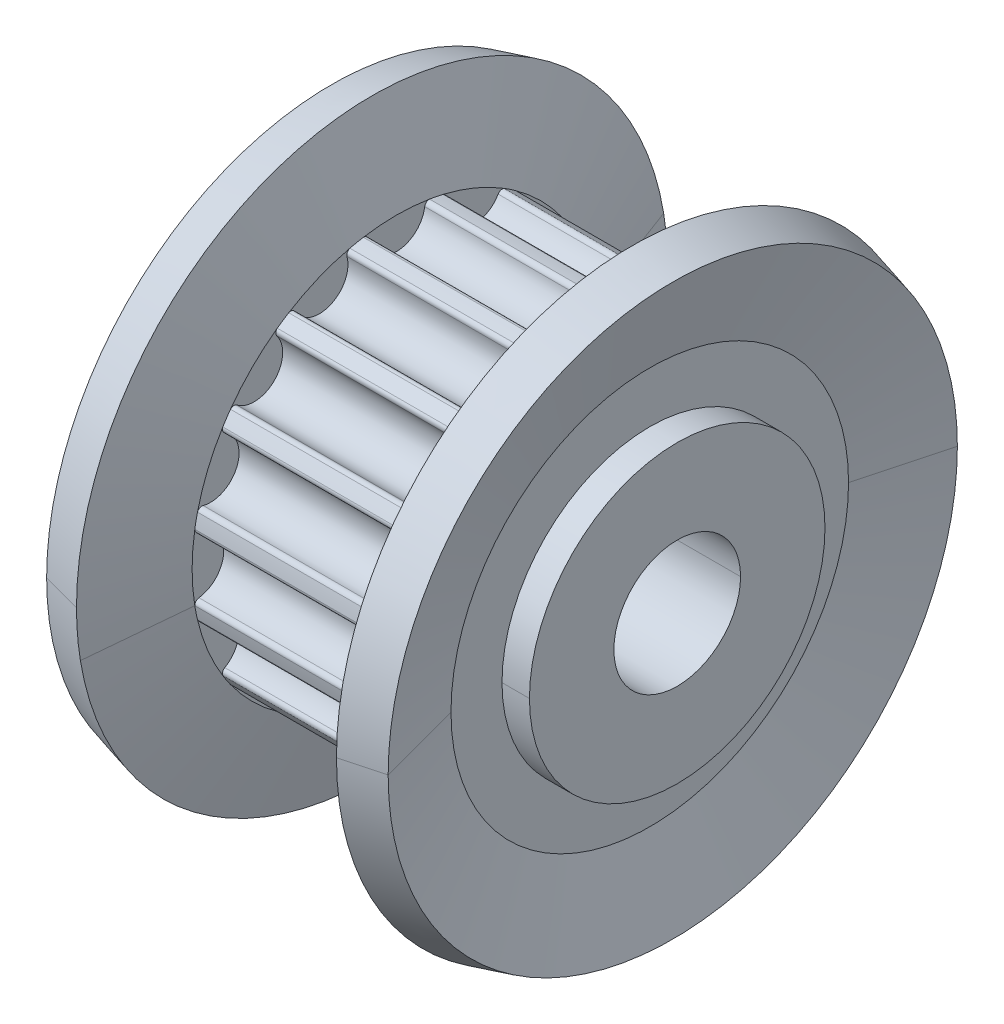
ISO-10303-21;
HEADER;
FILE_DESCRIPTION(('STEP AP214'),'2;1');
FILE_NAME('part.step','',(''),(''),'','','');
FILE_SCHEMA(('AUTOMOTIVE_DESIGN { 1 0 10303 214 1 1 1 1 }'));
ENDSEC;
DATA;
#1=APPLICATION_CONTEXT('core data for automotive mechanical design processes');
#2=APPLICATION_PROTOCOL_DEFINITION('international standard','automotive_design',2000,#1);
#3=PRODUCT_CONTEXT('',#1,'mechanical');
#4=PRODUCT('Part','Part','',(#3));
#5=PRODUCT_RELATED_PRODUCT_CATEGORY('part','',(#4));
#6=PRODUCT_DEFINITION_FORMATION('','',#4);
#7=PRODUCT_DEFINITION_CONTEXT('part definition',#1,'design');
#8=PRODUCT_DEFINITION('design','',#6,#7);
#9=PRODUCT_DEFINITION_SHAPE('','',#8);
#10=(LENGTH_UNIT() NAMED_UNIT(*) SI_UNIT(.MILLI.,.METRE.));
#11=(NAMED_UNIT(*) PLANE_ANGLE_UNIT() SI_UNIT($,.RADIAN.));
#12=(NAMED_UNIT(*) SI_UNIT($,.STERADIAN.) SOLID_ANGLE_UNIT());
#13=UNCERTAINTY_MEASURE_WITH_UNIT(LENGTH_MEASURE(1.E-05),#10,'distance_accuracy_value','');
#14=(GEOMETRIC_REPRESENTATION_CONTEXT(3) GLOBAL_UNCERTAINTY_ASSIGNED_CONTEXT((#13)) GLOBAL_UNIT_ASSIGNED_CONTEXT((#10,
#11,#12)) REPRESENTATION_CONTEXT('',''));
#15=CARTESIAN_POINT('',(0.,0.,0.));
#16=DIRECTION('',(0.,0.,1.));
#17=DIRECTION('',(1.,0.,0.));
#18=AXIS2_PLACEMENT_3D('',#15,#16,#17);
#19=CARTESIAN_POINT('',(4.15,3.5,0.));
#20=DIRECTION('',(-1.,0.,0.));
#21=DIRECTION('',(0.,0.,1.));
#22=AXIS2_PLACEMENT_3D('',#19,#20,#21);
#23=PLANE('',#22);
#24=CARTESIAN_POINT('',(4.15,0.,0.));
#25=DIRECTION('',(1.,0.,0.));
#26=DIRECTION('',(0.,0.,-1.));
#27=AXIS2_PLACEMENT_3D('',#24,#25,#26);
#28=CIRCLE('',#27,1.5);
#29=CARTESIAN_POINT('',(4.15,0.,-1.5));
#30=VERTEX_POINT('',#29);
#31=CARTESIAN_POINT('',(4.15,0.,1.5));
#32=VERTEX_POINT('',#31);
#33=EDGE_CURVE('E11',#30,#32,#28,.T.);
#34=ORIENTED_EDGE('',*,*,#33,.F.);
#35=CARTESIAN_POINT('',(4.15,0.,0.));
#36=DIRECTION('',(1.,0.,0.));
#37=DIRECTION('',(0.,0.,-1.));
#38=AXIS2_PLACEMENT_3D('',#35,#36,#37);
#39=CIRCLE('',#38,1.5);
#40=EDGE_CURVE('E25',#32,#30,#39,.T.);
#41=ORIENTED_EDGE('',*,*,#40,.F.);
#42=EDGE_LOOP('',(#34,#41));
#43=FACE_BOUND('',#42,.T.);
#44=CARTESIAN_POINT('',(4.15,0.,0.));
#45=DIRECTION('',(1.,0.,0.));
#46=DIRECTION('',(0.,0.,-1.));
#47=AXIS2_PLACEMENT_3D('',#44,#45,#46);
#48=CIRCLE('',#47,3.5);
#49=CARTESIAN_POINT('',(4.15,0.,-3.5));
#50=VERTEX_POINT('',#49);
#51=CARTESIAN_POINT('',(4.15,0.,3.5));
#52=VERTEX_POINT('',#51);
#53=EDGE_CURVE('E2030',#50,#52,#48,.T.);
#54=ORIENTED_EDGE('',*,*,#53,.T.);
#55=CARTESIAN_POINT('',(4.15,0.,0.));
#56=DIRECTION('',(1.,0.,0.));
#57=DIRECTION('',(0.,0.,-1.));
#58=AXIS2_PLACEMENT_3D('',#55,#56,#57);
#59=CIRCLE('',#58,3.5);
#60=EDGE_CURVE('E2026',#52,#50,#59,.T.);
#61=ORIENTED_EDGE('',*,*,#60,.T.);
#62=EDGE_LOOP('',(#54,#61));
#63=FACE_BOUND('',#62,.T.);
#64=ADVANCED_FACE('F17',(#43,#63),#23,.F.);
#65=CARTESIAN_POINT('',(4.15,0.,0.));
#66=DIRECTION('',(-1.,0.,0.));
#67=DIRECTION('',(0.,1.,0.));
#68=AXIS2_PLACEMENT_3D('',#65,#66,#67);
#69=CYLINDRICAL_SURFACE('',#68,3.5);
#70=CARTESIAN_POINT('',(3.5,0.,0.));
#71=DIRECTION('',(1.,0.,0.));
#72=DIRECTION('',(0.,0.,-1.));
#73=AXIS2_PLACEMENT_3D('',#70,#71,#72);
#74=CIRCLE('',#73,3.5);
#75=CARTESIAN_POINT('',(3.5,0.,3.5));
#76=VERTEX_POINT('',#75);
#77=CARTESIAN_POINT('',(3.5,0.,-3.5));
#78=VERTEX_POINT('',#77);
#79=EDGE_CURVE('E2024',#76,#78,#74,.T.);
#80=ORIENTED_EDGE('',*,*,#79,.T.);
#81=CARTESIAN_POINT('',(4.15,0.,-3.5));
#82=DIRECTION('',(-1.,0.,0.));
#83=VECTOR('',#82,1.);
#84=LINE('',#81,#83);
#85=EDGE_CURVE('E2001',#50,#78,#84,.T.);
#86=ORIENTED_EDGE('',*,*,#85,.F.);
#87=ORIENTED_EDGE('',*,*,#60,.F.);
#88=CARTESIAN_POINT('',(4.15,0.,3.5));
#89=DIRECTION('',(-1.,0.,0.));
#90=VECTOR('',#89,1.);
#91=LINE('',#88,#90);
#92=EDGE_CURVE('E2014',#52,#76,#91,.T.);
#93=ORIENTED_EDGE('',*,*,#92,.T.);
#94=EDGE_LOOP('',(#80,#86,#87,#93));
#95=FACE_BOUND('',#94,.T.);
#96=ADVANCED_FACE('F1981',(#95),#69,.T.);
#97=CARTESIAN_POINT('',(4.15,0.,0.));
#98=DIRECTION('',(-1.,0.,0.));
#99=DIRECTION('',(0.,-1.,0.));
#100=AXIS2_PLACEMENT_3D('',#97,#98,#99);
#101=CYLINDRICAL_SURFACE('',#100,3.5);
#102=ORIENTED_EDGE('',*,*,#53,.F.);
#103=ORIENTED_EDGE('',*,*,#85,.T.);
#104=CARTESIAN_POINT('',(3.5,0.,0.));
#105=DIRECTION('',(1.,0.,0.));
#106=DIRECTION('',(0.,0.,-1.));
#107=AXIS2_PLACEMENT_3D('',#104,#105,#106);
#108=CIRCLE('',#107,3.5);
#109=EDGE_CURVE('E1963',#78,#76,#108,.T.);
#110=ORIENTED_EDGE('',*,*,#109,.T.);
#111=ORIENTED_EDGE('',*,*,#92,.F.);
#112=EDGE_LOOP('',(#102,#103,#110,#111));
#113=FACE_BOUND('',#112,.T.);
#114=ADVANCED_FACE('F1972',(#113),#101,.T.);
#115=CARTESIAN_POINT('',(3.5,3.5,0.));
#116=DIRECTION('',(1.,0.,0.));
#117=DIRECTION('',(0.,0.,-1.));
#118=AXIS2_PLACEMENT_3D('',#115,#116,#117);
#119=PLANE('',#118);
#120=CARTESIAN_POINT('',(3.5,0.,0.));
#121=DIRECTION('',(1.,0.,0.));
#122=DIRECTION('',(0.,0.,-1.));
#123=AXIS2_PLACEMENT_3D('',#120,#121,#122);
#124=CIRCLE('',#123,4.7083475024);
#125=CARTESIAN_POINT('',(3.5,0.,-4.7083475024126));
#126=VERTEX_POINT('',#125);
#127=CARTESIAN_POINT('',(3.5,0.,4.7083475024));
#128=VERTEX_POINT('',#127);
#129=EDGE_CURVE('E1959',#126,#128,#124,.T.);
#130=ORIENTED_EDGE('',*,*,#129,.T.);
#131=CARTESIAN_POINT('',(3.5,0.,0.));
#132=DIRECTION('',(1.,0.,0.));
#133=DIRECTION('',(0.,0.,-1.));
#134=AXIS2_PLACEMENT_3D('',#131,#132,#133);
#135=CIRCLE('',#134,4.7083475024);
#136=EDGE_CURVE('E1957',#128,#126,#135,.T.);
#137=ORIENTED_EDGE('',*,*,#136,.T.);
#138=EDGE_LOOP('',(#130,#137));
#139=FACE_BOUND('',#138,.T.);
#140=ORIENTED_EDGE('',*,*,#109,.F.);
#141=ORIENTED_EDGE('',*,*,#79,.F.);
#142=EDGE_LOOP('',(#140,#141));
#143=FACE_BOUND('',#142,.T.);
#144=ADVANCED_FACE('F1980',(#139,#143),#119,.T.);
#145=CARTESIAN_POINT('',(3.5,0.,0.));
#146=DIRECTION('',(1.,0.,0.));
#147=DIRECTION('',(0.,1.,0.));
#148=AXIS2_PLACEMENT_3D('',#145,#146,#147);
#149=CONICAL_SURFACE('',#148,4.7083475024,1.308996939);
#150=ORIENTED_EDGE('',*,*,#136,.F.);
#151=CARTESIAN_POINT('',(3.5,0.,4.7083475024));
#152=DIRECTION('',(0.258819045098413,0.,0.965925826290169));
#153=VECTOR('',#152,1.);
#154=LINE('',#151,#153);
#155=CARTESIAN_POINT('',(4.04469608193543,0.,6.7411809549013));
#156=VERTEX_POINT('',#155);
#157=EDGE_CURVE('E1926',#128,#156,#154,.T.);
#158=ORIENTED_EDGE('',*,*,#157,.T.);
#159=CARTESIAN_POINT('',(4.0446960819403,0.,0.));
#160=DIRECTION('',(1.,0.,0.));
#161=DIRECTION('',(0.,0.,-1.));
#162=AXIS2_PLACEMENT_3D('',#159,#160,#161);
#163=CIRCLE('',#162,6.7411809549);
#164=CARTESIAN_POINT('',(4.0446960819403,0.,-6.7411809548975));
#165=VERTEX_POINT('',#164);
#166=EDGE_CURVE('E1944',#156,#165,#163,.T.);
#167=ORIENTED_EDGE('',*,*,#166,.T.);
#168=CARTESIAN_POINT('',(3.5,0.,-4.7083475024));
#169=DIRECTION('',(0.258819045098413,0.,-0.965925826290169));
#170=VECTOR('',#169,1.);
#171=LINE('',#168,#170);
#172=EDGE_CURVE('E1929',#126,#165,#171,.T.);
#173=ORIENTED_EDGE('',*,*,#172,.F.);
#174=EDGE_LOOP('',(#150,#158,#167,#173));
#175=FACE_BOUND('',#174,.T.);
#176=ADVANCED_FACE('F1909',(#175),#149,.F.);
#177=CARTESIAN_POINT('',(3.5,0.,0.));
#178=DIRECTION('',(1.,0.,0.));
#179=DIRECTION('',(0.,-1.,0.));
#180=AXIS2_PLACEMENT_3D('',#177,#178,#179);
#181=CONICAL_SURFACE('',#180,4.7083475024,1.308996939);
#182=CARTESIAN_POINT('',(4.0446960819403,0.,0.));
#183=DIRECTION('',(1.,0.,0.));
#184=DIRECTION('',(0.,0.,-1.));
#185=AXIS2_PLACEMENT_3D('',#182,#183,#184);
#186=CIRCLE('',#185,6.7411809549);
#187=EDGE_CURVE('E1927',#165,#156,#186,.T.);
#188=ORIENTED_EDGE('',*,*,#187,.T.);
#189=ORIENTED_EDGE('',*,*,#157,.F.);
#190=ORIENTED_EDGE('',*,*,#129,.F.);
#191=ORIENTED_EDGE('',*,*,#172,.T.);
#192=EDGE_LOOP('',(#188,#189,#190,#191));
#193=FACE_BOUND('',#192,.T.);
#194=ADVANCED_FACE('F1900',(#193),#181,.F.);
#195=CARTESIAN_POINT('',(4.0446960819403,0.,0.));
#196=DIRECTION('',(-1.,0.,0.));
#197=DIRECTION('',(0.,-1.,0.));
#198=AXIS2_PLACEMENT_3D('',#195,#196,#197);
#199=CONICAL_SURFACE('',#198,6.7411809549,0.2617993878);
#200=ORIENTED_EDGE('',*,*,#187,.F.);
#201=CARTESIAN_POINT('',(4.0446960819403,0.,-6.7411809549));
#202=DIRECTION('',(-0.965925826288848,0.,-0.258819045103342));
#203=VECTOR('',#202,1.);
#204=LINE('',#201,#203);
#205=CARTESIAN_POINT('',(3.0787702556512,0.,-7.));
#206=VERTEX_POINT('',#205);
#207=EDGE_CURVE('E1865',#165,#206,#204,.T.);
#208=ORIENTED_EDGE('',*,*,#207,.T.);
#209=CARTESIAN_POINT('',(3.0787702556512,0.,0.));
#210=DIRECTION('',(1.,0.,0.));
#211=DIRECTION('',(0.,0.,-1.));
#212=AXIS2_PLACEMENT_3D('',#209,#210,#211);
#213=CIRCLE('',#212,7.);
#214=CARTESIAN_POINT('',(3.0787702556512,0.,7.));
#215=VERTEX_POINT('',#214);
#216=EDGE_CURVE('E1882',#206,#215,#213,.T.);
#217=ORIENTED_EDGE('',*,*,#216,.T.);
#218=CARTESIAN_POINT('',(4.0446960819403,0.,6.7411809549));
#219=DIRECTION('',(-0.965925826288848,0.,0.258819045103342));
#220=VECTOR('',#219,1.);
#221=LINE('',#218,#220);
#222=EDGE_CURVE('E1867',#156,#215,#221,.T.);
#223=ORIENTED_EDGE('',*,*,#222,.F.);
#224=EDGE_LOOP('',(#200,#208,#217,#223));
#225=FACE_BOUND('',#224,.T.);
#226=ADVANCED_FACE('F1848',(#225),#199,.T.);
#227=CARTESIAN_POINT('',(4.0446960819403,0.,0.));
#228=DIRECTION('',(-1.,0.,0.));
#229=DIRECTION('',(0.,1.,0.));
#230=AXIS2_PLACEMENT_3D('',#227,#228,#229);
#231=CONICAL_SURFACE('',#230,6.7411809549,0.2617993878);
#232=CARTESIAN_POINT('',(3.0787702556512,0.,0.));
#233=DIRECTION('',(1.,0.,0.));
#234=DIRECTION('',(0.,0.,-1.));
#235=AXIS2_PLACEMENT_3D('',#232,#233,#234);
#236=CIRCLE('',#235,7.);
#237=EDGE_CURVE('E1831',#215,#206,#236,.T.);
#238=ORIENTED_EDGE('',*,*,#237,.T.);
#239=ORIENTED_EDGE('',*,*,#207,.F.);
#240=ORIENTED_EDGE('',*,*,#166,.F.);
#241=ORIENTED_EDGE('',*,*,#222,.T.);
#242=EDGE_LOOP('',(#238,#239,#240,#241));
#243=FACE_BOUND('',#242,.T.);
#244=ADVANCED_FACE('F1839',(#243),#231,.T.);
#245=CARTESIAN_POINT('',(3.0787702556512,0.,0.));
#246=DIRECTION('',(1.,0.,0.));
#247=DIRECTION('',(0.,1.,0.));
#248=AXIS2_PLACEMENT_3D('',#245,#246,#247);
#249=CONICAL_SURFACE('',#248,7.,1.308996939);
#250=CARTESIAN_POINT('',(2.5,0.,0.));
#251=DIRECTION('',(1.,0.,0.));
#252=DIRECTION('',(0.,0.,-1.));
#253=AXIS2_PLACEMENT_3D('',#250,#251,#252);
#254=CIRCLE('',#253,4.84);
#255=CARTESIAN_POINT('',(2.50000000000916,0.,4.83999999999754));
#256=VERTEX_POINT('',#255);
#257=CARTESIAN_POINT('',(2.5,-0.783796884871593,4.77611373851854));
#258=VERTEX_POINT('',#257);
#259=EDGE_CURVE('E1827',#256,#258,#254,.T.);
#260=ORIENTED_EDGE('',*,*,#259,.T.);
#261=CARTESIAN_POINT('',(2.5,0.,0.));
#262=DIRECTION('',(1.,0.,0.));
#263=DIRECTION('',(0.,0.,-1.));
#264=AXIS2_PLACEMENT_3D('',#261,#262,#263);
#265=CIRCLE('',#264,4.84);
#266=CARTESIAN_POINT('',(2.5,-1.10360569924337,4.71249981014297));
#267=VERTEX_POINT('',#266);
#268=EDGE_CURVE('E1823',#258,#267,#265,.T.);
#269=ORIENTED_EDGE('',*,*,#268,.T.);
#270=CARTESIAN_POINT('',(2.5,0.,0.));
#271=DIRECTION('',(1.,0.,0.));
#272=DIRECTION('',(0.,0.,-1.));
#273=AXIS2_PLACEMENT_3D('',#270,#271,#272);
#274=CIRCLE('',#273,4.84);
#275=CARTESIAN_POINT('',(2.5,-2.55187349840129,4.11260764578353));
#276=VERTEX_POINT('',#275);
#277=EDGE_CURVE('E1819',#267,#276,#274,.T.);
#278=ORIENTED_EDGE('',*,*,#277,.T.);
#279=CARTESIAN_POINT('',(2.5,0.,0.));
#280=DIRECTION('',(1.,0.,0.));
#281=DIRECTION('',(0.,0.,-1.));
#282=AXIS2_PLACEMENT_3D('',#279,#280,#281);
#283=CIRCLE('',#282,4.84);
#284=CARTESIAN_POINT('',(2.5,-2.82299431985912,3.93145050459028));
#285=VERTEX_POINT('',#284);
#286=EDGE_CURVE('E1815',#276,#285,#283,.T.);
#287=ORIENTED_EDGE('',*,*,#286,.T.);
#288=CARTESIAN_POINT('',(2.5,0.,0.));
#289=DIRECTION('',(1.,0.,0.));
#290=DIRECTION('',(0.,0.,-1.));
#291=AXIS2_PLACEMENT_3D('',#288,#289,#290);
#292=CIRCLE('',#291,4.84);
#293=CARTESIAN_POINT('',(2.5,-3.93145050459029,2.8229943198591));
#294=VERTEX_POINT('',#293);
#295=EDGE_CURVE('E1811',#285,#294,#292,.T.);
#296=ORIENTED_EDGE('',*,*,#295,.T.);
#297=CARTESIAN_POINT('',(2.5,0.,0.));
#298=DIRECTION('',(1.,0.,0.));
#299=DIRECTION('',(0.,0.,-1.));
#300=AXIS2_PLACEMENT_3D('',#297,#298,#299);
#301=CIRCLE('',#300,4.84);
#302=CARTESIAN_POINT('',(2.5,-4.11260764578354,2.55187349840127));
#303=VERTEX_POINT('',#302);
#304=EDGE_CURVE('E1807',#294,#303,#301,.T.);
#305=ORIENTED_EDGE('',*,*,#304,.T.);
#306=CARTESIAN_POINT('',(2.5,0.,0.));
#307=DIRECTION('',(1.,0.,0.));
#308=DIRECTION('',(0.,0.,-1.));
#309=AXIS2_PLACEMENT_3D('',#306,#307,#308);
#310=CIRCLE('',#309,4.84);
#311=CARTESIAN_POINT('',(2.5,-4.71249981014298,1.10360569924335));
#312=VERTEX_POINT('',#311);
#313=EDGE_CURVE('E1803',#303,#312,#310,.T.);
#314=ORIENTED_EDGE('',*,*,#313,.T.);
#315=CARTESIAN_POINT('',(2.5,0.,0.));
#316=DIRECTION('',(1.,0.,0.));
#317=DIRECTION('',(0.,0.,-1.));
#318=AXIS2_PLACEMENT_3D('',#315,#316,#317);
#319=CIRCLE('',#318,4.84);
#320=CARTESIAN_POINT('',(2.5,-4.77611373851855,0.783796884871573));
#321=VERTEX_POINT('',#320);
#322=EDGE_CURVE('E1799',#312,#321,#319,.T.);
#323=ORIENTED_EDGE('',*,*,#322,.T.);
#324=CARTESIAN_POINT('',(2.5,0.,0.));
#325=DIRECTION('',(1.,0.,0.));
#326=DIRECTION('',(0.,0.,-1.));
#327=AXIS2_PLACEMENT_3D('',#324,#325,#326);
#328=CIRCLE('',#327,4.84);
#329=CARTESIAN_POINT('',(2.5,-4.77611373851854,-0.783796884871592));
#330=VERTEX_POINT('',#329);
#331=EDGE_CURVE('E1795',#321,#330,#328,.T.);
#332=ORIENTED_EDGE('',*,*,#331,.T.);
#333=CARTESIAN_POINT('',(2.5,0.,0.));
#334=DIRECTION('',(1.,0.,0.));
#335=DIRECTION('',(0.,0.,-1.));
#336=AXIS2_PLACEMENT_3D('',#333,#334,#335);
#337=CIRCLE('',#336,4.84);
#338=CARTESIAN_POINT('',(2.5,-4.71249981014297,-1.10360569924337));
#339=VERTEX_POINT('',#338);
#340=EDGE_CURVE('E1791',#330,#339,#337,.T.);
#341=ORIENTED_EDGE('',*,*,#340,.T.);
#342=CARTESIAN_POINT('',(2.5,0.,0.));
#343=DIRECTION('',(1.,0.,0.));
#344=DIRECTION('',(0.,0.,-1.));
#345=AXIS2_PLACEMENT_3D('',#342,#343,#344);
#346=CIRCLE('',#345,4.84);
#347=CARTESIAN_POINT('',(2.5,-4.11260764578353,-2.55187349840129));
#348=VERTEX_POINT('',#347);
#349=EDGE_CURVE('E1787',#339,#348,#346,.T.);
#350=ORIENTED_EDGE('',*,*,#349,.T.);
#351=CARTESIAN_POINT('',(2.5,0.,0.));
#352=DIRECTION('',(1.,0.,0.));
#353=DIRECTION('',(0.,0.,-1.));
#354=AXIS2_PLACEMENT_3D('',#351,#352,#353);
#355=CIRCLE('',#354,4.84);
#356=CARTESIAN_POINT('',(2.5,-3.93145050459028,-2.82299431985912));
#357=VERTEX_POINT('',#356);
#358=EDGE_CURVE('E1783',#348,#357,#355,.T.);
#359=ORIENTED_EDGE('',*,*,#358,.T.);
#360=CARTESIAN_POINT('',(2.5,0.,0.));
#361=DIRECTION('',(1.,0.,0.));
#362=DIRECTION('',(0.,0.,-1.));
#363=AXIS2_PLACEMENT_3D('',#360,#361,#362);
#364=CIRCLE('',#363,4.84);
#365=CARTESIAN_POINT('',(2.5,-2.8229943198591,-3.93145050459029));
#366=VERTEX_POINT('',#365);
#367=EDGE_CURVE('E1779',#357,#366,#364,.T.);
#368=ORIENTED_EDGE('',*,*,#367,.T.);
#369=CARTESIAN_POINT('',(2.5,0.,0.));
#370=DIRECTION('',(1.,0.,0.));
#371=DIRECTION('',(0.,0.,-1.));
#372=AXIS2_PLACEMENT_3D('',#369,#370,#371);
#373=CIRCLE('',#372,4.84);
#374=CARTESIAN_POINT('',(2.5,-2.55187349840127,-4.11260764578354));
#375=VERTEX_POINT('',#374);
#376=EDGE_CURVE('E1775',#366,#375,#373,.T.);
#377=ORIENTED_EDGE('',*,*,#376,.T.);
#378=CARTESIAN_POINT('',(2.5,0.,0.));
#379=DIRECTION('',(1.,0.,0.));
#380=DIRECTION('',(0.,0.,-1.));
#381=AXIS2_PLACEMENT_3D('',#378,#379,#380);
#382=CIRCLE('',#381,4.84);
#383=CARTESIAN_POINT('',(2.5,-1.10360569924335,-4.71249981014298));
#384=VERTEX_POINT('',#383);
#385=EDGE_CURVE('E1771',#375,#384,#382,.T.);
#386=ORIENTED_EDGE('',*,*,#385,.T.);
#387=CARTESIAN_POINT('',(2.5,0.,0.));
#388=DIRECTION('',(1.,0.,0.));
#389=DIRECTION('',(0.,0.,-1.));
#390=AXIS2_PLACEMENT_3D('',#387,#388,#389);
#391=CIRCLE('',#390,4.84);
#392=CARTESIAN_POINT('',(2.5,-0.783796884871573,-4.77611373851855));
#393=VERTEX_POINT('',#392);
#394=EDGE_CURVE('E1767',#384,#393,#391,.T.);
#395=ORIENTED_EDGE('',*,*,#394,.T.);
#396=CARTESIAN_POINT('',(2.5,0.,0.));
#397=DIRECTION('',(1.,0.,0.));
#398=DIRECTION('',(0.,0.,-1.));
#399=AXIS2_PLACEMENT_3D('',#396,#397,#398);
#400=CIRCLE('',#399,4.84);
#401=CARTESIAN_POINT('',(2.50000000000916,0.,-4.83999999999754));
#402=VERTEX_POINT('',#401);
#403=EDGE_CURVE('E1765',#393,#402,#400,.T.);
#404=ORIENTED_EDGE('',*,*,#403,.T.);
#405=CARTESIAN_POINT('',(2.50000000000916,0.,-4.83999999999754));
#406=DIRECTION('',(0.258819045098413,0.,-0.965925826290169));
#407=VECTOR('',#406,1.);
#408=LINE('',#405,#407);
#409=EDGE_CURVE('E1741',#402,#206,#408,.T.);
#410=ORIENTED_EDGE('',*,*,#409,.T.);
#411=ORIENTED_EDGE('',*,*,#237,.F.);
#412=CARTESIAN_POINT('',(2.50000000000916,0.,4.83999999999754));
#413=DIRECTION('',(0.258819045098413,0.,0.965925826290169));
#414=VECTOR('',#413,1.);
#415=LINE('',#412,#414);
#416=EDGE_CURVE('E1754',#256,#215,#415,.T.);
#417=ORIENTED_EDGE('',*,*,#416,.F.);
#418=EDGE_LOOP('',(#260,#269,#278,#287,#296,#305,#314,#323,#332,#341,#350,#359,#368,#377,#386,
#395,#404,#410,#411,#417));
#419=FACE_BOUND('',#418,.T.);
#420=ADVANCED_FACE('F1719',(#419),#249,.T.);
#421=CARTESIAN_POINT('',(3.0787702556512,0.,0.));
#422=DIRECTION('',(1.,0.,0.));
#423=DIRECTION('',(0.,-1.,0.));
#424=AXIS2_PLACEMENT_3D('',#421,#422,#423);
#425=CONICAL_SURFACE('',#424,7.,1.308996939);
#426=ORIENTED_EDGE('',*,*,#216,.F.);
#427=ORIENTED_EDGE('',*,*,#409,.F.);
#428=CARTESIAN_POINT('',(2.5,0.,0.));
#429=DIRECTION('',(1.,0.,0.));
#430=DIRECTION('',(0.,0.,-1.));
#431=AXIS2_PLACEMENT_3D('',#428,#429,#430);
#432=CIRCLE('',#431,4.84);
#433=CARTESIAN_POINT('',(2.5,0.783796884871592,-4.77611373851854));
#434=VERTEX_POINT('',#433);
#435=EDGE_CURVE('E3517',#402,#434,#432,.T.);
#436=ORIENTED_EDGE('',*,*,#435,.T.);
#437=CARTESIAN_POINT('',(2.5,0.,0.));
#438=DIRECTION('',(1.,0.,0.));
#439=DIRECTION('',(0.,0.,-1.));
#440=AXIS2_PLACEMENT_3D('',#437,#438,#439);
#441=CIRCLE('',#440,4.84);
#442=CARTESIAN_POINT('',(2.5,1.10360569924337,-4.71249981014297));
#443=VERTEX_POINT('',#442);
#444=EDGE_CURVE('E3520',#434,#443,#441,.T.);
#445=ORIENTED_EDGE('',*,*,#444,.T.);
#446=CARTESIAN_POINT('',(2.5,0.,0.));
#447=DIRECTION('',(1.,0.,0.));
#448=DIRECTION('',(0.,0.,-1.));
#449=AXIS2_PLACEMENT_3D('',#446,#447,#448);
#450=CIRCLE('',#449,4.84);
#451=CARTESIAN_POINT('',(2.5,2.55187349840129,-4.11260764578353));
#452=VERTEX_POINT('',#451);
#453=EDGE_CURVE('E3521',#443,#452,#450,.T.);
#454=ORIENTED_EDGE('',*,*,#453,.T.);
#455=CARTESIAN_POINT('',(2.5,0.,0.));
#456=DIRECTION('',(1.,0.,0.));
#457=DIRECTION('',(0.,0.,-1.));
#458=AXIS2_PLACEMENT_3D('',#455,#456,#457);
#459=CIRCLE('',#458,4.84);
#460=CARTESIAN_POINT('',(2.5,2.82299431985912,-3.93145050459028));
#461=VERTEX_POINT('',#460);
#462=EDGE_CURVE('E3529',#452,#461,#459,.T.);
#463=ORIENTED_EDGE('',*,*,#462,.T.);
#464=CARTESIAN_POINT('',(2.5,0.,0.));
#465=DIRECTION('',(1.,0.,0.));
#466=DIRECTION('',(0.,0.,-1.));
#467=AXIS2_PLACEMENT_3D('',#464,#465,#466);
#468=CIRCLE('',#467,4.84);
#469=CARTESIAN_POINT('',(2.5,3.93145050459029,-2.8229943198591));
#470=VERTEX_POINT('',#469);
#471=EDGE_CURVE('E3533',#461,#470,#468,.T.);
#472=ORIENTED_EDGE('',*,*,#471,.T.);
#473=CARTESIAN_POINT('',(2.5,0.,0.));
#474=DIRECTION('',(1.,0.,0.));
#475=DIRECTION('',(0.,0.,-1.));
#476=AXIS2_PLACEMENT_3D('',#473,#474,#475);
#477=CIRCLE('',#476,4.84);
#478=CARTESIAN_POINT('',(2.5,4.11260764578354,-2.55187349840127));
#479=VERTEX_POINT('',#478);
#480=EDGE_CURVE('E3537',#470,#479,#477,.T.);
#481=ORIENTED_EDGE('',*,*,#480,.T.);
#482=CARTESIAN_POINT('',(2.5,0.,0.));
#483=DIRECTION('',(1.,0.,0.));
#484=DIRECTION('',(0.,0.,-1.));
#485=AXIS2_PLACEMENT_3D('',#482,#483,#484);
#486=CIRCLE('',#485,4.84);
#487=CARTESIAN_POINT('',(2.5,4.71249981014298,-1.10360569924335));
#488=VERTEX_POINT('',#487);
#489=EDGE_CURVE('E3541',#479,#488,#486,.T.);
#490=ORIENTED_EDGE('',*,*,#489,.T.);
#491=CARTESIAN_POINT('',(2.5,0.,0.));
#492=DIRECTION('',(1.,0.,0.));
#493=DIRECTION('',(0.,0.,-1.));
#494=AXIS2_PLACEMENT_3D('',#491,#492,#493);
#495=CIRCLE('',#494,4.84);
#496=CARTESIAN_POINT('',(2.5,4.77611373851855,-0.783796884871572));
#497=VERTEX_POINT('',#496);
#498=EDGE_CURVE('E3545',#488,#497,#495,.T.);
#499=ORIENTED_EDGE('',*,*,#498,.T.);
#500=CARTESIAN_POINT('',(2.5,0.,0.));
#501=DIRECTION('',(1.,0.,0.));
#502=DIRECTION('',(0.,0.,-1.));
#503=AXIS2_PLACEMENT_3D('',#500,#501,#502);
#504=CIRCLE('',#503,4.84);
#505=CARTESIAN_POINT('',(2.5,4.77611373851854,0.783796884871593));
#506=VERTEX_POINT('',#505);
#507=EDGE_CURVE('E3549',#497,#506,#504,.T.);
#508=ORIENTED_EDGE('',*,*,#507,.T.);
#509=CARTESIAN_POINT('',(2.5,0.,0.));
#510=DIRECTION('',(1.,0.,0.));
#511=DIRECTION('',(0.,0.,-1.));
#512=AXIS2_PLACEMENT_3D('',#509,#510,#511);
#513=CIRCLE('',#512,4.84);
#514=CARTESIAN_POINT('',(2.5,4.71249981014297,1.10360569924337));
#515=VERTEX_POINT('',#514);
#516=EDGE_CURVE('E3553',#506,#515,#513,.T.);
#517=ORIENTED_EDGE('',*,*,#516,.T.);
#518=CARTESIAN_POINT('',(2.5,0.,0.));
#519=DIRECTION('',(1.,0.,0.));
#520=DIRECTION('',(0.,0.,-1.));
#521=AXIS2_PLACEMENT_3D('',#518,#519,#520);
#522=CIRCLE('',#521,4.84);
#523=CARTESIAN_POINT('',(2.5,4.11260764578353,2.55187349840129));
#524=VERTEX_POINT('',#523);
#525=EDGE_CURVE('E3557',#515,#524,#522,.T.);
#526=ORIENTED_EDGE('',*,*,#525,.T.);
#527=CARTESIAN_POINT('',(2.5,0.,0.));
#528=DIRECTION('',(1.,0.,0.));
#529=DIRECTION('',(0.,0.,-1.));
#530=AXIS2_PLACEMENT_3D('',#527,#528,#529);
#531=CIRCLE('',#530,4.84);
#532=CARTESIAN_POINT('',(2.5,3.93145050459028,2.82299431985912));
#533=VERTEX_POINT('',#532);
#534=EDGE_CURVE('E3561',#524,#533,#531,.T.);
#535=ORIENTED_EDGE('',*,*,#534,.T.);
#536=CARTESIAN_POINT('',(2.5,0.,0.));
#537=DIRECTION('',(1.,0.,0.));
#538=DIRECTION('',(0.,0.,-1.));
#539=AXIS2_PLACEMENT_3D('',#536,#537,#538);
#540=CIRCLE('',#539,4.84);
#541=CARTESIAN_POINT('',(2.5,2.8229943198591,3.93145050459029));
#542=VERTEX_POINT('',#541);
#543=EDGE_CURVE('E3565',#533,#542,#540,.T.);
#544=ORIENTED_EDGE('',*,*,#543,.T.);
#545=CARTESIAN_POINT('',(2.5,0.,0.));
#546=DIRECTION('',(1.,0.,0.));
#547=DIRECTION('',(0.,0.,-1.));
#548=AXIS2_PLACEMENT_3D('',#545,#546,#547);
#549=CIRCLE('',#548,4.84);
#550=CARTESIAN_POINT('',(2.5,2.55187349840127,4.11260764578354));
#551=VERTEX_POINT('',#550);
#552=EDGE_CURVE('E3569',#542,#551,#549,.T.);
#553=ORIENTED_EDGE('',*,*,#552,.T.);
#554=CARTESIAN_POINT('',(2.5,0.,0.));
#555=DIRECTION('',(1.,0.,0.));
#556=DIRECTION('',(0.,0.,-1.));
#557=AXIS2_PLACEMENT_3D('',#554,#555,#556);
#558=CIRCLE('',#557,4.84);
#559=CARTESIAN_POINT('',(2.5,1.10360569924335,4.71249981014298));
#560=VERTEX_POINT('',#559);
#561=EDGE_CURVE('E3573',#551,#560,#558,.T.);
#562=ORIENTED_EDGE('',*,*,#561,.T.);
#563=CARTESIAN_POINT('',(2.5,0.,0.));
#564=DIRECTION('',(1.,0.,0.));
#565=DIRECTION('',(0.,0.,-1.));
#566=AXIS2_PLACEMENT_3D('',#563,#564,#565);
#567=CIRCLE('',#566,4.84);
#568=CARTESIAN_POINT('',(2.5,0.783796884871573,4.77611373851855));
#569=VERTEX_POINT('',#568);
#570=EDGE_CURVE('E3438',#560,#569,#567,.T.);
#571=ORIENTED_EDGE('',*,*,#570,.T.);
#572=CARTESIAN_POINT('',(2.5,0.,0.));
#573=DIRECTION('',(1.,0.,0.));
#574=DIRECTION('',(0.,0.,-1.));
#575=AXIS2_PLACEMENT_3D('',#572,#573,#574);
#576=CIRCLE('',#575,4.84);
#577=EDGE_CURVE('E1699',#569,#256,#576,.T.);
#578=ORIENTED_EDGE('',*,*,#577,.T.);
#579=ORIENTED_EDGE('',*,*,#416,.T.);
#580=EDGE_LOOP('',(#426,#427,#436,#445,#454,#463,#472,#481,#490,#499,#508,#517,#526,#535,#544,
#553,#562,#571,#578,#579));
#581=FACE_BOUND('',#580,.T.);
#582=ADVANCED_FACE('F1708',(#581),#425,.T.);
#583=CARTESIAN_POINT('',(2.5,4.84,0.));
#584=DIRECTION('',(-1.,0.,0.));
#585=DIRECTION('',(0.,0.,1.));
#586=AXIS2_PLACEMENT_3D('',#583,#584,#585);
#587=PLANE('',#586);
#588=CARTESIAN_POINT('',(2.5,-0.780383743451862,4.66416575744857));
#589=DIRECTION('',(1.,0.,0.));
#590=DIRECTION('',(0.,1.,0.));
#591=AXIS2_PLACEMENT_3D('',#588,#589,#590);
#592=CIRCLE('',#591,0.112);
#593=CARTESIAN_POINT('',(2.5,-0.66932531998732,4.6786580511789));
#594=VERTEX_POINT('',#593);
#595=EDGE_CURVE('E1694',#594,#258,#592,.T.);
#596=ORIENTED_EDGE('',*,*,#595,.T.);
#597=ORIENTED_EDGE('',*,*,#259,.F.);
#598=ORIENTED_EDGE('',*,*,#577,.F.);
#599=CARTESIAN_POINT('',(2.5,0.780383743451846,4.6641657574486));
#600=DIRECTION('',(1.,0.,0.));
#601=DIRECTION('',(0.,1.,0.));
#602=AXIS2_PLACEMENT_3D('',#599,#600,#601);
#603=CIRCLE('',#602,0.112);
#604=CARTESIAN_POINT('',(2.5,0.66932532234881,4.6786580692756));
#605=VERTEX_POINT('',#604);
#606=EDGE_CURVE('E1690',#569,#605,#603,.T.);
#607=ORIENTED_EDGE('',*,*,#606,.T.);
#608=CARTESIAN_POINT('',(2.5,0.,4.766));
#609=DIRECTION('',(1.,0.,0.));
#610=DIRECTION('',(0.,1.,0.));
#611=AXIS2_PLACEMENT_3D('',#608,#609,#610);
#612=CIRCLE('',#611,0.675);
#613=EDGE_CURVE('E1685',#594,#605,#612,.T.);
#614=ORIENTED_EDGE('',*,*,#613,.F.);
#615=EDGE_LOOP('',(#596,#597,#598,#607,#614));
#616=FACE_BOUND('',#615,.T.);
#617=ADVANCED_FACE('F1718',(#616),#587,.T.);
#618=CARTESIAN_POINT('',(2.5,0.,4.766));
#619=DIRECTION('',(1.,0.,0.));
#620=DIRECTION('',(0.,-1.3518613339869E-08,1.));
#621=AXIS2_PLACEMENT_3D('',#618,#619,#620);
#622=CYLINDRICAL_SURFACE('',#621,0.675);
#623=DIRECTION('',(-1.,0.,0.));
#624=VECTOR('',#623,1.);
#625=CARTESIAN_POINT('',(2.5,0.66932532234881,4.6786580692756));
#626=LINE('',#625,#624);
#627=CARTESIAN_POINT('',(-2.5,0.66932532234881,4.6786580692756));
#628=VERTEX_POINT('',#627);
#629=EDGE_CURVE('E1681',#605,#628,#626,.T.);
#630=ORIENTED_EDGE('',*,*,#629,.T.);
#631=CARTESIAN_POINT('',(-2.5,0.,4.766));
#632=DIRECTION('',(1.,0.,0.));
#633=DIRECTION('',(0.,1.,0.));
#634=AXIS2_PLACEMENT_3D('',#631,#632,#633);
#635=CIRCLE('',#634,0.675);
#636=CARTESIAN_POINT('',(-2.5,-0.669325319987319,4.6786580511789));
#637=VERTEX_POINT('',#636);
#638=EDGE_CURVE('E1676',#637,#628,#635,.T.);
#639=ORIENTED_EDGE('',*,*,#638,.F.);
#640=DIRECTION('',(-1.,0.,0.));
#641=VECTOR('',#640,1.);
#642=CARTESIAN_POINT('',(2.5,-0.669325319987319,4.6786580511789));
#643=LINE('',#642,#641);
#644=EDGE_CURVE('E1671',#594,#637,#643,.T.);
#645=ORIENTED_EDGE('',*,*,#644,.F.);
#646=ORIENTED_EDGE('',*,*,#613,.T.);
#647=EDGE_LOOP('',(#630,#639,#645,#646));
#648=FACE_BOUND('',#647,.T.);
#649=ADVANCED_FACE('F2113',(#648),#622,.F.);
#650=CARTESIAN_POINT('',(2.5,-0.780383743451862,4.66416575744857));
#651=DIRECTION('',(1.,0.,0.));
#652=DIRECTION('',(0.,-0.648246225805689,-0.761430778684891));
#653=AXIS2_PLACEMENT_3D('',#650,#651,#652);
#654=CYLINDRICAL_SURFACE('',#653,0.112);
#655=ORIENTED_EDGE('',*,*,#595,.F.);
#656=ORIENTED_EDGE('',*,*,#644,.T.);
#657=CARTESIAN_POINT('',(-2.5,-0.780383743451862,4.66416575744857));
#658=DIRECTION('',(1.,0.,0.));
#659=DIRECTION('',(0.,1.,0.));
#660=AXIS2_PLACEMENT_3D('',#657,#658,#659);
#661=CIRCLE('',#660,0.112);
#662=CARTESIAN_POINT('',(-2.5,-0.783796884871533,4.77611373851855));
#663=VERTEX_POINT('',#662);
#664=EDGE_CURVE('E1667',#637,#663,#661,.T.);
#665=ORIENTED_EDGE('',*,*,#664,.T.);
#666=DIRECTION('',(-1.,0.,0.));
#667=VECTOR('',#666,1.);
#668=CARTESIAN_POINT('',(0.,-0.783796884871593,4.77611373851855));
#669=LINE('',#668,#667);
#670=EDGE_CURVE('E1662',#258,#663,#669,.T.);
#671=ORIENTED_EDGE('',*,*,#670,.F.);
#672=EDGE_LOOP('',(#655,#656,#665,#671));
#673=FACE_BOUND('',#672,.T.);
#674=ADVANCED_FACE('F2122',(#673),#654,.T.);
#675=CARTESIAN_POINT('',(4.15,0.,0.));
#676=DIRECTION('',(-1.,0.,0.));
#677=DIRECTION('',(0.,0.195090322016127,-0.980785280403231));
#678=AXIS2_PLACEMENT_3D('',#675,#676,#677);
#679=CYLINDRICAL_SURFACE('',#678,4.84);
#680=CARTESIAN_POINT('',(-2.5,0.,0.));
#681=DIRECTION('',(1.,0.,0.));
#682=DIRECTION('',(0.,0.,-1.));
#683=AXIS2_PLACEMENT_3D('',#680,#681,#682);
#684=CIRCLE('',#683,4.84);
#685=CARTESIAN_POINT('',(-2.5,-1.10360569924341,4.71249981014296));
#686=VERTEX_POINT('',#685);
#687=EDGE_CURVE('E1658',#663,#686,#684,.T.);
#688=ORIENTED_EDGE('',*,*,#687,.T.);
#689=DIRECTION('',(-1.,0.,0.));
#690=VECTOR('',#689,1.);
#691=CARTESIAN_POINT('',(0.,-1.10360569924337,4.71249981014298));
#692=LINE('',#691,#690);
#693=EDGE_CURVE('E1653',#267,#686,#692,.T.);
#694=ORIENTED_EDGE('',*,*,#693,.F.);
#695=ORIENTED_EDGE('',*,*,#268,.F.);
#696=ORIENTED_EDGE('',*,*,#670,.T.);
#697=EDGE_LOOP('',(#688,#694,#695,#696));
#698=FACE_BOUND('',#697,.T.);
#699=ADVANCED_FACE('F2131',(#698),#679,.T.);
#700=CARTESIAN_POINT('',(2.5,-1.06391839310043,4.60776720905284));
#701=DIRECTION('',(1.,0.,0.));
#702=DIRECTION('',(0.,0.890288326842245,-0.45539729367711));
#703=AXIS2_PLACEMENT_3D('',#700,#701,#702);
#704=CYLINDRICAL_SURFACE('',#703,0.112);
#705=CARTESIAN_POINT('',(-2.5,-1.06391839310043,4.60776720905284));
#706=DIRECTION('',(1.,0.,0.));
#707=DIRECTION('',(0.,0.923879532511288,0.382683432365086));
#708=AXIS2_PLACEMENT_3D('',#705,#706,#707);
#709=CIRCLE('',#708,0.112);
#710=CARTESIAN_POINT('',(-2.5,-1.17206896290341,4.57865614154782));
#711=VERTEX_POINT('',#710);
#712=EDGE_CURVE('E1649',#686,#711,#709,.T.);
#713=ORIENTED_EDGE('',*,*,#712,.T.);
#714=DIRECTION('',(-1.,0.,0.));
#715=VECTOR('',#714,1.);
#716=CARTESIAN_POINT('',(2.5,-1.17206896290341,4.57865614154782));
#717=LINE('',#716,#715);
#718=CARTESIAN_POINT('',(2.5,-1.17206896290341,4.57865614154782));
#719=VERTEX_POINT('',#718);
#720=EDGE_CURVE('E1644',#719,#711,#717,.T.);
#721=ORIENTED_EDGE('',*,*,#720,.F.);
#722=CARTESIAN_POINT('',(2.5,-1.06391839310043,4.60776720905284));
#723=DIRECTION('',(1.,0.,0.));
#724=DIRECTION('',(0.,0.923879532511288,0.382683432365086));
#725=AXIS2_PLACEMENT_3D('',#722,#723,#724);
#726=CIRCLE('',#725,0.112);
#727=EDGE_CURVE('E1639',#267,#719,#726,.T.);
#728=ORIENTED_EDGE('',*,*,#727,.F.);
#729=ORIENTED_EDGE('',*,*,#693,.T.);
#730=EDGE_LOOP('',(#713,#721,#728,#729));
#731=FACE_BOUND('',#730,.T.);
#732=ADVANCED_FACE('F2141',(#731),#704,.T.);
#733=CARTESIAN_POINT('',(2.5,4.84,0.));
#734=DIRECTION('',(-1.,0.,0.));
#735=DIRECTION('',(0.,0.,1.));
#736=AXIS2_PLACEMENT_3D('',#733,#734,#735);
#737=PLANE('',#736);
#738=CARTESIAN_POINT('',(2.5,-2.50587952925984,4.01048735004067));
#739=DIRECTION('',(1.,0.,0.));
#740=DIRECTION('',(0.,0.923879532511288,0.382683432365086));
#741=AXIS2_PLACEMENT_3D('',#738,#739,#740);
#742=CIRCLE('',#741,0.112);
#743=CARTESIAN_POINT('',(2.5,-2.40882088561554,4.06637670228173));
#744=VERTEX_POINT('',#743);
#745=EDGE_CURVE('E1634',#744,#276,#742,.T.);
#746=ORIENTED_EDGE('',*,*,#745,.T.);
#747=ORIENTED_EDGE('',*,*,#277,.F.);
#748=ORIENTED_EDGE('',*,*,#727,.T.);
#749=CARTESIAN_POINT('',(2.5,-1.823869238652,4.4032098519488));
#750=DIRECTION('',(1.,0.,0.));
#751=DIRECTION('',(0.,0.923879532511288,0.382683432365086));
#752=AXIS2_PLACEMENT_3D('',#749,#750,#751);
#753=CIRCLE('',#752,0.675);
#754=EDGE_CURVE('E1629',#744,#719,#753,.T.);
#755=ORIENTED_EDGE('',*,*,#754,.F.);
#756=EDGE_LOOP('',(#746,#747,#748,#755));
#757=FACE_BOUND('',#756,.T.);
#758=ADVANCED_FACE('F2151',(#757),#737,.T.);
#759=CARTESIAN_POINT('',(2.5,-1.823869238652,4.4032098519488));
#760=DIRECTION('',(1.,0.,0.));
#761=DIRECTION('',(0.,-0.382683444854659,0.923879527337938));
#762=AXIS2_PLACEMENT_3D('',#759,#760,#761);
#763=CYLINDRICAL_SURFACE('',#762,0.675);
#764=ORIENTED_EDGE('',*,*,#720,.T.);
#765=CARTESIAN_POINT('',(-2.5,-1.823869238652,4.4032098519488));
#766=DIRECTION('',(1.,0.,0.));
#767=DIRECTION('',(0.,0.923879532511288,0.382683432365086));
#768=AXIS2_PLACEMENT_3D('',#765,#766,#767);
#769=CIRCLE('',#768,0.675);
#770=CARTESIAN_POINT('',(-2.5,-2.40882088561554,4.06637670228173));
#771=VERTEX_POINT('',#770);
#772=EDGE_CURVE('E1624',#771,#711,#769,.T.);
#773=ORIENTED_EDGE('',*,*,#772,.F.);
#774=DIRECTION('',(-1.,0.,0.));
#775=VECTOR('',#774,1.);
#776=CARTESIAN_POINT('',(2.5,-2.40882088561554,4.06637670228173));
#777=LINE('',#776,#775);
#778=EDGE_CURVE('E1619',#744,#771,#777,.T.);
#779=ORIENTED_EDGE('',*,*,#778,.F.);
#780=ORIENTED_EDGE('',*,*,#754,.T.);
#781=EDGE_LOOP('',(#764,#773,#779,#780));
#782=FACE_BOUND('',#781,.T.);
#783=ADVANCED_FACE('F2161',(#782),#763,.F.);
#784=CARTESIAN_POINT('',(2.5,-2.50587952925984,4.01048735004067));
#785=DIRECTION('',(1.,0.,0.));
#786=DIRECTION('',(0.,-0.307514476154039,-0.951543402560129));
#787=AXIS2_PLACEMENT_3D('',#784,#785,#786);
#788=CYLINDRICAL_SURFACE('',#787,0.112);
#789=ORIENTED_EDGE('',*,*,#745,.F.);
#790=ORIENTED_EDGE('',*,*,#778,.T.);
#791=CARTESIAN_POINT('',(-2.5,-2.50587952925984,4.01048735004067));
#792=DIRECTION('',(1.,0.,0.));
#793=DIRECTION('',(0.,0.923879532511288,0.382683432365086));
#794=AXIS2_PLACEMENT_3D('',#791,#792,#793);
#795=CIRCLE('',#794,0.112);
#796=CARTESIAN_POINT('',(-2.5,-2.55187349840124,4.11260764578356));
#797=VERTEX_POINT('',#796);
#798=EDGE_CURVE('E1615',#771,#797,#795,.T.);
#799=ORIENTED_EDGE('',*,*,#798,.T.);
#800=DIRECTION('',(-1.,0.,0.));
#801=VECTOR('',#800,1.);
#802=CARTESIAN_POINT('',(0.,-2.55187349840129,4.11260764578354));
#803=LINE('',#802,#801);
#804=EDGE_CURVE('E1610',#276,#797,#803,.T.);
#805=ORIENTED_EDGE('',*,*,#804,.F.);
#806=EDGE_LOOP('',(#789,#790,#799,#805));
#807=FACE_BOUND('',#806,.T.);
#808=ADVANCED_FACE('F2171',(#807),#788,.T.);
#809=CARTESIAN_POINT('',(4.15,0.,0.));
#810=DIRECTION('',(-1.,0.,0.));
#811=DIRECTION('',(0.,0.555570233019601,-0.831469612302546));
#812=AXIS2_PLACEMENT_3D('',#809,#810,#811);
#813=CYLINDRICAL_SURFACE('',#812,4.84);
#814=CARTESIAN_POINT('',(-2.5,0.,0.));
#815=DIRECTION('',(1.,0.,0.));
#816=DIRECTION('',(0.,0.,-1.));
#817=AXIS2_PLACEMENT_3D('',#814,#815,#816);
#818=CIRCLE('',#817,4.84);
#819=CARTESIAN_POINT('',(-2.5,-2.82299431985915,3.93145050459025));
#820=VERTEX_POINT('',#819);
#821=EDGE_CURVE('E1606',#797,#820,#818,.T.);
#822=ORIENTED_EDGE('',*,*,#821,.T.);
#823=DIRECTION('',(-1.,0.,0.));
#824=VECTOR('',#823,1.);
#825=CARTESIAN_POINT('',(0.,-2.82299431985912,3.93145050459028));
#826=LINE('',#825,#824);
#827=EDGE_CURVE('E1601',#285,#820,#826,.T.);
#828=ORIENTED_EDGE('',*,*,#827,.F.);
#829=ORIENTED_EDGE('',*,*,#286,.F.);
#830=ORIENTED_EDGE('',*,*,#804,.T.);
#831=EDGE_LOOP('',(#822,#828,#829,#830));
#832=FACE_BOUND('',#831,.T.);
#833=ADVANCED_FACE('F2181',(#832),#813,.T.);
#834=CARTESIAN_POINT('',(2.5,-2.74624859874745,3.84987787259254));
#835=DIRECTION('',(1.,0.,0.));
#836=DIRECTION('',(0.,0.996792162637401,-0.0800336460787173));
#837=AXIS2_PLACEMENT_3D('',#834,#835,#836);
#838=CYLINDRICAL_SURFACE('',#837,0.112);
#839=CARTESIAN_POINT('',(-2.5,-2.74624859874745,3.84987787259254));
#840=DIRECTION('',(1.,0.,0.));
#841=DIRECTION('',(0.,0.707106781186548,0.707106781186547));
#842=AXIS2_PLACEMENT_3D('',#839,#840,#841);
#843=CIRCLE('',#842,0.112);
#844=CARTESIAN_POINT('',(-2.5,-2.83502637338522,3.78159532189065));
#845=VERTEX_POINT('',#844);
#846=EDGE_CURVE('E1597',#820,#845,#843,.T.);
#847=ORIENTED_EDGE('',*,*,#846,.T.);
#848=DIRECTION('',(-1.,0.,0.));
#849=VECTOR('',#848,1.);
#850=CARTESIAN_POINT('',(2.5,-2.83502637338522,3.78159532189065));
#851=LINE('',#850,#849);
#852=CARTESIAN_POINT('',(2.5,-2.83502637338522,3.78159532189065));
#853=VERTEX_POINT('',#852);
#854=EDGE_CURVE('E1592',#853,#845,#851,.T.);
#855=ORIENTED_EDGE('',*,*,#854,.F.);
#856=CARTESIAN_POINT('',(2.5,-2.74624859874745,3.84987787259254));
#857=DIRECTION('',(1.,0.,0.));
#858=DIRECTION('',(0.,0.707106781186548,0.707106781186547));
#859=AXIS2_PLACEMENT_3D('',#856,#857,#858);
#860=CIRCLE('',#859,0.112);
#861=EDGE_CURVE('E1587',#285,#853,#860,.T.);
#862=ORIENTED_EDGE('',*,*,#861,.F.);
#863=ORIENTED_EDGE('',*,*,#827,.T.);
#864=EDGE_LOOP('',(#847,#855,#862,#863));
#865=FACE_BOUND('',#864,.T.);
#866=ADVANCED_FACE('F2191',(#865),#838,.T.);
#867=CARTESIAN_POINT('',(2.5,4.84,0.));
#868=DIRECTION('',(-1.,0.,0.));
#869=DIRECTION('',(0.,0.,1.));
#870=AXIS2_PLACEMENT_3D('',#867,#868,#869);
#871=PLANE('',#870);
#872=CARTESIAN_POINT('',(2.5,-3.84987787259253,2.74624859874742));
#873=DIRECTION('',(1.,0.,0.));
#874=DIRECTION('',(0.,0.707106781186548,0.707106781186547));
#875=AXIS2_PLACEMENT_3D('',#872,#873,#874);
#876=CIRCLE('',#875,0.112);
#877=CARTESIAN_POINT('',(2.5,-3.78159530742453,2.83502636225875));
#878=VERTEX_POINT('',#877);
#879=EDGE_CURVE('E1582',#878,#294,#876,.T.);
#880=ORIENTED_EDGE('',*,*,#879,.T.);
#881=ORIENTED_EDGE('',*,*,#295,.F.);
#882=ORIENTED_EDGE('',*,*,#861,.T.);
#883=CARTESIAN_POINT('',(2.5,-3.37007091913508,3.37007091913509));
#884=DIRECTION('',(1.,0.,0.));
#885=DIRECTION('',(0.,0.707106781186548,0.707106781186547));
#886=AXIS2_PLACEMENT_3D('',#883,#884,#885);
#887=CIRCLE('',#886,0.675);
#888=EDGE_CURVE('E1577',#878,#853,#887,.T.);
#889=ORIENTED_EDGE('',*,*,#888,.F.);
#890=EDGE_LOOP('',(#880,#881,#882,#889));
#891=FACE_BOUND('',#890,.T.);
#892=ADVANCED_FACE('F2201',(#891),#871,.T.);
#893=CARTESIAN_POINT('',(2.5,-3.37007091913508,3.37007091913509));
#894=DIRECTION('',(1.,0.,0.));
#895=DIRECTION('',(0.,-0.707106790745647,0.707106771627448));
#896=AXIS2_PLACEMENT_3D('',#893,#894,#895);
#897=CYLINDRICAL_SURFACE('',#896,0.675);
#898=ORIENTED_EDGE('',*,*,#854,.T.);
#899=CARTESIAN_POINT('',(-2.5,-3.37007091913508,3.37007091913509));
#900=DIRECTION('',(1.,0.,0.));
#901=DIRECTION('',(0.,0.707106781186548,0.707106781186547));
#902=AXIS2_PLACEMENT_3D('',#899,#900,#901);
#903=CIRCLE('',#902,0.675);
#904=CARTESIAN_POINT('',(-2.5,-3.78159530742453,2.83502636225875));
#905=VERTEX_POINT('',#904);
#906=EDGE_CURVE('E1572',#905,#845,#903,.T.);
#907=ORIENTED_EDGE('',*,*,#906,.F.);
#908=DIRECTION('',(-1.,0.,0.));
#909=VECTOR('',#908,1.);
#910=CARTESIAN_POINT('',(2.5,-3.78159530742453,2.83502636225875));
#911=LINE('',#910,#909);
#912=EDGE_CURVE('E1567',#878,#905,#911,.T.);
#913=ORIENTED_EDGE('',*,*,#912,.F.);
#914=ORIENTED_EDGE('',*,*,#888,.T.);
#915=EDGE_LOOP('',(#898,#907,#913,#914));
#916=FACE_BOUND('',#915,.T.);
#917=ADVANCED_FACE('F2211',(#916),#897,.F.);
#918=CARTESIAN_POINT('',(2.5,-3.84987787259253,2.74624859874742));
#919=DIRECTION('',(1.,0.,0.));
#920=DIRECTION('',(0.,0.080033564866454,-0.996792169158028));
#921=AXIS2_PLACEMENT_3D('',#918,#919,#920);
#922=CYLINDRICAL_SURFACE('',#921,0.112);
#923=ORIENTED_EDGE('',*,*,#879,.F.);
#924=ORIENTED_EDGE('',*,*,#912,.T.);
#925=CARTESIAN_POINT('',(-2.5,-3.84987787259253,2.74624859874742));
#926=DIRECTION('',(1.,0.,0.));
#927=DIRECTION('',(0.,0.707106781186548,0.707106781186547));
#928=AXIS2_PLACEMENT_3D('',#925,#926,#927);
#929=CIRCLE('',#928,0.112);
#930=CARTESIAN_POINT('',(-2.5,-3.93145050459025,2.82299431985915));
#931=VERTEX_POINT('',#930);
#932=EDGE_CURVE('E1563',#905,#931,#929,.T.);
#933=ORIENTED_EDGE('',*,*,#932,.T.);
#934=DIRECTION('',(-1.,0.,0.));
#935=VECTOR('',#934,1.);
#936=CARTESIAN_POINT('',(0.,-3.9314505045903,2.82299431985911));
#937=LINE('',#936,#935);
#938=EDGE_CURVE('E1558',#294,#931,#937,.T.);
#939=ORIENTED_EDGE('',*,*,#938,.F.);
#940=EDGE_LOOP('',(#923,#924,#933,#939));
#941=FACE_BOUND('',#940,.T.);
#942=ADVANCED_FACE('F2221',(#941),#922,.T.);
#943=CARTESIAN_POINT('',(4.15,0.,0.));
#944=DIRECTION('',(-1.,0.,0.));
#945=DIRECTION('',(0.,0.831469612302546,-0.555570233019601));
#946=AXIS2_PLACEMENT_3D('',#943,#944,#945);
#947=CYLINDRICAL_SURFACE('',#946,4.84);
#948=ORIENTED_EDGE('',*,*,#304,.F.);
#949=ORIENTED_EDGE('',*,*,#938,.T.);
#950=CARTESIAN_POINT('',(-2.5,0.,0.));
#951=DIRECTION('',(1.,0.,0.));
#952=DIRECTION('',(0.,0.,-1.));
#953=AXIS2_PLACEMENT_3D('',#950,#951,#952);
#954=CIRCLE('',#953,4.84);
#955=CARTESIAN_POINT('',(-2.5,-4.11260764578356,2.55187349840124));
#956=VERTEX_POINT('',#955);
#957=EDGE_CURVE('E1554',#931,#956,#954,.T.);
#958=ORIENTED_EDGE('',*,*,#957,.T.);
#959=DIRECTION('',(-1.,0.,0.));
#960=VECTOR('',#959,1.);
#961=CARTESIAN_POINT('',(0.,-4.11260764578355,2.55187349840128));
#962=LINE('',#961,#960);
#963=EDGE_CURVE('E1549',#303,#956,#962,.T.);
#964=ORIENTED_EDGE('',*,*,#963,.F.);
#965=EDGE_LOOP('',(#948,#949,#958,#964));
#966=FACE_BOUND('',#965,.T.);
#967=ADVANCED_FACE('F2231',(#966),#947,.T.);
#968=CARTESIAN_POINT('',(2.5,-4.0104873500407,2.50587952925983));
#969=DIRECTION('',(1.,0.,0.));
#970=DIRECTION('',(0.,0.951543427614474,0.307514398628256));
#971=AXIS2_PLACEMENT_3D('',#968,#969,#970);
#972=CYLINDRICAL_SURFACE('',#971,0.112);
#973=CARTESIAN_POINT('',(-2.5,-4.0104873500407,2.50587952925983));
#974=DIRECTION('',(1.,0.,0.));
#975=DIRECTION('',(0.,0.382683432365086,0.923879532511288));
#976=AXIS2_PLACEMENT_3D('',#973,#974,#975);
#977=CIRCLE('',#976,0.112);
#978=CARTESIAN_POINT('',(-2.5,-4.0663767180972,2.40882089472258));
#979=VERTEX_POINT('',#978);
#980=EDGE_CURVE('E1545',#956,#979,#977,.T.);
#981=ORIENTED_EDGE('',*,*,#980,.T.);
#982=DIRECTION('',(-1.,0.,0.));
#983=VECTOR('',#982,1.);
#984=CARTESIAN_POINT('',(2.5,-4.0663767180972,2.40882089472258));
#985=LINE('',#984,#983);
#986=CARTESIAN_POINT('',(2.5,-4.0663767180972,2.40882089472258));
#987=VERTEX_POINT('',#986);
#988=EDGE_CURVE('E1540',#987,#979,#985,.T.);
#989=ORIENTED_EDGE('',*,*,#988,.F.);
#990=CARTESIAN_POINT('',(2.5,-4.0104873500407,2.50587952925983));
#991=DIRECTION('',(1.,0.,0.));
#992=DIRECTION('',(0.,0.382683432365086,0.923879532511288));
#993=AXIS2_PLACEMENT_3D('',#990,#991,#992);
#994=CIRCLE('',#993,0.112);
#995=EDGE_CURVE('E1535',#303,#987,#994,.T.);
#996=ORIENTED_EDGE('',*,*,#995,.F.);
#997=ORIENTED_EDGE('',*,*,#963,.T.);
#998=EDGE_LOOP('',(#981,#989,#996,#997));
#999=FACE_BOUND('',#998,.T.);
#1000=ADVANCED_FACE('F2241',(#999),#972,.T.);
#1001=CARTESIAN_POINT('',(2.5,4.84,0.));
#1002=DIRECTION('',(-1.,0.,0.));
#1003=DIRECTION('',(0.,0.,1.));
#1004=AXIS2_PLACEMENT_3D('',#1001,#1002,#1003);
#1005=PLANE('',#1004);
#1006=CARTESIAN_POINT('',(2.5,-4.60776720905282,1.06391839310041));
#1007=DIRECTION('',(1.,0.,0.));
#1008=DIRECTION('',(0.,0.382683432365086,0.923879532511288));
#1009=AXIS2_PLACEMENT_3D('',#1006,#1007,#1008);
#1010=CIRCLE('',#1009,0.112);
#1011=CARTESIAN_POINT('',(2.5,-4.57865612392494,1.17206895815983));
#1012=VERTEX_POINT('',#1011);
#1013=EDGE_CURVE('E1530',#1012,#312,#1010,.T.);
#1014=ORIENTED_EDGE('',*,*,#1013,.T.);
#1015=ORIENTED_EDGE('',*,*,#313,.F.);
#1016=ORIENTED_EDGE('',*,*,#995,.T.);
#1017=CARTESIAN_POINT('',(2.5,-4.4032098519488,1.823869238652));
#1018=DIRECTION('',(1.,0.,0.));
#1019=DIRECTION('',(0.,0.382683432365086,0.923879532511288));
#1020=AXIS2_PLACEMENT_3D('',#1017,#1018,#1019);
#1021=CIRCLE('',#1020,0.675);
#1022=EDGE_CURVE('E1525',#1012,#987,#1021,.T.);
#1023=ORIENTED_EDGE('',*,*,#1022,.F.);
#1024=EDGE_LOOP('',(#1014,#1015,#1016,#1023));
#1025=FACE_BOUND('',#1024,.T.);
#1026=ADVANCED_FACE('F2251',(#1025),#1005,.T.);
#1027=CARTESIAN_POINT('',(2.5,-4.4032098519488,1.823869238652));
#1028=DIRECTION('',(1.,0.,0.));
#1029=DIRECTION('',(0.,-0.92387953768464,0.382683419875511));
#1030=AXIS2_PLACEMENT_3D('',#1027,#1028,#1029);
#1031=CYLINDRICAL_SURFACE('',#1030,0.675);
#1032=ORIENTED_EDGE('',*,*,#988,.T.);
#1033=CARTESIAN_POINT('',(-2.5,-4.4032098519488,1.823869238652));
#1034=DIRECTION('',(1.,0.,0.));
#1035=DIRECTION('',(0.,0.382683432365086,0.923879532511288));
#1036=AXIS2_PLACEMENT_3D('',#1033,#1034,#1035);
#1037=CIRCLE('',#1036,0.675);
#1038=CARTESIAN_POINT('',(-2.5,-4.57865612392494,1.17206895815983));
#1039=VERTEX_POINT('',#1038);
#1040=EDGE_CURVE('E1520',#1039,#979,#1037,.T.);
#1041=ORIENTED_EDGE('',*,*,#1040,.F.);
#1042=DIRECTION('',(-1.,0.,0.));
#1043=VECTOR('',#1042,1.);
#1044=CARTESIAN_POINT('',(2.5,-4.57865612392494,1.17206895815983));
#1045=LINE('',#1044,#1043);
#1046=EDGE_CURVE('E1515',#1012,#1039,#1045,.T.);
#1047=ORIENTED_EDGE('',*,*,#1046,.F.);
#1048=ORIENTED_EDGE('',*,*,#1022,.T.);
#1049=EDGE_LOOP('',(#1032,#1041,#1047,#1048));
#1050=FACE_BOUND('',#1049,.T.);
#1051=ADVANCED_FACE('F2261',(#1050),#1031,.F.);
#1052=CARTESIAN_POINT('',(2.5,-4.60776720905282,1.06391839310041));
#1053=DIRECTION('',(1.,0.,0.));
#1054=DIRECTION('',(0.,0.45539722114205,-0.890288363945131));
#1055=AXIS2_PLACEMENT_3D('',#1052,#1053,#1054);
#1056=CYLINDRICAL_SURFACE('',#1055,0.112);
#1057=ORIENTED_EDGE('',*,*,#1013,.F.);
#1058=ORIENTED_EDGE('',*,*,#1046,.T.);
#1059=CARTESIAN_POINT('',(-2.5,-4.60776720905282,1.06391839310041));
#1060=DIRECTION('',(1.,0.,0.));
#1061=DIRECTION('',(0.,0.382683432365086,0.923879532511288));
#1062=AXIS2_PLACEMENT_3D('',#1059,#1060,#1061);
#1063=CIRCLE('',#1062,0.112);
#1064=CARTESIAN_POINT('',(-2.5,-4.71249981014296,1.10360569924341));
#1065=VERTEX_POINT('',#1064);
#1066=EDGE_CURVE('E1511',#1039,#1065,#1063,.T.);
#1067=ORIENTED_EDGE('',*,*,#1066,.T.);
#1068=DIRECTION('',(-1.,0.,0.));
#1069=VECTOR('',#1068,1.);
#1070=CARTESIAN_POINT('',(0.,-4.71249981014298,1.10360569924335));
#1071=LINE('',#1070,#1069);
#1072=EDGE_CURVE('E1506',#312,#1065,#1071,.T.);
#1073=ORIENTED_EDGE('',*,*,#1072,.F.);
#1074=EDGE_LOOP('',(#1057,#1058,#1067,#1073));
#1075=FACE_BOUND('',#1074,.T.);
#1076=ADVANCED_FACE('F2271',(#1075),#1056,.T.);
#1077=CARTESIAN_POINT('',(4.15,0.,0.));
#1078=DIRECTION('',(-1.,0.,0.));
#1079=DIRECTION('',(0.,0.980785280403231,-0.195090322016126));
#1080=AXIS2_PLACEMENT_3D('',#1077,#1078,#1079);
#1081=CYLINDRICAL_SURFACE('',#1080,4.84);
#1082=CARTESIAN_POINT('',(-2.5,0.,0.));
#1083=DIRECTION('',(1.,0.,0.));
#1084=DIRECTION('',(0.,0.,-1.));
#1085=AXIS2_PLACEMENT_3D('',#1082,#1083,#1084);
#1086=CIRCLE('',#1085,4.84);
#1087=CARTESIAN_POINT('',(-2.5,-4.77611373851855,0.783796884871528));
#1088=VERTEX_POINT('',#1087);
#1089=EDGE_CURVE('E1502',#1065,#1088,#1086,.T.);
#1090=ORIENTED_EDGE('',*,*,#1089,.T.);
#1091=DIRECTION('',(-1.,0.,0.));
#1092=VECTOR('',#1091,1.);
#1093=CARTESIAN_POINT('',(0.,-4.77611373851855,0.783796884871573));
#1094=LINE('',#1093,#1092);
#1095=EDGE_CURVE('E1497',#321,#1088,#1094,.T.);
#1096=ORIENTED_EDGE('',*,*,#1095,.F.);
#1097=ORIENTED_EDGE('',*,*,#322,.F.);
#1098=ORIENTED_EDGE('',*,*,#1072,.T.);
#1099=EDGE_LOOP('',(#1090,#1096,#1097,#1098));
#1100=FACE_BOUND('',#1099,.T.);
#1101=ADVANCED_FACE('F2281',(#1100),#1081,.T.);
#1102=CARTESIAN_POINT('',(2.5,-4.6641657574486,0.780383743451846));
#1103=DIRECTION('',(1.,0.,0.));
#1104=DIRECTION('',(0.,0.761430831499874,0.648246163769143));
#1105=AXIS2_PLACEMENT_3D('',#1102,#1103,#1104);
#1106=CYLINDRICAL_SURFACE('',#1105,0.112);
#1107=CARTESIAN_POINT('',(-2.5,-4.6641657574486,0.780383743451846));
#1108=DIRECTION('',(1.,0.,0.));
#1109=DIRECTION('',(0.,0.,1.));
#1110=AXIS2_PLACEMENT_3D('',#1107,#1108,#1109);
#1111=CIRCLE('',#1110,0.112);
#1112=CARTESIAN_POINT('',(-2.5,-4.6786580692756,0.66932532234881));
#1113=VERTEX_POINT('',#1112);
#1114=EDGE_CURVE('E1493',#1088,#1113,#1111,.T.);
#1115=ORIENTED_EDGE('',*,*,#1114,.T.);
#1116=DIRECTION('',(-1.,0.,0.));
#1117=VECTOR('',#1116,1.);
#1118=CARTESIAN_POINT('',(2.5,-4.6786580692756,0.66932532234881));
#1119=LINE('',#1118,#1117);
#1120=CARTESIAN_POINT('',(2.5,-4.6786580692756,0.66932532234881));
#1121=VERTEX_POINT('',#1120);
#1122=EDGE_CURVE('E1488',#1121,#1113,#1119,.T.);
#1123=ORIENTED_EDGE('',*,*,#1122,.F.);
#1124=CARTESIAN_POINT('',(2.5,-4.6641657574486,0.780383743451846));
#1125=DIRECTION('',(1.,0.,0.));
#1126=DIRECTION('',(0.,0.,1.));
#1127=AXIS2_PLACEMENT_3D('',#1124,#1125,#1126);
#1128=CIRCLE('',#1127,0.112);
#1129=EDGE_CURVE('E1483',#321,#1121,#1128,.T.);
#1130=ORIENTED_EDGE('',*,*,#1129,.F.);
#1131=ORIENTED_EDGE('',*,*,#1095,.T.);
#1132=EDGE_LOOP('',(#1115,#1123,#1130,#1131));
#1133=FACE_BOUND('',#1132,.T.);
#1134=ADVANCED_FACE('F2291',(#1133),#1106,.T.);
#1135=CARTESIAN_POINT('',(2.5,4.84,0.));
#1136=DIRECTION('',(-1.,0.,0.));
#1137=DIRECTION('',(0.,0.,1.));
#1138=AXIS2_PLACEMENT_3D('',#1135,#1136,#1137);
#1139=PLANE('',#1138);
#1140=CARTESIAN_POINT('',(2.5,-4.66416575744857,-0.780383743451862));
#1141=DIRECTION('',(1.,0.,0.));
#1142=DIRECTION('',(0.,0.,1.));
#1143=AXIS2_PLACEMENT_3D('',#1140,#1141,#1142);
#1144=CIRCLE('',#1143,0.112);
#1145=CARTESIAN_POINT('',(2.5,-4.6786580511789,-0.66932531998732));
#1146=VERTEX_POINT('',#1145);
#1147=EDGE_CURVE('E1478',#1146,#330,#1144,.T.);
#1148=ORIENTED_EDGE('',*,*,#1147,.T.);
#1149=ORIENTED_EDGE('',*,*,#331,.F.);
#1150=ORIENTED_EDGE('',*,*,#1129,.T.);
#1151=CARTESIAN_POINT('',(2.5,-4.766,0.));
#1152=DIRECTION('',(1.,0.,0.));
#1153=DIRECTION('',(0.,0.,1.));
#1154=AXIS2_PLACEMENT_3D('',#1151,#1152,#1153);
#1155=CIRCLE('',#1154,0.675);
#1156=EDGE_CURVE('E1473',#1146,#1121,#1155,.T.);
#1157=ORIENTED_EDGE('',*,*,#1156,.F.);
#1158=EDGE_LOOP('',(#1148,#1149,#1150,#1157));
#1159=FACE_BOUND('',#1158,.T.);
#1160=ADVANCED_FACE('F2301',(#1159),#1139,.T.);
#1161=CARTESIAN_POINT('',(2.5,-4.766,0.));
#1162=DIRECTION('',(1.,0.,0.));
#1163=DIRECTION('',(0.,-1.,-1.35186132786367E-08));
#1164=AXIS2_PLACEMENT_3D('',#1161,#1162,#1163);
#1165=CYLINDRICAL_SURFACE('',#1164,0.675);
#1166=ORIENTED_EDGE('',*,*,#1122,.T.);
#1167=CARTESIAN_POINT('',(-2.5,-4.766,0.));
#1168=DIRECTION('',(1.,0.,0.));
#1169=DIRECTION('',(0.,0.,1.));
#1170=AXIS2_PLACEMENT_3D('',#1167,#1168,#1169);
#1171=CIRCLE('',#1170,0.675);
#1172=CARTESIAN_POINT('',(-2.5,-4.6786580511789,-0.669325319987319));
#1173=VERTEX_POINT('',#1172);
#1174=EDGE_CURVE('E1468',#1173,#1113,#1171,.T.);
#1175=ORIENTED_EDGE('',*,*,#1174,.F.);
#1176=DIRECTION('',(-1.,0.,0.));
#1177=VECTOR('',#1176,1.);
#1178=CARTESIAN_POINT('',(2.5,-4.6786580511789,-0.669325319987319));
#1179=LINE('',#1178,#1177);
#1180=EDGE_CURVE('E1463',#1146,#1173,#1179,.T.);
#1181=ORIENTED_EDGE('',*,*,#1180,.F.);
#1182=ORIENTED_EDGE('',*,*,#1156,.T.);
#1183=EDGE_LOOP('',(#1166,#1175,#1181,#1182));
#1184=FACE_BOUND('',#1183,.T.);
#1185=ADVANCED_FACE('F2311',(#1184),#1165,.F.);
#1186=CARTESIAN_POINT('',(2.5,-4.66416575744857,-0.780383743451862));
#1187=DIRECTION('',(1.,0.,0.));
#1188=DIRECTION('',(0.,0.761430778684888,-0.648246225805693));
#1189=AXIS2_PLACEMENT_3D('',#1186,#1187,#1188);
#1190=CYLINDRICAL_SURFACE('',#1189,0.112);
#1191=ORIENTED_EDGE('',*,*,#1147,.F.);
#1192=ORIENTED_EDGE('',*,*,#1180,.T.);
#1193=CARTESIAN_POINT('',(-2.5,-4.66416575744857,-0.780383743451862));
#1194=DIRECTION('',(1.,0.,0.));
#1195=DIRECTION('',(0.,0.,1.));
#1196=AXIS2_PLACEMENT_3D('',#1193,#1194,#1195);
#1197=CIRCLE('',#1196,0.112);
#1198=CARTESIAN_POINT('',(-2.5,-4.77611373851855,-0.783796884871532));
#1199=VERTEX_POINT('',#1198);
#1200=EDGE_CURVE('E1459',#1173,#1199,#1197,.T.);
#1201=ORIENTED_EDGE('',*,*,#1200,.T.);
#1202=DIRECTION('',(-1.,0.,0.));
#1203=VECTOR('',#1202,1.);
#1204=CARTESIAN_POINT('',(0.,-4.77611373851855,-0.783796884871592));
#1205=LINE('',#1204,#1203);
#1206=EDGE_CURVE('E1454',#330,#1199,#1205,.T.);
#1207=ORIENTED_EDGE('',*,*,#1206,.F.);
#1208=EDGE_LOOP('',(#1191,#1192,#1201,#1207));
#1209=FACE_BOUND('',#1208,.T.);
#1210=ADVANCED_FACE('F2321',(#1209),#1190,.T.);
#1211=CARTESIAN_POINT('',(4.15,0.,0.));
#1212=DIRECTION('',(-1.,0.,0.));
#1213=DIRECTION('',(0.,0.980785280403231,0.195090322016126));
#1214=AXIS2_PLACEMENT_3D('',#1211,#1212,#1213);
#1215=CYLINDRICAL_SURFACE('',#1214,4.84);
#1216=CARTESIAN_POINT('',(-2.5,0.,0.));
#1217=DIRECTION('',(1.,0.,0.));
#1218=DIRECTION('',(0.,0.,-1.));
#1219=AXIS2_PLACEMENT_3D('',#1216,#1217,#1218);
#1220=CIRCLE('',#1219,4.84);
#1221=CARTESIAN_POINT('',(-2.5,-4.71249981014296,-1.10360569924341));
#1222=VERTEX_POINT('',#1221);
#1223=EDGE_CURVE('E1450',#1199,#1222,#1220,.T.);
#1224=ORIENTED_EDGE('',*,*,#1223,.T.);
#1225=DIRECTION('',(-1.,0.,0.));
#1226=VECTOR('',#1225,1.);
#1227=CARTESIAN_POINT('',(0.,-4.71249981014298,-1.10360569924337));
#1228=LINE('',#1227,#1226);
#1229=EDGE_CURVE('E1445',#339,#1222,#1228,.T.);
#1230=ORIENTED_EDGE('',*,*,#1229,.F.);
#1231=ORIENTED_EDGE('',*,*,#340,.F.);
#1232=ORIENTED_EDGE('',*,*,#1206,.T.);
#1233=EDGE_LOOP('',(#1224,#1230,#1231,#1232));
#1234=FACE_BOUND('',#1233,.T.);
#1235=ADVANCED_FACE('F2331',(#1234),#1215,.T.);
#1236=CARTESIAN_POINT('',(2.5,-4.60776720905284,-1.06391839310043));
#1237=DIRECTION('',(1.,0.,0.));
#1238=DIRECTION('',(0.,0.45539729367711,0.890288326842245));
#1239=AXIS2_PLACEMENT_3D('',#1236,#1237,#1238);
#1240=CYLINDRICAL_SURFACE('',#1239,0.112);
#1241=CARTESIAN_POINT('',(-2.5,-4.60776720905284,-1.06391839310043));
#1242=DIRECTION('',(1.,0.,0.));
#1243=DIRECTION('',(0.,-0.382683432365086,0.923879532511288));
#1244=AXIS2_PLACEMENT_3D('',#1241,#1242,#1243);
#1245=CIRCLE('',#1244,0.112);
#1246=CARTESIAN_POINT('',(-2.5,-4.57865614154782,-1.17206896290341));
#1247=VERTEX_POINT('',#1246);
#1248=EDGE_CURVE('E1441',#1222,#1247,#1245,.T.);
#1249=ORIENTED_EDGE('',*,*,#1248,.T.);
#1250=DIRECTION('',(-1.,0.,0.));
#1251=VECTOR('',#1250,1.);
#1252=CARTESIAN_POINT('',(2.5,-4.57865614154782,-1.17206896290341));
#1253=LINE('',#1252,#1251);
#1254=CARTESIAN_POINT('',(2.5,-4.57865614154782,-1.17206896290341));
#1255=VERTEX_POINT('',#1254);
#1256=EDGE_CURVE('E1436',#1255,#1247,#1253,.T.);
#1257=ORIENTED_EDGE('',*,*,#1256,.F.);
#1258=CARTESIAN_POINT('',(2.5,-4.60776720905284,-1.06391839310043));
#1259=DIRECTION('',(1.,0.,0.));
#1260=DIRECTION('',(0.,-0.382683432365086,0.923879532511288));
#1261=AXIS2_PLACEMENT_3D('',#1258,#1259,#1260);
#1262=CIRCLE('',#1261,0.112);
#1263=EDGE_CURVE('E1431',#339,#1255,#1262,.T.);
#1264=ORIENTED_EDGE('',*,*,#1263,.F.);
#1265=ORIENTED_EDGE('',*,*,#1229,.T.);
#1266=EDGE_LOOP('',(#1249,#1257,#1264,#1265));
#1267=FACE_BOUND('',#1266,.T.);
#1268=ADVANCED_FACE('F2341',(#1267),#1240,.T.);
#1269=CARTESIAN_POINT('',(2.5,4.84,0.));
#1270=DIRECTION('',(-1.,0.,0.));
#1271=DIRECTION('',(0.,0.,1.));
#1272=AXIS2_PLACEMENT_3D('',#1269,#1270,#1271);
#1273=PLANE('',#1272);
#1274=CARTESIAN_POINT('',(2.5,-4.01048735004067,-2.50587952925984));
#1275=DIRECTION('',(1.,0.,0.));
#1276=DIRECTION('',(0.,-0.382683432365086,0.923879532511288));
#1277=AXIS2_PLACEMENT_3D('',#1274,#1275,#1276);
#1278=CIRCLE('',#1277,0.112);
#1279=CARTESIAN_POINT('',(2.5,-4.06637670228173,-2.40882088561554));
#1280=VERTEX_POINT('',#1279);
#1281=EDGE_CURVE('E1426',#1280,#348,#1278,.T.);
#1282=ORIENTED_EDGE('',*,*,#1281,.T.);
#1283=ORIENTED_EDGE('',*,*,#349,.F.);
#1284=ORIENTED_EDGE('',*,*,#1263,.T.);
#1285=CARTESIAN_POINT('',(2.5,-4.4032098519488,-1.823869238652));
#1286=DIRECTION('',(1.,0.,0.));
#1287=DIRECTION('',(0.,-0.382683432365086,0.923879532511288));
#1288=AXIS2_PLACEMENT_3D('',#1285,#1286,#1287);
#1289=CIRCLE('',#1288,0.675);
#1290=EDGE_CURVE('E1421',#1280,#1255,#1289,.T.);
#1291=ORIENTED_EDGE('',*,*,#1290,.F.);
#1292=EDGE_LOOP('',(#1282,#1283,#1284,#1291));
#1293=FACE_BOUND('',#1292,.T.);
#1294=ADVANCED_FACE('F2351',(#1293),#1273,.T.);
#1295=CARTESIAN_POINT('',(2.5,-4.4032098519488,-1.823869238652));
#1296=DIRECTION('',(1.,0.,0.));
#1297=DIRECTION('',(0.,-0.923879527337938,-0.382683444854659));
#1298=AXIS2_PLACEMENT_3D('',#1295,#1296,#1297);
#1299=CYLINDRICAL_SURFACE('',#1298,0.675);
#1300=ORIENTED_EDGE('',*,*,#1256,.T.);
#1301=CARTESIAN_POINT('',(-2.5,-4.4032098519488,-1.823869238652));
#1302=DIRECTION('',(1.,0.,0.));
#1303=DIRECTION('',(0.,-0.382683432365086,0.923879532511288));
#1304=AXIS2_PLACEMENT_3D('',#1301,#1302,#1303);
#1305=CIRCLE('',#1304,0.675);
#1306=CARTESIAN_POINT('',(-2.5,-4.06637670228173,-2.40882088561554));
#1307=VERTEX_POINT('',#1306);
#1308=EDGE_CURVE('E1416',#1307,#1247,#1305,.T.);
#1309=ORIENTED_EDGE('',*,*,#1308,.F.);
#1310=DIRECTION('',(-1.,0.,0.));
#1311=VECTOR('',#1310,1.);
#1312=CARTESIAN_POINT('',(2.5,-4.06637670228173,-2.40882088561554));
#1313=LINE('',#1312,#1311);
#1314=EDGE_CURVE('E1411',#1280,#1307,#1313,.T.);
#1315=ORIENTED_EDGE('',*,*,#1314,.F.);
#1316=ORIENTED_EDGE('',*,*,#1290,.T.);
#1317=EDGE_LOOP('',(#1300,#1309,#1315,#1316));
#1318=FACE_BOUND('',#1317,.T.);
#1319=ADVANCED_FACE('F2361',(#1318),#1299,.F.);
#1320=CARTESIAN_POINT('',(2.5,-4.01048735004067,-2.50587952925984));
#1321=DIRECTION('',(1.,0.,0.));
#1322=DIRECTION('',(0.,0.951543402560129,-0.307514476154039));
#1323=AXIS2_PLACEMENT_3D('',#1320,#1321,#1322);
#1324=CYLINDRICAL_SURFACE('',#1323,0.112);
#1325=ORIENTED_EDGE('',*,*,#1281,.F.);
#1326=ORIENTED_EDGE('',*,*,#1314,.T.);
#1327=CARTESIAN_POINT('',(-2.5,-4.01048735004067,-2.50587952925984));
#1328=DIRECTION('',(1.,0.,0.));
#1329=DIRECTION('',(0.,-0.382683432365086,0.923879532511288));
#1330=AXIS2_PLACEMENT_3D('',#1327,#1328,#1329);
#1331=CIRCLE('',#1330,0.112);
#1332=CARTESIAN_POINT('',(-2.5,-4.11260764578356,-2.55187349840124));
#1333=VERTEX_POINT('',#1332);
#1334=EDGE_CURVE('E1407',#1307,#1333,#1331,.T.);
#1335=ORIENTED_EDGE('',*,*,#1334,.T.);
#1336=DIRECTION('',(-1.,0.,0.));
#1337=VECTOR('',#1336,1.);
#1338=CARTESIAN_POINT('',(0.,-4.11260764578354,-2.55187349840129));
#1339=LINE('',#1338,#1337);
#1340=EDGE_CURVE('E1402',#348,#1333,#1339,.T.);
#1341=ORIENTED_EDGE('',*,*,#1340,.F.);
#1342=EDGE_LOOP('',(#1325,#1326,#1335,#1341));
#1343=FACE_BOUND('',#1342,.T.);
#1344=ADVANCED_FACE('F2371',(#1343),#1324,.T.);
#1345=CARTESIAN_POINT('',(4.15,0.,0.));
#1346=DIRECTION('',(-1.,0.,0.));
#1347=DIRECTION('',(0.,0.831469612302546,0.555570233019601));
#1348=AXIS2_PLACEMENT_3D('',#1345,#1346,#1347);
#1349=CYLINDRICAL_SURFACE('',#1348,4.84);
#1350=ORIENTED_EDGE('',*,*,#358,.F.);
#1351=ORIENTED_EDGE('',*,*,#1340,.T.);
#1352=CARTESIAN_POINT('',(-2.5,0.,0.));
#1353=DIRECTION('',(1.,0.,0.));
#1354=DIRECTION('',(0.,0.,-1.));
#1355=AXIS2_PLACEMENT_3D('',#1352,#1353,#1354);
#1356=CIRCLE('',#1355,4.84);
#1357=CARTESIAN_POINT('',(-2.5,-3.93145050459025,-2.82299431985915));
#1358=VERTEX_POINT('',#1357);
#1359=EDGE_CURVE('E1398',#1333,#1358,#1356,.T.);
#1360=ORIENTED_EDGE('',*,*,#1359,.T.);
#1361=DIRECTION('',(-1.,0.,0.));
#1362=VECTOR('',#1361,1.);
#1363=CARTESIAN_POINT('',(0.,-3.93145050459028,-2.82299431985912));
#1364=LINE('',#1363,#1362);
#1365=EDGE_CURVE('E1393',#357,#1358,#1364,.T.);
#1366=ORIENTED_EDGE('',*,*,#1365,.F.);
#1367=EDGE_LOOP('',(#1350,#1351,#1360,#1366));
#1368=FACE_BOUND('',#1367,.T.);
#1369=ADVANCED_FACE('F2381',(#1368),#1349,.T.);
#1370=CARTESIAN_POINT('',(2.5,-3.84987787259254,-2.74624859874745));
#1371=DIRECTION('',(1.,0.,0.));
#1372=DIRECTION('',(0.,0.0800336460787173,0.996792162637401));
#1373=AXIS2_PLACEMENT_3D('',#1370,#1371,#1372);
#1374=CYLINDRICAL_SURFACE('',#1373,0.112);
#1375=CARTESIAN_POINT('',(-2.5,-3.84987787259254,-2.74624859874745));
#1376=DIRECTION('',(1.,0.,0.));
#1377=DIRECTION('',(0.,-0.707106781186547,0.707106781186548));
#1378=AXIS2_PLACEMENT_3D('',#1375,#1376,#1377);
#1379=CIRCLE('',#1378,0.112);
#1380=CARTESIAN_POINT('',(-2.5,-3.78159532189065,-2.83502637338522));
#1381=VERTEX_POINT('',#1380);
#1382=EDGE_CURVE('E1389',#1358,#1381,#1379,.T.);
#1383=ORIENTED_EDGE('',*,*,#1382,.T.);
#1384=DIRECTION('',(-1.,0.,0.));
#1385=VECTOR('',#1384,1.);
#1386=CARTESIAN_POINT('',(2.5,-3.78159532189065,-2.83502637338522));
#1387=LINE('',#1386,#1385);
#1388=CARTESIAN_POINT('',(2.5,-3.78159532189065,-2.83502637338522));
#1389=VERTEX_POINT('',#1388);
#1390=EDGE_CURVE('E1384',#1389,#1381,#1387,.T.);
#1391=ORIENTED_EDGE('',*,*,#1390,.F.);
#1392=CARTESIAN_POINT('',(2.5,-3.84987787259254,-2.74624859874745));
#1393=DIRECTION('',(1.,0.,0.));
#1394=DIRECTION('',(0.,-0.707106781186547,0.707106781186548));
#1395=AXIS2_PLACEMENT_3D('',#1392,#1393,#1394);
#1396=CIRCLE('',#1395,0.112);
#1397=EDGE_CURVE('E1379',#357,#1389,#1396,.T.);
#1398=ORIENTED_EDGE('',*,*,#1397,.F.);
#1399=ORIENTED_EDGE('',*,*,#1365,.T.);
#1400=EDGE_LOOP('',(#1383,#1391,#1398,#1399));
#1401=FACE_BOUND('',#1400,.T.);
#1402=ADVANCED_FACE('F2391',(#1401),#1374,.T.);
#1403=CARTESIAN_POINT('',(2.5,4.84,0.));
#1404=DIRECTION('',(-1.,0.,0.));
#1405=DIRECTION('',(0.,0.,1.));
#1406=AXIS2_PLACEMENT_3D('',#1403,#1404,#1405);
#1407=PLANE('',#1406);
#1408=CARTESIAN_POINT('',(2.5,-2.74624859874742,-3.84987787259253));
#1409=DIRECTION('',(1.,0.,0.));
#1410=DIRECTION('',(0.,-0.707106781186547,0.707106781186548));
#1411=AXIS2_PLACEMENT_3D('',#1408,#1409,#1410);
#1412=CIRCLE('',#1411,0.112);
#1413=CARTESIAN_POINT('',(2.5,-2.83502636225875,-3.78159530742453));
#1414=VERTEX_POINT('',#1413);
#1415=EDGE_CURVE('E1374',#1414,#366,#1412,.T.);
#1416=ORIENTED_EDGE('',*,*,#1415,.T.);
#1417=ORIENTED_EDGE('',*,*,#367,.F.);
#1418=ORIENTED_EDGE('',*,*,#1397,.T.);
#1419=CARTESIAN_POINT('',(2.5,-3.37007091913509,-3.37007091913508));
#1420=DIRECTION('',(1.,0.,0.));
#1421=DIRECTION('',(0.,-0.707106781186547,0.707106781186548));
#1422=AXIS2_PLACEMENT_3D('',#1419,#1420,#1421);
#1423=CIRCLE('',#1422,0.675);
#1424=EDGE_CURVE('E1369',#1414,#1389,#1423,.T.);
#1425=ORIENTED_EDGE('',*,*,#1424,.F.);
#1426=EDGE_LOOP('',(#1416,#1417,#1418,#1425));
#1427=FACE_BOUND('',#1426,.T.);
#1428=ADVANCED_FACE('F2401',(#1427),#1407,.T.);
#1429=CARTESIAN_POINT('',(2.5,-3.37007091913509,-3.37007091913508));
#1430=DIRECTION('',(1.,0.,0.));
#1431=DIRECTION('',(0.,-0.707106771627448,-0.707106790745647));
#1432=AXIS2_PLACEMENT_3D('',#1429,#1430,#1431);
#1433=CYLINDRICAL_SURFACE('',#1432,0.675);
#1434=ORIENTED_EDGE('',*,*,#1390,.T.);
#1435=CARTESIAN_POINT('',(-2.5,-3.37007091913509,-3.37007091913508));
#1436=DIRECTION('',(1.,0.,0.));
#1437=DIRECTION('',(0.,-0.707106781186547,0.707106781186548));
#1438=AXIS2_PLACEMENT_3D('',#1435,#1436,#1437);
#1439=CIRCLE('',#1438,0.675);
#1440=CARTESIAN_POINT('',(-2.5,-2.83502636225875,-3.78159530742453));
#1441=VERTEX_POINT('',#1440);
#1442=EDGE_CURVE('E1364',#1441,#1381,#1439,.T.);
#1443=ORIENTED_EDGE('',*,*,#1442,.F.);
#1444=DIRECTION('',(-1.,0.,0.));
#1445=VECTOR('',#1444,1.);
#1446=CARTESIAN_POINT('',(2.5,-2.83502636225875,-3.78159530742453));
#1447=LINE('',#1446,#1445);
#1448=EDGE_CURVE('E1359',#1414,#1441,#1447,.T.);
#1449=ORIENTED_EDGE('',*,*,#1448,.F.);
#1450=ORIENTED_EDGE('',*,*,#1424,.T.);
#1451=EDGE_LOOP('',(#1434,#1443,#1449,#1450));
#1452=FACE_BOUND('',#1451,.T.);
#1453=ADVANCED_FACE('F2411',(#1452),#1433,.F.);
#1454=CARTESIAN_POINT('',(2.5,-2.74624859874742,-3.84987787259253));
#1455=DIRECTION('',(1.,0.,0.));
#1456=DIRECTION('',(0.,0.996792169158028,0.080033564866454));
#1457=AXIS2_PLACEMENT_3D('',#1454,#1455,#1456);
#1458=CYLINDRICAL_SURFACE('',#1457,0.112);
#1459=ORIENTED_EDGE('',*,*,#1415,.F.);
#1460=ORIENTED_EDGE('',*,*,#1448,.T.);
#1461=CARTESIAN_POINT('',(-2.5,-2.74624859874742,-3.84987787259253));
#1462=DIRECTION('',(1.,0.,0.));
#1463=DIRECTION('',(0.,-0.707106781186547,0.707106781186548));
#1464=AXIS2_PLACEMENT_3D('',#1461,#1462,#1463);
#1465=CIRCLE('',#1464,0.112);
#1466=CARTESIAN_POINT('',(-2.5,-2.82299431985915,-3.93145050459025));
#1467=VERTEX_POINT('',#1466);
#1468=EDGE_CURVE('E1355',#1441,#1467,#1465,.T.);
#1469=ORIENTED_EDGE('',*,*,#1468,.T.);
#1470=DIRECTION('',(-1.,0.,0.));
#1471=VECTOR('',#1470,1.);
#1472=CARTESIAN_POINT('',(0.,-2.82299431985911,-3.9314505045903));
#1473=LINE('',#1472,#1471);
#1474=EDGE_CURVE('E1350',#366,#1467,#1473,.T.);
#1475=ORIENTED_EDGE('',*,*,#1474,.F.);
#1476=EDGE_LOOP('',(#1459,#1460,#1469,#1475));
#1477=FACE_BOUND('',#1476,.T.);
#1478=ADVANCED_FACE('F2421',(#1477),#1458,.T.);
#1479=CARTESIAN_POINT('',(4.15,0.,0.));
#1480=DIRECTION('',(-1.,0.,0.));
#1481=DIRECTION('',(0.,0.555570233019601,0.831469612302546));
#1482=AXIS2_PLACEMENT_3D('',#1479,#1480,#1481);
#1483=CYLINDRICAL_SURFACE('',#1482,4.84);
#1484=ORIENTED_EDGE('',*,*,#376,.F.);
#1485=ORIENTED_EDGE('',*,*,#1474,.T.);
#1486=CARTESIAN_POINT('',(-2.5,0.,0.));
#1487=DIRECTION('',(1.,0.,0.));
#1488=DIRECTION('',(0.,0.,-1.));
#1489=AXIS2_PLACEMENT_3D('',#1486,#1487,#1488);
#1490=CIRCLE('',#1489,4.84);
#1491=CARTESIAN_POINT('',(-2.5,-2.55187349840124,-4.11260764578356));
#1492=VERTEX_POINT('',#1491);
#1493=EDGE_CURVE('E1346',#1467,#1492,#1490,.T.);
#1494=ORIENTED_EDGE('',*,*,#1493,.T.);
#1495=DIRECTION('',(-1.,0.,0.));
#1496=VECTOR('',#1495,1.);
#1497=CARTESIAN_POINT('',(0.,-2.55187349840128,-4.11260764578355));
#1498=LINE('',#1497,#1496);
#1499=EDGE_CURVE('E1341',#375,#1492,#1498,.T.);
#1500=ORIENTED_EDGE('',*,*,#1499,.F.);
#1501=EDGE_LOOP('',(#1484,#1485,#1494,#1500));
#1502=FACE_BOUND('',#1501,.T.);
#1503=ADVANCED_FACE('F2431',(#1502),#1483,.T.);
#1504=CARTESIAN_POINT('',(2.5,-2.50587952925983,-4.0104873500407));
#1505=DIRECTION('',(1.,0.,0.));
#1506=DIRECTION('',(0.,-0.307514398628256,0.951543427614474));
#1507=AXIS2_PLACEMENT_3D('',#1504,#1505,#1506);
#1508=CYLINDRICAL_SURFACE('',#1507,0.112);
#1509=CARTESIAN_POINT('',(-2.5,-2.50587952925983,-4.0104873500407));
#1510=DIRECTION('',(1.,0.,0.));
#1511=DIRECTION('',(0.,-0.923879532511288,0.382683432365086));
#1512=AXIS2_PLACEMENT_3D('',#1509,#1510,#1511);
#1513=CIRCLE('',#1512,0.112);
#1514=CARTESIAN_POINT('',(-2.5,-2.40882089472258,-4.0663767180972));
#1515=VERTEX_POINT('',#1514);
#1516=EDGE_CURVE('E1337',#1492,#1515,#1513,.T.);
#1517=ORIENTED_EDGE('',*,*,#1516,.T.);
#1518=DIRECTION('',(-1.,0.,0.));
#1519=VECTOR('',#1518,1.);
#1520=CARTESIAN_POINT('',(2.5,-2.40882089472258,-4.0663767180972));
#1521=LINE('',#1520,#1519);
#1522=CARTESIAN_POINT('',(2.5,-2.40882089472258,-4.0663767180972));
#1523=VERTEX_POINT('',#1522);
#1524=EDGE_CURVE('E1332',#1523,#1515,#1521,.T.);
#1525=ORIENTED_EDGE('',*,*,#1524,.F.);
#1526=CARTESIAN_POINT('',(2.5,-2.50587952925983,-4.0104873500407));
#1527=DIRECTION('',(1.,0.,0.));
#1528=DIRECTION('',(0.,-0.923879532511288,0.382683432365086));
#1529=AXIS2_PLACEMENT_3D('',#1526,#1527,#1528);
#1530=CIRCLE('',#1529,0.112);
#1531=EDGE_CURVE('E1327',#375,#1523,#1530,.T.);
#1532=ORIENTED_EDGE('',*,*,#1531,.F.);
#1533=ORIENTED_EDGE('',*,*,#1499,.T.);
#1534=EDGE_LOOP('',(#1517,#1525,#1532,#1533));
#1535=FACE_BOUND('',#1534,.T.);
#1536=ADVANCED_FACE('F2441',(#1535),#1508,.T.);
#1537=CARTESIAN_POINT('',(2.5,4.84,0.));
#1538=DIRECTION('',(-1.,0.,0.));
#1539=DIRECTION('',(0.,0.,1.));
#1540=AXIS2_PLACEMENT_3D('',#1537,#1538,#1539);
#1541=PLANE('',#1540);
#1542=CARTESIAN_POINT('',(2.5,-1.06391839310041,-4.60776720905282));
#1543=DIRECTION('',(1.,0.,0.));
#1544=DIRECTION('',(0.,-0.923879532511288,0.382683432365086));
#1545=AXIS2_PLACEMENT_3D('',#1542,#1543,#1544);
#1546=CIRCLE('',#1545,0.112);
#1547=CARTESIAN_POINT('',(2.5,-1.17206895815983,-4.57865612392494));
#1548=VERTEX_POINT('',#1547);
#1549=EDGE_CURVE('E1322',#1548,#384,#1546,.T.);
#1550=ORIENTED_EDGE('',*,*,#1549,.T.);
#1551=ORIENTED_EDGE('',*,*,#385,.F.);
#1552=ORIENTED_EDGE('',*,*,#1531,.T.);
#1553=CARTESIAN_POINT('',(2.5,-1.823869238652,-4.4032098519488));
#1554=DIRECTION('',(1.,0.,0.));
#1555=DIRECTION('',(0.,-0.923879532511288,0.382683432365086));
#1556=AXIS2_PLACEMENT_3D('',#1553,#1554,#1555);
#1557=CIRCLE('',#1556,0.675);
#1558=EDGE_CURVE('E1317',#1548,#1523,#1557,.T.);
#1559=ORIENTED_EDGE('',*,*,#1558,.F.);
#1560=EDGE_LOOP('',(#1550,#1551,#1552,#1559));
#1561=FACE_BOUND('',#1560,.T.);
#1562=ADVANCED_FACE('F2451',(#1561),#1541,.T.);
#1563=CARTESIAN_POINT('',(2.5,-1.823869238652,-4.4032098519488));
#1564=DIRECTION('',(1.,0.,0.));
#1565=DIRECTION('',(0.,-0.382683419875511,-0.92387953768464));
#1566=AXIS2_PLACEMENT_3D('',#1563,#1564,#1565);
#1567=CYLINDRICAL_SURFACE('',#1566,0.675);
#1568=ORIENTED_EDGE('',*,*,#1524,.T.);
#1569=CARTESIAN_POINT('',(-2.5,-1.823869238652,-4.4032098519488));
#1570=DIRECTION('',(1.,0.,0.));
#1571=DIRECTION('',(0.,-0.923879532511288,0.382683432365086));
#1572=AXIS2_PLACEMENT_3D('',#1569,#1570,#1571);
#1573=CIRCLE('',#1572,0.675);
#1574=CARTESIAN_POINT('',(-2.5,-1.17206895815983,-4.57865612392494));
#1575=VERTEX_POINT('',#1574);
#1576=EDGE_CURVE('E1312',#1575,#1515,#1573,.T.);
#1577=ORIENTED_EDGE('',*,*,#1576,.F.);
#1578=DIRECTION('',(-1.,0.,0.));
#1579=VECTOR('',#1578,1.);
#1580=CARTESIAN_POINT('',(2.5,-1.17206895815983,-4.57865612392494));
#1581=LINE('',#1580,#1579);
#1582=EDGE_CURVE('E1307',#1548,#1575,#1581,.T.);
#1583=ORIENTED_EDGE('',*,*,#1582,.F.);
#1584=ORIENTED_EDGE('',*,*,#1558,.T.);
#1585=EDGE_LOOP('',(#1568,#1577,#1583,#1584));
#1586=FACE_BOUND('',#1585,.T.);
#1587=ADVANCED_FACE('F2461',(#1586),#1567,.F.);
#1588=CARTESIAN_POINT('',(2.5,-1.06391839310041,-4.60776720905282));
#1589=DIRECTION('',(1.,0.,0.));
#1590=DIRECTION('',(0.,0.890288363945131,0.45539722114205));
#1591=AXIS2_PLACEMENT_3D('',#1588,#1589,#1590);
#1592=CYLINDRICAL_SURFACE('',#1591,0.112);
#1593=ORIENTED_EDGE('',*,*,#1549,.F.);
#1594=ORIENTED_EDGE('',*,*,#1582,.T.);
#1595=CARTESIAN_POINT('',(-2.5,-1.06391839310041,-4.60776720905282));
#1596=DIRECTION('',(1.,0.,0.));
#1597=DIRECTION('',(0.,-0.923879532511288,0.382683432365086));
#1598=AXIS2_PLACEMENT_3D('',#1595,#1596,#1597);
#1599=CIRCLE('',#1598,0.112);
#1600=CARTESIAN_POINT('',(-2.5,-1.1036056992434,-4.71249981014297));
#1601=VERTEX_POINT('',#1600);
#1602=EDGE_CURVE('E1303',#1575,#1601,#1599,.T.);
#1603=ORIENTED_EDGE('',*,*,#1602,.T.);
#1604=DIRECTION('',(-1.,0.,0.));
#1605=VECTOR('',#1604,1.);
#1606=CARTESIAN_POINT('',(0.,-1.10360569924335,-4.71249981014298));
#1607=LINE('',#1606,#1605);
#1608=EDGE_CURVE('E1298',#384,#1601,#1607,.T.);
#1609=ORIENTED_EDGE('',*,*,#1608,.F.);
#1610=EDGE_LOOP('',(#1593,#1594,#1603,#1609));
#1611=FACE_BOUND('',#1610,.T.);
#1612=ADVANCED_FACE('F2471',(#1611),#1592,.T.);
#1613=CARTESIAN_POINT('',(4.15,0.,0.));
#1614=DIRECTION('',(-1.,0.,0.));
#1615=DIRECTION('',(0.,0.195090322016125,0.980785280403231));
#1616=AXIS2_PLACEMENT_3D('',#1613,#1614,#1615);
#1617=CYLINDRICAL_SURFACE('',#1616,4.84);
#1618=CARTESIAN_POINT('',(-2.5,0.,0.));
#1619=DIRECTION('',(1.,0.,0.));
#1620=DIRECTION('',(0.,0.,-1.));
#1621=AXIS2_PLACEMENT_3D('',#1618,#1619,#1620);
#1622=CIRCLE('',#1621,4.84);
#1623=CARTESIAN_POINT('',(-2.5,-0.783796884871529,-4.77611373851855));
#1624=VERTEX_POINT('',#1623);
#1625=EDGE_CURVE('E1294',#1601,#1624,#1622,.T.);
#1626=ORIENTED_EDGE('',*,*,#1625,.T.);
#1627=DIRECTION('',(-1.,0.,0.));
#1628=VECTOR('',#1627,1.);
#1629=CARTESIAN_POINT('',(0.,-0.783796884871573,-4.77611373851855));
#1630=LINE('',#1629,#1628);
#1631=EDGE_CURVE('E1289',#393,#1624,#1630,.T.);
#1632=ORIENTED_EDGE('',*,*,#1631,.F.);
#1633=ORIENTED_EDGE('',*,*,#394,.F.);
#1634=ORIENTED_EDGE('',*,*,#1608,.T.);
#1635=EDGE_LOOP('',(#1626,#1632,#1633,#1634));
#1636=FACE_BOUND('',#1635,.T.);
#1637=ADVANCED_FACE('F2481',(#1636),#1617,.T.);
#1638=CARTESIAN_POINT('',(2.5,-0.780383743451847,-4.6641657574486));
#1639=DIRECTION('',(1.,0.,0.));
#1640=DIRECTION('',(0.,-0.648246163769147,0.76143083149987));
#1641=AXIS2_PLACEMENT_3D('',#1638,#1639,#1640);
#1642=CYLINDRICAL_SURFACE('',#1641,0.112);
#1643=CARTESIAN_POINT('',(-2.5,-0.780383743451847,-4.6641657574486));
#1644=DIRECTION('',(1.,0.,0.));
#1645=DIRECTION('',(0.,-1.,0.));
#1646=AXIS2_PLACEMENT_3D('',#1643,#1644,#1645);
#1647=CIRCLE('',#1646,0.112);
#1648=CARTESIAN_POINT('',(-2.5,-0.66932532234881,-4.6786580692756));
#1649=VERTEX_POINT('',#1648);
#1650=EDGE_CURVE('E1285',#1624,#1649,#1647,.T.);
#1651=ORIENTED_EDGE('',*,*,#1650,.T.);
#1652=DIRECTION('',(-1.,0.,0.));
#1653=VECTOR('',#1652,1.);
#1654=CARTESIAN_POINT('',(2.5,-0.66932532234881,-4.6786580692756));
#1655=LINE('',#1654,#1653);
#1656=CARTESIAN_POINT('',(2.5,-0.66932532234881,-4.6786580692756));
#1657=VERTEX_POINT('',#1656);
#1658=EDGE_CURVE('E1280',#1657,#1649,#1655,.T.);
#1659=ORIENTED_EDGE('',*,*,#1658,.F.);
#1660=CARTESIAN_POINT('',(2.5,-0.780383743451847,-4.6641657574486));
#1661=DIRECTION('',(1.,0.,0.));
#1662=DIRECTION('',(0.,-1.,0.));
#1663=AXIS2_PLACEMENT_3D('',#1660,#1661,#1662);
#1664=CIRCLE('',#1663,0.112);
#1665=EDGE_CURVE('E1275',#393,#1657,#1664,.T.);
#1666=ORIENTED_EDGE('',*,*,#1665,.F.);
#1667=ORIENTED_EDGE('',*,*,#1631,.T.);
#1668=EDGE_LOOP('',(#1651,#1659,#1666,#1667));
#1669=FACE_BOUND('',#1668,.T.);
#1670=ADVANCED_FACE('F2491',(#1669),#1642,.T.);
#1671=CARTESIAN_POINT('',(2.5,4.84,0.));
#1672=DIRECTION('',(-1.,0.,0.));
#1673=DIRECTION('',(0.,0.,1.));
#1674=AXIS2_PLACEMENT_3D('',#1671,#1672,#1673);
#1675=PLANE('',#1674);
#1676=CARTESIAN_POINT('',(2.5,0.780383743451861,-4.66416575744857));
#1677=DIRECTION('',(1.,0.,0.));
#1678=DIRECTION('',(0.,-1.,0.));
#1679=AXIS2_PLACEMENT_3D('',#1676,#1677,#1678);
#1680=CIRCLE('',#1679,0.112);
#1681=CARTESIAN_POINT('',(2.5,0.669325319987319,-4.6786580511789));
#1682=VERTEX_POINT('',#1681);
#1683=EDGE_CURVE('E1270',#1682,#434,#1680,.T.);
#1684=ORIENTED_EDGE('',*,*,#1683,.T.);
#1685=ORIENTED_EDGE('',*,*,#435,.F.);
#1686=ORIENTED_EDGE('',*,*,#403,.F.);
#1687=ORIENTED_EDGE('',*,*,#1665,.T.);
#1688=CARTESIAN_POINT('',(2.5,0.,-4.766));
#1689=DIRECTION('',(1.,0.,0.));
#1690=DIRECTION('',(0.,-1.,0.));
#1691=AXIS2_PLACEMENT_3D('',#1688,#1689,#1690);
#1692=CIRCLE('',#1691,0.675);
#1693=EDGE_CURVE('E1265',#1682,#1657,#1692,.T.);
#1694=ORIENTED_EDGE('',*,*,#1693,.F.);
#1695=EDGE_LOOP('',(#1684,#1685,#1686,#1687,#1694));
#1696=FACE_BOUND('',#1695,.T.);
#1697=ADVANCED_FACE('F2501',(#1696),#1675,.T.);
#1698=CARTESIAN_POINT('',(2.5,0.,-4.766));
#1699=DIRECTION('',(1.,0.,0.));
#1700=DIRECTION('',(0.,1.35186129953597E-08,-1.));
#1701=AXIS2_PLACEMENT_3D('',#1698,#1699,#1700);
#1702=CYLINDRICAL_SURFACE('',#1701,0.675);
#1703=ORIENTED_EDGE('',*,*,#1658,.T.);
#1704=CARTESIAN_POINT('',(-2.5,0.,-4.766));
#1705=DIRECTION('',(1.,0.,0.));
#1706=DIRECTION('',(0.,-1.,0.));
#1707=AXIS2_PLACEMENT_3D('',#1704,#1705,#1706);
#1708=CIRCLE('',#1707,0.675);
#1709=CARTESIAN_POINT('',(-2.5,0.669325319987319,-4.6786580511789));
#1710=VERTEX_POINT('',#1709);
#1711=EDGE_CURVE('E1260',#1710,#1649,#1708,.T.);
#1712=ORIENTED_EDGE('',*,*,#1711,.F.);
#1713=DIRECTION('',(-1.,0.,0.));
#1714=VECTOR('',#1713,1.);
#1715=CARTESIAN_POINT('',(2.5,0.669325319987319,-4.6786580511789));
#1716=LINE('',#1715,#1714);
#1717=EDGE_CURVE('E1255',#1682,#1710,#1716,.T.);
#1718=ORIENTED_EDGE('',*,*,#1717,.F.);
#1719=ORIENTED_EDGE('',*,*,#1693,.T.);
#1720=EDGE_LOOP('',(#1703,#1712,#1718,#1719));
#1721=FACE_BOUND('',#1720,.T.);
#1722=ADVANCED_FACE('F2511',(#1721),#1702,.F.);
#1723=CARTESIAN_POINT('',(2.5,0.780383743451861,-4.66416575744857));
#1724=DIRECTION('',(1.,0.,0.));
#1725=DIRECTION('',(0.,0.648246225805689,0.761430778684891));
#1726=AXIS2_PLACEMENT_3D('',#1723,#1724,#1725);
#1727=CYLINDRICAL_SURFACE('',#1726,0.112);
#1728=ORIENTED_EDGE('',*,*,#1683,.F.);
#1729=ORIENTED_EDGE('',*,*,#1717,.T.);
#1730=CARTESIAN_POINT('',(-2.5,0.780383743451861,-4.66416575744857));
#1731=DIRECTION('',(1.,0.,0.));
#1732=DIRECTION('',(0.,-1.,0.));
#1733=AXIS2_PLACEMENT_3D('',#1730,#1731,#1732);
#1734=CIRCLE('',#1733,0.112);
#1735=CARTESIAN_POINT('',(-2.5,0.783796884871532,-4.77611373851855));
#1736=VERTEX_POINT('',#1735);
#1737=EDGE_CURVE('E1251',#1710,#1736,#1734,.T.);
#1738=ORIENTED_EDGE('',*,*,#1737,.T.);
#1739=DIRECTION('',(-1.,0.,0.));
#1740=VECTOR('',#1739,1.);
#1741=CARTESIAN_POINT('',(0.,0.783796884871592,-4.77611373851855));
#1742=LINE('',#1741,#1740);
#1743=EDGE_CURVE('E1246',#434,#1736,#1742,.T.);
#1744=ORIENTED_EDGE('',*,*,#1743,.F.);
#1745=EDGE_LOOP('',(#1728,#1729,#1738,#1744));
#1746=FACE_BOUND('',#1745,.T.);
#1747=ADVANCED_FACE('F2521',(#1746),#1727,.T.);
#1748=CARTESIAN_POINT('',(4.15,0.,0.));
#1749=DIRECTION('',(-1.,0.,0.));
#1750=DIRECTION('',(0.,-0.195090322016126,0.980785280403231));
#1751=AXIS2_PLACEMENT_3D('',#1748,#1749,#1750);
#1752=CYLINDRICAL_SURFACE('',#1751,4.84);
#1753=CARTESIAN_POINT('',(-2.5,0.,0.));
#1754=DIRECTION('',(1.,0.,0.));
#1755=DIRECTION('',(0.,0.,-1.));
#1756=AXIS2_PLACEMENT_3D('',#1753,#1754,#1755);
#1757=CIRCLE('',#1756,4.84);
#1758=CARTESIAN_POINT('',(-2.5,1.10360569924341,-4.71249981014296));
#1759=VERTEX_POINT('',#1758);
#1760=EDGE_CURVE('E1242',#1736,#1759,#1757,.T.);
#1761=ORIENTED_EDGE('',*,*,#1760,.T.);
#1762=DIRECTION('',(-1.,0.,0.));
#1763=VECTOR('',#1762,1.);
#1764=CARTESIAN_POINT('',(0.,1.10360569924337,-4.71249981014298));
#1765=LINE('',#1764,#1763);
#1766=EDGE_CURVE('E1237',#443,#1759,#1765,.T.);
#1767=ORIENTED_EDGE('',*,*,#1766,.F.);
#1768=ORIENTED_EDGE('',*,*,#444,.F.);
#1769=ORIENTED_EDGE('',*,*,#1743,.T.);
#1770=EDGE_LOOP('',(#1761,#1767,#1768,#1769));
#1771=FACE_BOUND('',#1770,.T.);
#1772=ADVANCED_FACE('F2531',(#1771),#1752,.T.);
#1773=CARTESIAN_POINT('',(2.5,1.06391839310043,-4.60776720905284));
#1774=DIRECTION('',(1.,0.,0.));
#1775=DIRECTION('',(0.,-0.890288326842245,0.45539729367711));
#1776=AXIS2_PLACEMENT_3D('',#1773,#1774,#1775);
#1777=CYLINDRICAL_SURFACE('',#1776,0.112);
#1778=CARTESIAN_POINT('',(-2.5,1.06391839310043,-4.60776720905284));
#1779=DIRECTION('',(1.,0.,0.));
#1780=DIRECTION('',(0.,-0.923879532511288,-0.382683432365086));
#1781=AXIS2_PLACEMENT_3D('',#1778,#1779,#1780);
#1782=CIRCLE('',#1781,0.112);
#1783=CARTESIAN_POINT('',(-2.5,1.17206896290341,-4.57865614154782));
#1784=VERTEX_POINT('',#1783);
#1785=EDGE_CURVE('E1233',#1759,#1784,#1782,.T.);
#1786=ORIENTED_EDGE('',*,*,#1785,.T.);
#1787=DIRECTION('',(-1.,0.,0.));
#1788=VECTOR('',#1787,1.);
#1789=CARTESIAN_POINT('',(2.5,1.17206896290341,-4.57865614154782));
#1790=LINE('',#1789,#1788);
#1791=CARTESIAN_POINT('',(2.5,1.17206896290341,-4.57865614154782));
#1792=VERTEX_POINT('',#1791);
#1793=EDGE_CURVE('E1228',#1792,#1784,#1790,.T.);
#1794=ORIENTED_EDGE('',*,*,#1793,.F.);
#1795=CARTESIAN_POINT('',(2.5,1.06391839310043,-4.60776720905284));
#1796=DIRECTION('',(1.,0.,0.));
#1797=DIRECTION('',(0.,-0.923879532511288,-0.382683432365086));
#1798=AXIS2_PLACEMENT_3D('',#1795,#1796,#1797);
#1799=CIRCLE('',#1798,0.112);
#1800=EDGE_CURVE('E1223',#443,#1792,#1799,.T.);
#1801=ORIENTED_EDGE('',*,*,#1800,.F.);
#1802=ORIENTED_EDGE('',*,*,#1766,.T.);
#1803=EDGE_LOOP('',(#1786,#1794,#1801,#1802));
#1804=FACE_BOUND('',#1803,.T.);
#1805=ADVANCED_FACE('F2541',(#1804),#1777,.T.);
#1806=CARTESIAN_POINT('',(2.5,4.84,0.));
#1807=DIRECTION('',(-1.,0.,0.));
#1808=DIRECTION('',(0.,0.,1.));
#1809=AXIS2_PLACEMENT_3D('',#1806,#1807,#1808);
#1810=PLANE('',#1809);
#1811=CARTESIAN_POINT('',(2.5,2.50587952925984,-4.01048735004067));
#1812=DIRECTION('',(1.,0.,0.));
#1813=DIRECTION('',(0.,-0.923879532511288,-0.382683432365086));
#1814=AXIS2_PLACEMENT_3D('',#1811,#1812,#1813);
#1815=CIRCLE('',#1814,0.112);
#1816=CARTESIAN_POINT('',(2.5,2.40882088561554,-4.06637670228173));
#1817=VERTEX_POINT('',#1816);
#1818=EDGE_CURVE('E1218',#1817,#452,#1815,.T.);
#1819=ORIENTED_EDGE('',*,*,#1818,.T.);
#1820=ORIENTED_EDGE('',*,*,#453,.F.);
#1821=ORIENTED_EDGE('',*,*,#1800,.T.);
#1822=CARTESIAN_POINT('',(2.5,1.823869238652,-4.4032098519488));
#1823=DIRECTION('',(1.,0.,0.));
#1824=DIRECTION('',(0.,-0.923879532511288,-0.382683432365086));
#1825=AXIS2_PLACEMENT_3D('',#1822,#1823,#1824);
#1826=CIRCLE('',#1825,0.675);
#1827=EDGE_CURVE('E1213',#1817,#1792,#1826,.T.);
#1828=ORIENTED_EDGE('',*,*,#1827,.F.);
#1829=EDGE_LOOP('',(#1819,#1820,#1821,#1828));
#1830=FACE_BOUND('',#1829,.T.);
#1831=ADVANCED_FACE('F2551',(#1830),#1810,.T.);
#1832=CARTESIAN_POINT('',(2.5,1.823869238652,-4.4032098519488));
#1833=DIRECTION('',(1.,0.,0.));
#1834=DIRECTION('',(0.,0.382683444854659,-0.923879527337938));
#1835=AXIS2_PLACEMENT_3D('',#1832,#1833,#1834);
#1836=CYLINDRICAL_SURFACE('',#1835,0.675);
#1837=ORIENTED_EDGE('',*,*,#1793,.T.);
#1838=CARTESIAN_POINT('',(-2.5,1.823869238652,-4.4032098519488));
#1839=DIRECTION('',(1.,0.,0.));
#1840=DIRECTION('',(0.,-0.923879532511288,-0.382683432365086));
#1841=AXIS2_PLACEMENT_3D('',#1838,#1839,#1840);
#1842=CIRCLE('',#1841,0.675);
#1843=CARTESIAN_POINT('',(-2.5,2.40882088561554,-4.06637670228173));
#1844=VERTEX_POINT('',#1843);
#1845=EDGE_CURVE('E1208',#1844,#1784,#1842,.T.);
#1846=ORIENTED_EDGE('',*,*,#1845,.F.);
#1847=DIRECTION('',(-1.,0.,0.));
#1848=VECTOR('',#1847,1.);
#1849=CARTESIAN_POINT('',(2.5,2.40882088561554,-4.06637670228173));
#1850=LINE('',#1849,#1848);
#1851=EDGE_CURVE('E1203',#1817,#1844,#1850,.T.);
#1852=ORIENTED_EDGE('',*,*,#1851,.F.);
#1853=ORIENTED_EDGE('',*,*,#1827,.T.);
#1854=EDGE_LOOP('',(#1837,#1846,#1852,#1853));
#1855=FACE_BOUND('',#1854,.T.);
#1856=ADVANCED_FACE('F2561',(#1855),#1836,.F.);
#1857=CARTESIAN_POINT('',(2.5,2.50587952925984,-4.01048735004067));
#1858=DIRECTION('',(1.,0.,0.));
#1859=DIRECTION('',(0.,0.307514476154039,0.951543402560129));
#1860=AXIS2_PLACEMENT_3D('',#1857,#1858,#1859);
#1861=CYLINDRICAL_SURFACE('',#1860,0.112);
#1862=ORIENTED_EDGE('',*,*,#1818,.F.);
#1863=ORIENTED_EDGE('',*,*,#1851,.T.);
#1864=CARTESIAN_POINT('',(-2.5,2.50587952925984,-4.01048735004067));
#1865=DIRECTION('',(1.,0.,0.));
#1866=DIRECTION('',(0.,-0.923879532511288,-0.382683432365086));
#1867=AXIS2_PLACEMENT_3D('',#1864,#1865,#1866);
#1868=CIRCLE('',#1867,0.112);
#1869=CARTESIAN_POINT('',(-2.5,2.55187349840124,-4.11260764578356));
#1870=VERTEX_POINT('',#1869);
#1871=EDGE_CURVE('E1199',#1844,#1870,#1868,.T.);
#1872=ORIENTED_EDGE('',*,*,#1871,.T.);
#1873=DIRECTION('',(-1.,0.,0.));
#1874=VECTOR('',#1873,1.);
#1875=CARTESIAN_POINT('',(0.,2.55187349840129,-4.11260764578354));
#1876=LINE('',#1875,#1874);
#1877=EDGE_CURVE('E1194',#452,#1870,#1876,.T.);
#1878=ORIENTED_EDGE('',*,*,#1877,.F.);
#1879=EDGE_LOOP('',(#1862,#1863,#1872,#1878));
#1880=FACE_BOUND('',#1879,.T.);
#1881=ADVANCED_FACE('F2571',(#1880),#1861,.T.);
#1882=CARTESIAN_POINT('',(4.15,0.,0.));
#1883=DIRECTION('',(-1.,0.,0.));
#1884=DIRECTION('',(0.,-0.555570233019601,0.831469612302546));
#1885=AXIS2_PLACEMENT_3D('',#1882,#1883,#1884);
#1886=CYLINDRICAL_SURFACE('',#1885,4.84);
#1887=CARTESIAN_POINT('',(-2.5,0.,0.));
#1888=DIRECTION('',(1.,0.,0.));
#1889=DIRECTION('',(0.,0.,-1.));
#1890=AXIS2_PLACEMENT_3D('',#1887,#1888,#1889);
#1891=CIRCLE('',#1890,4.84);
#1892=CARTESIAN_POINT('',(-2.5,2.82299431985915,-3.93145050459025));
#1893=VERTEX_POINT('',#1892);
#1894=EDGE_CURVE('E1190',#1870,#1893,#1891,.T.);
#1895=ORIENTED_EDGE('',*,*,#1894,.T.);
#1896=DIRECTION('',(-1.,0.,0.));
#1897=VECTOR('',#1896,1.);
#1898=CARTESIAN_POINT('',(0.,2.82299431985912,-3.93145050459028));
#1899=LINE('',#1898,#1897);
#1900=EDGE_CURVE('E1185',#461,#1893,#1899,.T.);
#1901=ORIENTED_EDGE('',*,*,#1900,.F.);
#1902=ORIENTED_EDGE('',*,*,#462,.F.);
#1903=ORIENTED_EDGE('',*,*,#1877,.T.);
#1904=EDGE_LOOP('',(#1895,#1901,#1902,#1903));
#1905=FACE_BOUND('',#1904,.T.);
#1906=ADVANCED_FACE('F2581',(#1905),#1886,.T.);
#1907=CARTESIAN_POINT('',(2.5,2.74624859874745,-3.84987787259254));
#1908=DIRECTION('',(1.,0.,0.));
#1909=DIRECTION('',(0.,-0.996792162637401,0.0800336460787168));
#1910=AXIS2_PLACEMENT_3D('',#1907,#1908,#1909);
#1911=CYLINDRICAL_SURFACE('',#1910,0.112);
#1912=CARTESIAN_POINT('',(-2.5,2.74624859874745,-3.84987787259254));
#1913=DIRECTION('',(1.,0.,0.));
#1914=DIRECTION('',(0.,-0.707106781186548,-0.707106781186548));
#1915=AXIS2_PLACEMENT_3D('',#1912,#1913,#1914);
#1916=CIRCLE('',#1915,0.112);
#1917=CARTESIAN_POINT('',(-2.5,2.83502637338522,-3.78159532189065));
#1918=VERTEX_POINT('',#1917);
#1919=EDGE_CURVE('E1181',#1893,#1918,#1916,.T.);
#1920=ORIENTED_EDGE('',*,*,#1919,.T.);
#1921=DIRECTION('',(-1.,0.,0.));
#1922=VECTOR('',#1921,1.);
#1923=CARTESIAN_POINT('',(2.5,2.83502637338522,-3.78159532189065));
#1924=LINE('',#1923,#1922);
#1925=CARTESIAN_POINT('',(2.5,2.83502637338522,-3.78159532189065));
#1926=VERTEX_POINT('',#1925);
#1927=EDGE_CURVE('E1176',#1926,#1918,#1924,.T.);
#1928=ORIENTED_EDGE('',*,*,#1927,.F.);
#1929=CARTESIAN_POINT('',(2.5,2.74624859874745,-3.84987787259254));
#1930=DIRECTION('',(1.,0.,0.));
#1931=DIRECTION('',(0.,-0.707106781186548,-0.707106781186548));
#1932=AXIS2_PLACEMENT_3D('',#1929,#1930,#1931);
#1933=CIRCLE('',#1932,0.112);
#1934=EDGE_CURVE('E1171',#461,#1926,#1933,.T.);
#1935=ORIENTED_EDGE('',*,*,#1934,.F.);
#1936=ORIENTED_EDGE('',*,*,#1900,.T.);
#1937=EDGE_LOOP('',(#1920,#1928,#1935,#1936));
#1938=FACE_BOUND('',#1937,.T.);
#1939=ADVANCED_FACE('F2591',(#1938),#1911,.T.);
#1940=CARTESIAN_POINT('',(2.5,4.84,0.));
#1941=DIRECTION('',(-1.,0.,0.));
#1942=DIRECTION('',(0.,0.,1.));
#1943=AXIS2_PLACEMENT_3D('',#1940,#1941,#1942);
#1944=PLANE('',#1943);
#1945=CARTESIAN_POINT('',(2.5,3.84987787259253,-2.74624859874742));
#1946=DIRECTION('',(1.,0.,0.));
#1947=DIRECTION('',(0.,-0.707106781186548,-0.707106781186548));
#1948=AXIS2_PLACEMENT_3D('',#1945,#1946,#1947);
#1949=CIRCLE('',#1948,0.112);
#1950=CARTESIAN_POINT('',(2.5,3.78159530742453,-2.83502636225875));
#1951=VERTEX_POINT('',#1950);
#1952=EDGE_CURVE('E1166',#1951,#470,#1949,.T.);
#1953=ORIENTED_EDGE('',*,*,#1952,.T.);
#1954=ORIENTED_EDGE('',*,*,#471,.F.);
#1955=ORIENTED_EDGE('',*,*,#1934,.T.);
#1956=CARTESIAN_POINT('',(2.5,3.37007091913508,-3.37007091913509));
#1957=DIRECTION('',(1.,0.,0.));
#1958=DIRECTION('',(0.,-0.707106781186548,-0.707106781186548));
#1959=AXIS2_PLACEMENT_3D('',#1956,#1957,#1958);
#1960=CIRCLE('',#1959,0.675);
#1961=EDGE_CURVE('E1161',#1951,#1926,#1960,.T.);
#1962=ORIENTED_EDGE('',*,*,#1961,.F.);
#1963=EDGE_LOOP('',(#1953,#1954,#1955,#1962));
#1964=FACE_BOUND('',#1963,.T.);
#1965=ADVANCED_FACE('F2601',(#1964),#1944,.T.);
#1966=CARTESIAN_POINT('',(2.5,3.37007091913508,-3.37007091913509));
#1967=DIRECTION('',(1.,0.,0.));
#1968=DIRECTION('',(0.,0.707106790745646,-0.707106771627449));
#1969=AXIS2_PLACEMENT_3D('',#1966,#1967,#1968);
#1970=CYLINDRICAL_SURFACE('',#1969,0.675);
#1971=ORIENTED_EDGE('',*,*,#1927,.T.);
#1972=CARTESIAN_POINT('',(-2.5,3.37007091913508,-3.37007091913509));
#1973=DIRECTION('',(1.,0.,0.));
#1974=DIRECTION('',(0.,-0.707106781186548,-0.707106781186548));
#1975=AXIS2_PLACEMENT_3D('',#1972,#1973,#1974);
#1976=CIRCLE('',#1975,0.675);
#1977=CARTESIAN_POINT('',(-2.5,3.78159530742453,-2.83502636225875));
#1978=VERTEX_POINT('',#1977);
#1979=EDGE_CURVE('E1156',#1978,#1918,#1976,.T.);
#1980=ORIENTED_EDGE('',*,*,#1979,.F.);
#1981=DIRECTION('',(-1.,0.,0.));
#1982=VECTOR('',#1981,1.);
#1983=CARTESIAN_POINT('',(2.5,3.78159530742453,-2.83502636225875));
#1984=LINE('',#1983,#1982);
#1985=EDGE_CURVE('E1151',#1951,#1978,#1984,.T.);
#1986=ORIENTED_EDGE('',*,*,#1985,.F.);
#1987=ORIENTED_EDGE('',*,*,#1961,.T.);
#1988=EDGE_LOOP('',(#1971,#1980,#1986,#1987));
#1989=FACE_BOUND('',#1988,.T.);
#1990=ADVANCED_FACE('F2611',(#1989),#1970,.F.);
#1991=CARTESIAN_POINT('',(2.5,3.84987787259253,-2.74624859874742));
#1992=DIRECTION('',(1.,0.,0.));
#1993=DIRECTION('',(0.,-0.0800335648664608,0.996792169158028));
#1994=AXIS2_PLACEMENT_3D('',#1991,#1992,#1993);
#1995=CYLINDRICAL_SURFACE('',#1994,0.112);
#1996=ORIENTED_EDGE('',*,*,#1952,.F.);
#1997=ORIENTED_EDGE('',*,*,#1985,.T.);
#1998=CARTESIAN_POINT('',(-2.5,3.84987787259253,-2.74624859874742));
#1999=DIRECTION('',(1.,0.,0.));
#2000=DIRECTION('',(0.,-0.707106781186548,-0.707106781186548));
#2001=AXIS2_PLACEMENT_3D('',#1998,#1999,#2000);
#2002=CIRCLE('',#2001,0.112);
#2003=CARTESIAN_POINT('',(-2.5,3.93145050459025,-2.82299431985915));
#2004=VERTEX_POINT('',#2003);
#2005=EDGE_CURVE('E1147',#1978,#2004,#2002,.T.);
#2006=ORIENTED_EDGE('',*,*,#2005,.T.);
#2007=DIRECTION('',(-1.,0.,0.));
#2008=VECTOR('',#2007,1.);
#2009=CARTESIAN_POINT('',(0.,3.9314505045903,-2.82299431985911));
#2010=LINE('',#2009,#2008);
#2011=EDGE_CURVE('E1142',#470,#2004,#2010,.T.);
#2012=ORIENTED_EDGE('',*,*,#2011,.F.);
#2013=EDGE_LOOP('',(#1996,#1997,#2006,#2012));
#2014=FACE_BOUND('',#2013,.T.);
#2015=ADVANCED_FACE('F2621',(#2014),#1995,.T.);
#2016=CARTESIAN_POINT('',(4.15,0.,0.));
#2017=DIRECTION('',(-1.,0.,0.));
#2018=DIRECTION('',(0.,-0.831469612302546,0.555570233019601));
#2019=AXIS2_PLACEMENT_3D('',#2016,#2017,#2018);
#2020=CYLINDRICAL_SURFACE('',#2019,4.84);
#2021=ORIENTED_EDGE('',*,*,#480,.F.);
#2022=ORIENTED_EDGE('',*,*,#2011,.T.);
#2023=CARTESIAN_POINT('',(-2.5,0.,0.));
#2024=DIRECTION('',(1.,0.,0.));
#2025=DIRECTION('',(0.,0.,-1.));
#2026=AXIS2_PLACEMENT_3D('',#2023,#2024,#2025);
#2027=CIRCLE('',#2026,4.84);
#2028=CARTESIAN_POINT('',(-2.5,4.11260764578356,-2.55187349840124));
#2029=VERTEX_POINT('',#2028);
#2030=EDGE_CURVE('E1138',#2004,#2029,#2027,.T.);
#2031=ORIENTED_EDGE('',*,*,#2030,.T.);
#2032=DIRECTION('',(-1.,0.,0.));
#2033=VECTOR('',#2032,1.);
#2034=CARTESIAN_POINT('',(0.,4.11260764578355,-2.55187349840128));
#2035=LINE('',#2034,#2033);
#2036=EDGE_CURVE('E1133',#479,#2029,#2035,.T.);
#2037=ORIENTED_EDGE('',*,*,#2036,.F.);
#2038=EDGE_LOOP('',(#2021,#2022,#2031,#2037));
#2039=FACE_BOUND('',#2038,.T.);
#2040=ADVANCED_FACE('F2631',(#2039),#2020,.T.);
#2041=CARTESIAN_POINT('',(2.5,4.0104873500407,-2.50587952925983));
#2042=DIRECTION('',(1.,0.,0.));
#2043=DIRECTION('',(0.,-0.951543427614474,-0.307514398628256));
#2044=AXIS2_PLACEMENT_3D('',#2041,#2042,#2043);
#2045=CYLINDRICAL_SURFACE('',#2044,0.112);
#2046=CARTESIAN_POINT('',(-2.5,4.0104873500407,-2.50587952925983));
#2047=DIRECTION('',(1.,0.,0.));
#2048=DIRECTION('',(0.,-0.382683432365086,-0.923879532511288));
#2049=AXIS2_PLACEMENT_3D('',#2046,#2047,#2048);
#2050=CIRCLE('',#2049,0.112);
#2051=CARTESIAN_POINT('',(-2.5,4.0663767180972,-2.40882089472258));
#2052=VERTEX_POINT('',#2051);
#2053=EDGE_CURVE('E1129',#2029,#2052,#2050,.T.);
#2054=ORIENTED_EDGE('',*,*,#2053,.T.);
#2055=DIRECTION('',(-1.,0.,0.));
#2056=VECTOR('',#2055,1.);
#2057=CARTESIAN_POINT('',(2.5,4.0663767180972,-2.40882089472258));
#2058=LINE('',#2057,#2056);
#2059=CARTESIAN_POINT('',(2.5,4.0663767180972,-2.40882089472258));
#2060=VERTEX_POINT('',#2059);
#2061=EDGE_CURVE('E1124',#2060,#2052,#2058,.T.);
#2062=ORIENTED_EDGE('',*,*,#2061,.F.);
#2063=CARTESIAN_POINT('',(2.5,4.0104873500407,-2.50587952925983));
#2064=DIRECTION('',(1.,0.,0.));
#2065=DIRECTION('',(0.,-0.382683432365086,-0.923879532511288));
#2066=AXIS2_PLACEMENT_3D('',#2063,#2064,#2065);
#2067=CIRCLE('',#2066,0.112);
#2068=EDGE_CURVE('E1119',#479,#2060,#2067,.T.);
#2069=ORIENTED_EDGE('',*,*,#2068,.F.);
#2070=ORIENTED_EDGE('',*,*,#2036,.T.);
#2071=EDGE_LOOP('',(#2054,#2062,#2069,#2070));
#2072=FACE_BOUND('',#2071,.T.);
#2073=ADVANCED_FACE('F2641',(#2072),#2045,.T.);
#2074=CARTESIAN_POINT('',(2.5,4.84,0.));
#2075=DIRECTION('',(-1.,0.,0.));
#2076=DIRECTION('',(0.,0.,1.));
#2077=AXIS2_PLACEMENT_3D('',#2074,#2075,#2076);
#2078=PLANE('',#2077);
#2079=CARTESIAN_POINT('',(2.5,4.60776720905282,-1.06391839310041));
#2080=DIRECTION('',(1.,0.,0.));
#2081=DIRECTION('',(0.,-0.382683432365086,-0.923879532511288));
#2082=AXIS2_PLACEMENT_3D('',#2079,#2080,#2081);
#2083=CIRCLE('',#2082,0.112);
#2084=CARTESIAN_POINT('',(2.5,4.57865612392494,-1.17206895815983));
#2085=VERTEX_POINT('',#2084);
#2086=EDGE_CURVE('E1114',#2085,#488,#2083,.T.);
#2087=ORIENTED_EDGE('',*,*,#2086,.T.);
#2088=ORIENTED_EDGE('',*,*,#489,.F.);
#2089=ORIENTED_EDGE('',*,*,#2068,.T.);
#2090=CARTESIAN_POINT('',(2.5,4.4032098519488,-1.823869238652));
#2091=DIRECTION('',(1.,0.,0.));
#2092=DIRECTION('',(0.,-0.382683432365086,-0.923879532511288));
#2093=AXIS2_PLACEMENT_3D('',#2090,#2091,#2092);
#2094=CIRCLE('',#2093,0.675);
#2095=EDGE_CURVE('E1109',#2085,#2060,#2094,.T.);
#2096=ORIENTED_EDGE('',*,*,#2095,.F.);
#2097=EDGE_LOOP('',(#2087,#2088,#2089,#2096));
#2098=FACE_BOUND('',#2097,.T.);
#2099=ADVANCED_FACE('F2651',(#2098),#2078,.T.);
#2100=CARTESIAN_POINT('',(2.5,4.4032098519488,-1.823869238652));
#2101=DIRECTION('',(1.,0.,0.));
#2102=DIRECTION('',(0.,0.92387953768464,-0.382683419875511));
#2103=AXIS2_PLACEMENT_3D('',#2100,#2101,#2102);
#2104=CYLINDRICAL_SURFACE('',#2103,0.675);
#2105=ORIENTED_EDGE('',*,*,#2061,.T.);
#2106=CARTESIAN_POINT('',(-2.5,4.4032098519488,-1.823869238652));
#2107=DIRECTION('',(1.,0.,0.));
#2108=DIRECTION('',(0.,-0.382683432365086,-0.923879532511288));
#2109=AXIS2_PLACEMENT_3D('',#2106,#2107,#2108);
#2110=CIRCLE('',#2109,0.675);
#2111=CARTESIAN_POINT('',(-2.5,4.57865612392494,-1.17206895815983));
#2112=VERTEX_POINT('',#2111);
#2113=EDGE_CURVE('E1104',#2112,#2052,#2110,.T.);
#2114=ORIENTED_EDGE('',*,*,#2113,.F.);
#2115=DIRECTION('',(-1.,0.,0.));
#2116=VECTOR('',#2115,1.);
#2117=CARTESIAN_POINT('',(2.5,4.57865612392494,-1.17206895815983));
#2118=LINE('',#2117,#2116);
#2119=EDGE_CURVE('E1099',#2085,#2112,#2118,.T.);
#2120=ORIENTED_EDGE('',*,*,#2119,.F.);
#2121=ORIENTED_EDGE('',*,*,#2095,.T.);
#2122=EDGE_LOOP('',(#2105,#2114,#2120,#2121));
#2123=FACE_BOUND('',#2122,.T.);
#2124=ADVANCED_FACE('F2661',(#2123),#2104,.F.);
#2125=CARTESIAN_POINT('',(2.5,4.60776720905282,-1.06391839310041));
#2126=DIRECTION('',(1.,0.,0.));
#2127=DIRECTION('',(0.,-0.45539722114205,0.890288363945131));
#2128=AXIS2_PLACEMENT_3D('',#2125,#2126,#2127);
#2129=CYLINDRICAL_SURFACE('',#2128,0.112);
#2130=ORIENTED_EDGE('',*,*,#2086,.F.);
#2131=ORIENTED_EDGE('',*,*,#2119,.T.);
#2132=CARTESIAN_POINT('',(-2.5,4.60776720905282,-1.06391839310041));
#2133=DIRECTION('',(1.,0.,0.));
#2134=DIRECTION('',(0.,-0.382683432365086,-0.923879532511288));
#2135=AXIS2_PLACEMENT_3D('',#2132,#2133,#2134);
#2136=CIRCLE('',#2135,0.112);
#2137=CARTESIAN_POINT('',(-2.5,4.71249981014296,-1.10360569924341));
#2138=VERTEX_POINT('',#2137);
#2139=EDGE_CURVE('E1095',#2112,#2138,#2136,.T.);
#2140=ORIENTED_EDGE('',*,*,#2139,.T.);
#2141=DIRECTION('',(-1.,0.,0.));
#2142=VECTOR('',#2141,1.);
#2143=CARTESIAN_POINT('',(0.,4.71249981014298,-1.10360569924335));
#2144=LINE('',#2143,#2142);
#2145=EDGE_CURVE('E1090',#488,#2138,#2144,.T.);
#2146=ORIENTED_EDGE('',*,*,#2145,.F.);
#2147=EDGE_LOOP('',(#2130,#2131,#2140,#2146));
#2148=FACE_BOUND('',#2147,.T.);
#2149=ADVANCED_FACE('F2671',(#2148),#2129,.T.);
#2150=CARTESIAN_POINT('',(4.15,0.,0.));
#2151=DIRECTION('',(-1.,0.,0.));
#2152=DIRECTION('',(0.,-0.980785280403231,0.195090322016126));
#2153=AXIS2_PLACEMENT_3D('',#2150,#2151,#2152);
#2154=CYLINDRICAL_SURFACE('',#2153,4.84);
#2155=ORIENTED_EDGE('',*,*,#498,.F.);
#2156=ORIENTED_EDGE('',*,*,#2145,.T.);
#2157=CARTESIAN_POINT('',(-2.5,0.,0.));
#2158=DIRECTION('',(1.,0.,0.));
#2159=DIRECTION('',(0.,0.,-1.));
#2160=AXIS2_PLACEMENT_3D('',#2157,#2158,#2159);
#2161=CIRCLE('',#2160,4.84);
#2162=CARTESIAN_POINT('',(-2.5,4.77611373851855,-0.783796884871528));
#2163=VERTEX_POINT('',#2162);
#2164=EDGE_CURVE('E1086',#2138,#2163,#2161,.T.);
#2165=ORIENTED_EDGE('',*,*,#2164,.T.);
#2166=DIRECTION('',(-1.,0.,0.));
#2167=VECTOR('',#2166,1.);
#2168=CARTESIAN_POINT('',(0.,4.77611373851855,-0.783796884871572));
#2169=LINE('',#2168,#2167);
#2170=EDGE_CURVE('E1081',#497,#2163,#2169,.T.);
#2171=ORIENTED_EDGE('',*,*,#2170,.F.);
#2172=EDGE_LOOP('',(#2155,#2156,#2165,#2171));
#2173=FACE_BOUND('',#2172,.T.);
#2174=ADVANCED_FACE('F2681',(#2173),#2154,.T.);
#2175=CARTESIAN_POINT('',(2.5,4.6641657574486,-0.780383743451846));
#2176=DIRECTION('',(1.,0.,0.));
#2177=DIRECTION('',(0.,-0.76143083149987,-0.648246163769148));
#2178=AXIS2_PLACEMENT_3D('',#2175,#2176,#2177);
#2179=CYLINDRICAL_SURFACE('',#2178,0.112);
#2180=CARTESIAN_POINT('',(-2.5,4.6641657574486,-0.780383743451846));
#2181=DIRECTION('',(1.,0.,0.));
#2182=DIRECTION('',(0.,0.,-1.));
#2183=AXIS2_PLACEMENT_3D('',#2180,#2181,#2182);
#2184=CIRCLE('',#2183,0.112);
#2185=CARTESIAN_POINT('',(-2.5,4.6786580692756,-0.66932532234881));
#2186=VERTEX_POINT('',#2185);
#2187=EDGE_CURVE('E1077',#2163,#2186,#2184,.T.);
#2188=ORIENTED_EDGE('',*,*,#2187,.T.);
#2189=DIRECTION('',(-1.,0.,0.));
#2190=VECTOR('',#2189,1.);
#2191=CARTESIAN_POINT('',(2.5,4.6786580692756,-0.66932532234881));
#2192=LINE('',#2191,#2190);
#2193=CARTESIAN_POINT('',(2.5,4.6786580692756,-0.66932532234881));
#2194=VERTEX_POINT('',#2193);
#2195=EDGE_CURVE('E1072',#2194,#2186,#2192,.T.);
#2196=ORIENTED_EDGE('',*,*,#2195,.F.);
#2197=CARTESIAN_POINT('',(2.5,4.6641657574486,-0.780383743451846));
#2198=DIRECTION('',(-1.,0.,0.));
#2199=DIRECTION('',(0.,0.,1.));
#2200=AXIS2_PLACEMENT_3D('',#2197,#2198,#2199);
#2201=CIRCLE('',#2200,0.112);
#2202=EDGE_CURVE('E1067',#2194,#497,#2201,.T.);
#2203=ORIENTED_EDGE('',*,*,#2202,.T.);
#2204=ORIENTED_EDGE('',*,*,#2170,.T.);
#2205=EDGE_LOOP('',(#2188,#2196,#2203,#2204));
#2206=FACE_BOUND('',#2205,.T.);
#2207=ADVANCED_FACE('F2691',(#2206),#2179,.T.);
#2208=CARTESIAN_POINT('',(2.5,4.84,0.));
#2209=DIRECTION('',(-1.,0.,0.));
#2210=DIRECTION('',(0.,0.,1.));
#2211=AXIS2_PLACEMENT_3D('',#2208,#2209,#2210);
#2212=PLANE('',#2211);
#2213=CARTESIAN_POINT('',(2.5,4.66416575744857,0.780383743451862));
#2214=DIRECTION('',(1.,0.,0.));
#2215=DIRECTION('',(0.,0.,-1.));
#2216=AXIS2_PLACEMENT_3D('',#2213,#2214,#2215);
#2217=CIRCLE('',#2216,0.112);
#2218=CARTESIAN_POINT('',(2.5,4.6786580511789,0.66932531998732));
#2219=VERTEX_POINT('',#2218);
#2220=EDGE_CURVE('E1062',#2219,#506,#2217,.T.);
#2221=ORIENTED_EDGE('',*,*,#2220,.T.);
#2222=ORIENTED_EDGE('',*,*,#507,.F.);
#2223=ORIENTED_EDGE('',*,*,#2202,.F.);
#2224=CARTESIAN_POINT('',(2.5,4.766,0.));
#2225=DIRECTION('',(-1.,0.,0.));
#2226=DIRECTION('',(0.,0.,1.));
#2227=AXIS2_PLACEMENT_3D('',#2224,#2225,#2226);
#2228=CIRCLE('',#2227,0.675);
#2229=EDGE_CURVE('E1058',#2194,#2219,#2228,.T.);
#2230=ORIENTED_EDGE('',*,*,#2229,.T.);
#2231=EDGE_LOOP('',(#2221,#2222,#2223,#2230));
#2232=FACE_BOUND('',#2231,.T.);
#2233=ADVANCED_FACE('F2701',(#2232),#2212,.T.);
#2234=CARTESIAN_POINT('',(2.5,4.766,0.));
#2235=DIRECTION('',(1.,0.,0.));
#2236=DIRECTION('',(0.,1.,1.35186131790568E-08));
#2237=AXIS2_PLACEMENT_3D('',#2234,#2235,#2236);
#2238=CYLINDRICAL_SURFACE('',#2237,0.675);
#2239=ORIENTED_EDGE('',*,*,#2195,.T.);
#2240=CARTESIAN_POINT('',(-2.5,4.766,0.));
#2241=DIRECTION('',(1.,0.,0.));
#2242=DIRECTION('',(0.,0.,-1.));
#2243=AXIS2_PLACEMENT_3D('',#2240,#2241,#2242);
#2244=CIRCLE('',#2243,0.675);
#2245=CARTESIAN_POINT('',(-2.5,4.6786580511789,0.66932531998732));
#2246=VERTEX_POINT('',#2245);
#2247=EDGE_CURVE('E1053',#2246,#2186,#2244,.T.);
#2248=ORIENTED_EDGE('',*,*,#2247,.F.);
#2249=DIRECTION('',(-1.,0.,0.));
#2250=VECTOR('',#2249,1.);
#2251=CARTESIAN_POINT('',(2.5,4.6786580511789,0.66932531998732));
#2252=LINE('',#2251,#2250);
#2253=EDGE_CURVE('E1048',#2219,#2246,#2252,.T.);
#2254=ORIENTED_EDGE('',*,*,#2253,.F.);
#2255=ORIENTED_EDGE('',*,*,#2229,.F.);
#2256=EDGE_LOOP('',(#2239,#2248,#2254,#2255));
#2257=FACE_BOUND('',#2256,.T.);
#2258=ADVANCED_FACE('F2711',(#2257),#2238,.F.);
#2259=CARTESIAN_POINT('',(2.5,4.66416575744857,0.780383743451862));
#2260=DIRECTION('',(1.,0.,0.));
#2261=DIRECTION('',(0.,-0.761430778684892,0.648246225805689));
#2262=AXIS2_PLACEMENT_3D('',#2259,#2260,#2261);
#2263=CYLINDRICAL_SURFACE('',#2262,0.112);
#2264=ORIENTED_EDGE('',*,*,#2220,.F.);
#2265=ORIENTED_EDGE('',*,*,#2253,.T.);
#2266=CARTESIAN_POINT('',(-2.5,4.66416575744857,0.780383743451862));
#2267=DIRECTION('',(1.,0.,0.));
#2268=DIRECTION('',(0.,0.,-1.));
#2269=AXIS2_PLACEMENT_3D('',#2266,#2267,#2268);
#2270=CIRCLE('',#2269,0.112);
#2271=CARTESIAN_POINT('',(-2.5,4.77611373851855,0.783796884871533));
#2272=VERTEX_POINT('',#2271);
#2273=EDGE_CURVE('E1044',#2246,#2272,#2270,.T.);
#2274=ORIENTED_EDGE('',*,*,#2273,.T.);
#2275=DIRECTION('',(-1.,0.,0.));
#2276=VECTOR('',#2275,1.);
#2277=CARTESIAN_POINT('',(0.,4.77611373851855,0.783796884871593));
#2278=LINE('',#2277,#2276);
#2279=EDGE_CURVE('E1039',#506,#2272,#2278,.T.);
#2280=ORIENTED_EDGE('',*,*,#2279,.F.);
#2281=EDGE_LOOP('',(#2264,#2265,#2274,#2280));
#2282=FACE_BOUND('',#2281,.T.);
#2283=ADVANCED_FACE('F2721',(#2282),#2263,.T.);
#2284=CARTESIAN_POINT('',(4.15,0.,0.));
#2285=DIRECTION('',(-1.,0.,0.));
#2286=DIRECTION('',(0.,-0.980785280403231,-0.195090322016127));
#2287=AXIS2_PLACEMENT_3D('',#2284,#2285,#2286);
#2288=CYLINDRICAL_SURFACE('',#2287,4.84);
#2289=CARTESIAN_POINT('',(-2.5,0.,0.));
#2290=DIRECTION('',(1.,0.,0.));
#2291=DIRECTION('',(0.,0.,-1.));
#2292=AXIS2_PLACEMENT_3D('',#2289,#2290,#2291);
#2293=CIRCLE('',#2292,4.84);
#2294=CARTESIAN_POINT('',(-2.5,4.71249981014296,1.10360569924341));
#2295=VERTEX_POINT('',#2294);
#2296=EDGE_CURVE('E1035',#2272,#2295,#2293,.T.);
#2297=ORIENTED_EDGE('',*,*,#2296,.T.);
#2298=DIRECTION('',(-1.,0.,0.));
#2299=VECTOR('',#2298,1.);
#2300=CARTESIAN_POINT('',(0.,4.71249981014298,1.10360569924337));
#2301=LINE('',#2300,#2299);
#2302=EDGE_CURVE('E1030',#515,#2295,#2301,.T.);
#2303=ORIENTED_EDGE('',*,*,#2302,.F.);
#2304=ORIENTED_EDGE('',*,*,#516,.F.);
#2305=ORIENTED_EDGE('',*,*,#2279,.T.);
#2306=EDGE_LOOP('',(#2297,#2303,#2304,#2305));
#2307=FACE_BOUND('',#2306,.T.);
#2308=ADVANCED_FACE('F2731',(#2307),#2288,.T.);
#2309=CARTESIAN_POINT('',(2.5,4.60776720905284,1.06391839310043));
#2310=DIRECTION('',(1.,0.,0.));
#2311=DIRECTION('',(0.,-0.45539729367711,-0.890288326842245));
#2312=AXIS2_PLACEMENT_3D('',#2309,#2310,#2311);
#2313=CYLINDRICAL_SURFACE('',#2312,0.112);
#2314=CARTESIAN_POINT('',(-2.5,4.60776720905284,1.06391839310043));
#2315=DIRECTION('',(1.,0.,0.));
#2316=DIRECTION('',(0.,0.382683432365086,-0.923879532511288));
#2317=AXIS2_PLACEMENT_3D('',#2314,#2315,#2316);
#2318=CIRCLE('',#2317,0.112);
#2319=CARTESIAN_POINT('',(-2.5,4.57865614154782,1.17206896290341));
#2320=VERTEX_POINT('',#2319);
#2321=EDGE_CURVE('E1026',#2295,#2320,#2318,.T.);
#2322=ORIENTED_EDGE('',*,*,#2321,.T.);
#2323=DIRECTION('',(-1.,0.,0.));
#2324=VECTOR('',#2323,1.);
#2325=CARTESIAN_POINT('',(2.5,4.57865614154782,1.17206896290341));
#2326=LINE('',#2325,#2324);
#2327=CARTESIAN_POINT('',(2.5,4.57865614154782,1.17206896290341));
#2328=VERTEX_POINT('',#2327);
#2329=EDGE_CURVE('E1021',#2328,#2320,#2326,.T.);
#2330=ORIENTED_EDGE('',*,*,#2329,.F.);
#2331=CARTESIAN_POINT('',(2.5,4.60776720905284,1.06391839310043));
#2332=DIRECTION('',(1.,0.,0.));
#2333=DIRECTION('',(0.,0.382683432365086,-0.923879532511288));
#2334=AXIS2_PLACEMENT_3D('',#2331,#2332,#2333);
#2335=CIRCLE('',#2334,0.112);
#2336=EDGE_CURVE('E1016',#515,#2328,#2335,.T.);
#2337=ORIENTED_EDGE('',*,*,#2336,.F.);
#2338=ORIENTED_EDGE('',*,*,#2302,.T.);
#2339=EDGE_LOOP('',(#2322,#2330,#2337,#2338));
#2340=FACE_BOUND('',#2339,.T.);
#2341=ADVANCED_FACE('F2741',(#2340),#2313,.T.);
#2342=CARTESIAN_POINT('',(2.5,4.84,0.));
#2343=DIRECTION('',(-1.,0.,0.));
#2344=DIRECTION('',(0.,0.,1.));
#2345=AXIS2_PLACEMENT_3D('',#2342,#2343,#2344);
#2346=PLANE('',#2345);
#2347=CARTESIAN_POINT('',(2.5,4.01048735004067,2.50587952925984));
#2348=DIRECTION('',(1.,0.,0.));
#2349=DIRECTION('',(0.,0.382683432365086,-0.923879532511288));
#2350=AXIS2_PLACEMENT_3D('',#2347,#2348,#2349);
#2351=CIRCLE('',#2350,0.112);
#2352=CARTESIAN_POINT('',(2.5,4.06637670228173,2.40882088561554));
#2353=VERTEX_POINT('',#2352);
#2354=EDGE_CURVE('E1011',#2353,#524,#2351,.T.);
#2355=ORIENTED_EDGE('',*,*,#2354,.T.);
#2356=ORIENTED_EDGE('',*,*,#525,.F.);
#2357=ORIENTED_EDGE('',*,*,#2336,.T.);
#2358=CARTESIAN_POINT('',(2.5,4.4032098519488,1.823869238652));
#2359=DIRECTION('',(1.,0.,0.));
#2360=DIRECTION('',(0.,0.382683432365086,-0.923879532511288));
#2361=AXIS2_PLACEMENT_3D('',#2358,#2359,#2360);
#2362=CIRCLE('',#2361,0.675);
#2363=EDGE_CURVE('E1006',#2353,#2328,#2362,.T.);
#2364=ORIENTED_EDGE('',*,*,#2363,.F.);
#2365=EDGE_LOOP('',(#2355,#2356,#2357,#2364));
#2366=FACE_BOUND('',#2365,.T.);
#2367=ADVANCED_FACE('F2751',(#2366),#2346,.T.);
#2368=CARTESIAN_POINT('',(2.5,4.4032098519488,1.823869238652));
#2369=DIRECTION('',(1.,0.,0.));
#2370=DIRECTION('',(0.,0.923879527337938,0.382683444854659));
#2371=AXIS2_PLACEMENT_3D('',#2368,#2369,#2370);
#2372=CYLINDRICAL_SURFACE('',#2371,0.675);
#2373=ORIENTED_EDGE('',*,*,#2329,.T.);
#2374=CARTESIAN_POINT('',(-2.5,4.4032098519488,1.823869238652));
#2375=DIRECTION('',(1.,0.,0.));
#2376=DIRECTION('',(0.,0.382683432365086,-0.923879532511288));
#2377=AXIS2_PLACEMENT_3D('',#2374,#2375,#2376);
#2378=CIRCLE('',#2377,0.675);
#2379=CARTESIAN_POINT('',(-2.5,4.06637670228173,2.40882088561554));
#2380=VERTEX_POINT('',#2379);
#2381=EDGE_CURVE('E1001',#2380,#2320,#2378,.T.);
#2382=ORIENTED_EDGE('',*,*,#2381,.F.);
#2383=DIRECTION('',(-1.,0.,0.));
#2384=VECTOR('',#2383,1.);
#2385=CARTESIAN_POINT('',(2.5,4.06637670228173,2.40882088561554));
#2386=LINE('',#2385,#2384);
#2387=EDGE_CURVE('E996',#2353,#2380,#2386,.T.);
#2388=ORIENTED_EDGE('',*,*,#2387,.F.);
#2389=ORIENTED_EDGE('',*,*,#2363,.T.);
#2390=EDGE_LOOP('',(#2373,#2382,#2388,#2389));
#2391=FACE_BOUND('',#2390,.T.);
#2392=ADVANCED_FACE('F2761',(#2391),#2372,.F.);
#2393=CARTESIAN_POINT('',(2.5,4.01048735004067,2.50587952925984));
#2394=DIRECTION('',(1.,0.,0.));
#2395=DIRECTION('',(0.,-0.951543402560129,0.307514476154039));
#2396=AXIS2_PLACEMENT_3D('',#2393,#2394,#2395);
#2397=CYLINDRICAL_SURFACE('',#2396,0.112);
#2398=ORIENTED_EDGE('',*,*,#2354,.F.);
#2399=ORIENTED_EDGE('',*,*,#2387,.T.);
#2400=CARTESIAN_POINT('',(-2.5,4.01048735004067,2.50587952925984));
#2401=DIRECTION('',(1.,0.,0.));
#2402=DIRECTION('',(0.,0.382683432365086,-0.923879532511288));
#2403=AXIS2_PLACEMENT_3D('',#2400,#2401,#2402);
#2404=CIRCLE('',#2403,0.112);
#2405=CARTESIAN_POINT('',(-2.5,4.11260764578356,2.55187349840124));
#2406=VERTEX_POINT('',#2405);
#2407=EDGE_CURVE('E992',#2380,#2406,#2404,.T.);
#2408=ORIENTED_EDGE('',*,*,#2407,.T.);
#2409=DIRECTION('',(-1.,0.,0.));
#2410=VECTOR('',#2409,1.);
#2411=CARTESIAN_POINT('',(0.,4.11260764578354,2.55187349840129));
#2412=LINE('',#2411,#2410);
#2413=EDGE_CURVE('E987',#524,#2406,#2412,.T.);
#2414=ORIENTED_EDGE('',*,*,#2413,.F.);
#2415=EDGE_LOOP('',(#2398,#2399,#2408,#2414));
#2416=FACE_BOUND('',#2415,.T.);
#2417=ADVANCED_FACE('F2771',(#2416),#2397,.T.);
#2418=CARTESIAN_POINT('',(4.15,0.,0.));
#2419=DIRECTION('',(-1.,0.,0.));
#2420=DIRECTION('',(0.,-0.831469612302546,-0.555570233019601));
#2421=AXIS2_PLACEMENT_3D('',#2418,#2419,#2420);
#2422=CYLINDRICAL_SURFACE('',#2421,4.84);
#2423=CARTESIAN_POINT('',(-2.5,0.,0.));
#2424=DIRECTION('',(1.,0.,0.));
#2425=DIRECTION('',(0.,0.,-1.));
#2426=AXIS2_PLACEMENT_3D('',#2423,#2424,#2425);
#2427=CIRCLE('',#2426,4.84);
#2428=CARTESIAN_POINT('',(-2.5,3.93145050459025,2.82299431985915));
#2429=VERTEX_POINT('',#2428);
#2430=EDGE_CURVE('E983',#2406,#2429,#2427,.T.);
#2431=ORIENTED_EDGE('',*,*,#2430,.T.);
#2432=DIRECTION('',(-1.,0.,0.));
#2433=VECTOR('',#2432,1.);
#2434=CARTESIAN_POINT('',(0.,3.93145050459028,2.82299431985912));
#2435=LINE('',#2434,#2433);
#2436=EDGE_CURVE('E978',#533,#2429,#2435,.T.);
#2437=ORIENTED_EDGE('',*,*,#2436,.F.);
#2438=ORIENTED_EDGE('',*,*,#534,.F.);
#2439=ORIENTED_EDGE('',*,*,#2413,.T.);
#2440=EDGE_LOOP('',(#2431,#2437,#2438,#2439));
#2441=FACE_BOUND('',#2440,.T.);
#2442=ADVANCED_FACE('F2781',(#2441),#2422,.T.);
#2443=CARTESIAN_POINT('',(2.5,3.84987787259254,2.74624859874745));
#2444=DIRECTION('',(1.,0.,0.));
#2445=DIRECTION('',(0.,-0.0800336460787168,-0.996792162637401));
#2446=AXIS2_PLACEMENT_3D('',#2443,#2444,#2445);
#2447=CYLINDRICAL_SURFACE('',#2446,0.112);
#2448=CARTESIAN_POINT('',(-2.5,3.84987787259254,2.74624859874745));
#2449=DIRECTION('',(1.,0.,0.));
#2450=DIRECTION('',(0.,0.707106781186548,-0.707106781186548));
#2451=AXIS2_PLACEMENT_3D('',#2448,#2449,#2450);
#2452=CIRCLE('',#2451,0.112);
#2453=CARTESIAN_POINT('',(-2.5,3.78159532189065,2.83502637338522));
#2454=VERTEX_POINT('',#2453);
#2455=EDGE_CURVE('E974',#2429,#2454,#2452,.T.);
#2456=ORIENTED_EDGE('',*,*,#2455,.T.);
#2457=DIRECTION('',(-1.,0.,0.));
#2458=VECTOR('',#2457,1.);
#2459=CARTESIAN_POINT('',(2.5,3.78159532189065,2.83502637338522));
#2460=LINE('',#2459,#2458);
#2461=CARTESIAN_POINT('',(2.5,3.78159532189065,2.83502637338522));
#2462=VERTEX_POINT('',#2461);
#2463=EDGE_CURVE('E969',#2462,#2454,#2460,.T.);
#2464=ORIENTED_EDGE('',*,*,#2463,.F.);
#2465=CARTESIAN_POINT('',(2.5,3.84987787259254,2.74624859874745));
#2466=DIRECTION('',(1.,0.,0.));
#2467=DIRECTION('',(0.,0.707106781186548,-0.707106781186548));
#2468=AXIS2_PLACEMENT_3D('',#2465,#2466,#2467);
#2469=CIRCLE('',#2468,0.112);
#2470=EDGE_CURVE('E964',#533,#2462,#2469,.T.);
#2471=ORIENTED_EDGE('',*,*,#2470,.F.);
#2472=ORIENTED_EDGE('',*,*,#2436,.T.);
#2473=EDGE_LOOP('',(#2456,#2464,#2471,#2472));
#2474=FACE_BOUND('',#2473,.T.);
#2475=ADVANCED_FACE('F2791',(#2474),#2447,.T.);
#2476=CARTESIAN_POINT('',(2.5,4.84,0.));
#2477=DIRECTION('',(-1.,0.,0.));
#2478=DIRECTION('',(0.,0.,1.));
#2479=AXIS2_PLACEMENT_3D('',#2476,#2477,#2478);
#2480=PLANE('',#2479);
#2481=CARTESIAN_POINT('',(2.5,2.74624859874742,3.84987787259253));
#2482=DIRECTION('',(1.,0.,0.));
#2483=DIRECTION('',(0.,0.707106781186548,-0.707106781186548));
#2484=AXIS2_PLACEMENT_3D('',#2481,#2482,#2483);
#2485=CIRCLE('',#2484,0.112);
#2486=CARTESIAN_POINT('',(2.5,2.83502636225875,3.78159530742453));
#2487=VERTEX_POINT('',#2486);
#2488=EDGE_CURVE('E959',#2487,#542,#2485,.T.);
#2489=ORIENTED_EDGE('',*,*,#2488,.T.);
#2490=ORIENTED_EDGE('',*,*,#543,.F.);
#2491=ORIENTED_EDGE('',*,*,#2470,.T.);
#2492=CARTESIAN_POINT('',(2.5,3.37007091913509,3.37007091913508));
#2493=DIRECTION('',(1.,0.,0.));
#2494=DIRECTION('',(0.,0.707106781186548,-0.707106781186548));
#2495=AXIS2_PLACEMENT_3D('',#2492,#2493,#2494);
#2496=CIRCLE('',#2495,0.675);
#2497=EDGE_CURVE('E954',#2487,#2462,#2496,.T.);
#2498=ORIENTED_EDGE('',*,*,#2497,.F.);
#2499=EDGE_LOOP('',(#2489,#2490,#2491,#2498));
#2500=FACE_BOUND('',#2499,.T.);
#2501=ADVANCED_FACE('F2801',(#2500),#2480,.T.);
#2502=CARTESIAN_POINT('',(2.5,3.37007091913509,3.37007091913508));
#2503=DIRECTION('',(1.,0.,0.));
#2504=DIRECTION('',(0.,0.707106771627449,0.707106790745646));
#2505=AXIS2_PLACEMENT_3D('',#2502,#2503,#2504);
#2506=CYLINDRICAL_SURFACE('',#2505,0.675);
#2507=ORIENTED_EDGE('',*,*,#2463,.T.);
#2508=CARTESIAN_POINT('',(-2.5,3.37007091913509,3.37007091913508));
#2509=DIRECTION('',(1.,0.,0.));
#2510=DIRECTION('',(0.,0.707106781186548,-0.707106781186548));
#2511=AXIS2_PLACEMENT_3D('',#2508,#2509,#2510);
#2512=CIRCLE('',#2511,0.675);
#2513=CARTESIAN_POINT('',(-2.5,2.83502636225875,3.78159530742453));
#2514=VERTEX_POINT('',#2513);
#2515=EDGE_CURVE('E949',#2514,#2454,#2512,.T.);
#2516=ORIENTED_EDGE('',*,*,#2515,.F.);
#2517=DIRECTION('',(-1.,0.,0.));
#2518=VECTOR('',#2517,1.);
#2519=CARTESIAN_POINT('',(2.5,2.83502636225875,3.78159530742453));
#2520=LINE('',#2519,#2518);
#2521=EDGE_CURVE('E944',#2487,#2514,#2520,.T.);
#2522=ORIENTED_EDGE('',*,*,#2521,.F.);
#2523=ORIENTED_EDGE('',*,*,#2497,.T.);
#2524=EDGE_LOOP('',(#2507,#2516,#2522,#2523));
#2525=FACE_BOUND('',#2524,.T.);
#2526=ADVANCED_FACE('F2811',(#2525),#2506,.F.);
#2527=CARTESIAN_POINT('',(2.5,2.74624859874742,3.84987787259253));
#2528=DIRECTION('',(1.,0.,0.));
#2529=DIRECTION('',(0.,-0.996792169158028,-0.0800335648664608));
#2530=AXIS2_PLACEMENT_3D('',#2527,#2528,#2529);
#2531=CYLINDRICAL_SURFACE('',#2530,0.112);
#2532=ORIENTED_EDGE('',*,*,#2488,.F.);
#2533=ORIENTED_EDGE('',*,*,#2521,.T.);
#2534=CARTESIAN_POINT('',(-2.5,2.74624859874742,3.84987787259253));
#2535=DIRECTION('',(1.,0.,0.));
#2536=DIRECTION('',(0.,0.707106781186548,-0.707106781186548));
#2537=AXIS2_PLACEMENT_3D('',#2534,#2535,#2536);
#2538=CIRCLE('',#2537,0.112);
#2539=CARTESIAN_POINT('',(-2.5,2.82299431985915,3.93145050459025));
#2540=VERTEX_POINT('',#2539);
#2541=EDGE_CURVE('E940',#2514,#2540,#2538,.T.);
#2542=ORIENTED_EDGE('',*,*,#2541,.T.);
#2543=DIRECTION('',(-1.,0.,0.));
#2544=VECTOR('',#2543,1.);
#2545=CARTESIAN_POINT('',(0.,2.82299431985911,3.9314505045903));
#2546=LINE('',#2545,#2544);
#2547=EDGE_CURVE('E935',#542,#2540,#2546,.T.);
#2548=ORIENTED_EDGE('',*,*,#2547,.F.);
#2549=EDGE_LOOP('',(#2532,#2533,#2542,#2548));
#2550=FACE_BOUND('',#2549,.T.);
#2551=ADVANCED_FACE('F2821',(#2550),#2531,.T.);
#2552=CARTESIAN_POINT('',(4.15,0.,0.));
#2553=DIRECTION('',(-1.,0.,0.));
#2554=DIRECTION('',(0.,-0.555570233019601,-0.831469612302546));
#2555=AXIS2_PLACEMENT_3D('',#2552,#2553,#2554);
#2556=CYLINDRICAL_SURFACE('',#2555,4.84);
#2557=ORIENTED_EDGE('',*,*,#552,.F.);
#2558=ORIENTED_EDGE('',*,*,#2547,.T.);
#2559=CARTESIAN_POINT('',(-2.5,0.,0.));
#2560=DIRECTION('',(1.,0.,0.));
#2561=DIRECTION('',(0.,0.,-1.));
#2562=AXIS2_PLACEMENT_3D('',#2559,#2560,#2561);
#2563=CIRCLE('',#2562,4.84);
#2564=CARTESIAN_POINT('',(-2.5,2.55187349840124,4.11260764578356));
#2565=VERTEX_POINT('',#2564);
#2566=EDGE_CURVE('E931',#2540,#2565,#2563,.T.);
#2567=ORIENTED_EDGE('',*,*,#2566,.T.);
#2568=DIRECTION('',(-1.,0.,0.));
#2569=VECTOR('',#2568,1.);
#2570=CARTESIAN_POINT('',(0.,2.55187349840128,4.11260764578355));
#2571=LINE('',#2570,#2569);
#2572=EDGE_CURVE('E926',#551,#2565,#2571,.T.);
#2573=ORIENTED_EDGE('',*,*,#2572,.F.);
#2574=EDGE_LOOP('',(#2557,#2558,#2567,#2573));
#2575=FACE_BOUND('',#2574,.T.);
#2576=ADVANCED_FACE('F2831',(#2575),#2556,.T.);
#2577=CARTESIAN_POINT('',(2.5,2.50587952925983,4.0104873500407));
#2578=DIRECTION('',(1.,0.,0.));
#2579=DIRECTION('',(0.,0.307514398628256,-0.951543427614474));
#2580=AXIS2_PLACEMENT_3D('',#2577,#2578,#2579);
#2581=CYLINDRICAL_SURFACE('',#2580,0.112);
#2582=CARTESIAN_POINT('',(-2.5,2.50587952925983,4.0104873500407));
#2583=DIRECTION('',(1.,0.,0.));
#2584=DIRECTION('',(0.,0.923879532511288,-0.382683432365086));
#2585=AXIS2_PLACEMENT_3D('',#2582,#2583,#2584);
#2586=CIRCLE('',#2585,0.112);
#2587=CARTESIAN_POINT('',(-2.5,2.40882089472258,4.0663767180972));
#2588=VERTEX_POINT('',#2587);
#2589=EDGE_CURVE('E922',#2565,#2588,#2586,.T.);
#2590=ORIENTED_EDGE('',*,*,#2589,.T.);
#2591=DIRECTION('',(-1.,0.,0.));
#2592=VECTOR('',#2591,1.);
#2593=CARTESIAN_POINT('',(2.5,2.40882089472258,4.0663767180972));
#2594=LINE('',#2593,#2592);
#2595=CARTESIAN_POINT('',(2.5,2.40882089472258,4.0663767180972));
#2596=VERTEX_POINT('',#2595);
#2597=EDGE_CURVE('E917',#2596,#2588,#2594,.T.);
#2598=ORIENTED_EDGE('',*,*,#2597,.F.);
#2599=CARTESIAN_POINT('',(2.5,2.50587952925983,4.0104873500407));
#2600=DIRECTION('',(1.,0.,0.));
#2601=DIRECTION('',(0.,0.923879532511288,-0.382683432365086));
#2602=AXIS2_PLACEMENT_3D('',#2599,#2600,#2601);
#2603=CIRCLE('',#2602,0.112);
#2604=EDGE_CURVE('E912',#551,#2596,#2603,.T.);
#2605=ORIENTED_EDGE('',*,*,#2604,.F.);
#2606=ORIENTED_EDGE('',*,*,#2572,.T.);
#2607=EDGE_LOOP('',(#2590,#2598,#2605,#2606));
#2608=FACE_BOUND('',#2607,.T.);
#2609=ADVANCED_FACE('F2841',(#2608),#2581,.T.);
#2610=CARTESIAN_POINT('',(2.5,4.84,0.));
#2611=DIRECTION('',(-1.,0.,0.));
#2612=DIRECTION('',(0.,0.,1.));
#2613=AXIS2_PLACEMENT_3D('',#2610,#2611,#2612);
#2614=PLANE('',#2613);
#2615=CARTESIAN_POINT('',(2.5,1.06391839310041,4.60776720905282));
#2616=DIRECTION('',(1.,0.,0.));
#2617=DIRECTION('',(0.,0.923879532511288,-0.382683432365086));
#2618=AXIS2_PLACEMENT_3D('',#2615,#2616,#2617);
#2619=CIRCLE('',#2618,0.112);
#2620=CARTESIAN_POINT('',(2.5,1.17206895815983,4.57865612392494));
#2621=VERTEX_POINT('',#2620);
#2622=EDGE_CURVE('E907',#2621,#560,#2619,.T.);
#2623=ORIENTED_EDGE('',*,*,#2622,.T.);
#2624=ORIENTED_EDGE('',*,*,#561,.F.);
#2625=ORIENTED_EDGE('',*,*,#2604,.T.);
#2626=CARTESIAN_POINT('',(2.5,1.823869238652,4.4032098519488));
#2627=DIRECTION('',(1.,0.,0.));
#2628=DIRECTION('',(0.,0.923879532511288,-0.382683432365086));
#2629=AXIS2_PLACEMENT_3D('',#2626,#2627,#2628);
#2630=CIRCLE('',#2629,0.675);
#2631=EDGE_CURVE('E902',#2621,#2596,#2630,.T.);
#2632=ORIENTED_EDGE('',*,*,#2631,.F.);
#2633=EDGE_LOOP('',(#2623,#2624,#2625,#2632));
#2634=FACE_BOUND('',#2633,.T.);
#2635=ADVANCED_FACE('F2851',(#2634),#2614,.T.);
#2636=CARTESIAN_POINT('',(2.5,1.823869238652,4.4032098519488));
#2637=DIRECTION('',(1.,0.,0.));
#2638=DIRECTION('',(0.,0.382683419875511,0.92387953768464));
#2639=AXIS2_PLACEMENT_3D('',#2636,#2637,#2638);
#2640=CYLINDRICAL_SURFACE('',#2639,0.675);
#2641=ORIENTED_EDGE('',*,*,#2597,.T.);
#2642=CARTESIAN_POINT('',(-2.5,1.823869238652,4.4032098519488));
#2643=DIRECTION('',(1.,0.,0.));
#2644=DIRECTION('',(0.,0.923879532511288,-0.382683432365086));
#2645=AXIS2_PLACEMENT_3D('',#2642,#2643,#2644);
#2646=CIRCLE('',#2645,0.675);
#2647=CARTESIAN_POINT('',(-2.5,1.17206895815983,4.57865612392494));
#2648=VERTEX_POINT('',#2647);
#2649=EDGE_CURVE('E897',#2648,#2588,#2646,.T.);
#2650=ORIENTED_EDGE('',*,*,#2649,.F.);
#2651=DIRECTION('',(-1.,0.,0.));
#2652=VECTOR('',#2651,1.);
#2653=CARTESIAN_POINT('',(2.5,1.17206895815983,4.57865612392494));
#2654=LINE('',#2653,#2652);
#2655=EDGE_CURVE('E892',#2621,#2648,#2654,.T.);
#2656=ORIENTED_EDGE('',*,*,#2655,.F.);
#2657=ORIENTED_EDGE('',*,*,#2631,.T.);
#2658=EDGE_LOOP('',(#2641,#2650,#2656,#2657));
#2659=FACE_BOUND('',#2658,.T.);
#2660=ADVANCED_FACE('F2861',(#2659),#2640,.F.);
#2661=CARTESIAN_POINT('',(2.5,1.06391839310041,4.60776720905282));
#2662=DIRECTION('',(1.,0.,0.));
#2663=DIRECTION('',(0.,-0.890288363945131,-0.45539722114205));
#2664=AXIS2_PLACEMENT_3D('',#2661,#2662,#2663);
#2665=CYLINDRICAL_SURFACE('',#2664,0.112);
#2666=ORIENTED_EDGE('',*,*,#2622,.F.);
#2667=ORIENTED_EDGE('',*,*,#2655,.T.);
#2668=CARTESIAN_POINT('',(-2.5,1.06391839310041,4.60776720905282));
#2669=DIRECTION('',(1.,0.,0.));
#2670=DIRECTION('',(0.,0.923879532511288,-0.382683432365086));
#2671=AXIS2_PLACEMENT_3D('',#2668,#2669,#2670);
#2672=CIRCLE('',#2671,0.112);
#2673=CARTESIAN_POINT('',(-2.5,1.10360569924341,4.71249981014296));
#2674=VERTEX_POINT('',#2673);
#2675=EDGE_CURVE('E888',#2648,#2674,#2672,.T.);
#2676=ORIENTED_EDGE('',*,*,#2675,.T.);
#2677=DIRECTION('',(-1.,0.,0.));
#2678=VECTOR('',#2677,1.);
#2679=CARTESIAN_POINT('',(0.,1.10360569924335,4.71249981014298));
#2680=LINE('',#2679,#2678);
#2681=EDGE_CURVE('E883',#560,#2674,#2680,.T.);
#2682=ORIENTED_EDGE('',*,*,#2681,.F.);
#2683=EDGE_LOOP('',(#2666,#2667,#2676,#2682));
#2684=FACE_BOUND('',#2683,.T.);
#2685=ADVANCED_FACE('F2871',(#2684),#2665,.T.);
#2686=CARTESIAN_POINT('',(4.15,0.,0.));
#2687=DIRECTION('',(-1.,0.,0.));
#2688=DIRECTION('',(0.,-0.195090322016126,-0.980785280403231));
#2689=AXIS2_PLACEMENT_3D('',#2686,#2687,#2688);
#2690=CYLINDRICAL_SURFACE('',#2689,4.84);
#2691=CARTESIAN_POINT('',(-2.5,0.,0.));
#2692=DIRECTION('',(1.,0.,0.));
#2693=DIRECTION('',(0.,0.,-1.));
#2694=AXIS2_PLACEMENT_3D('',#2691,#2692,#2693);
#2695=CIRCLE('',#2694,4.84);
#2696=CARTESIAN_POINT('',(-2.5,0.783796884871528,4.77611373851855));
#2697=VERTEX_POINT('',#2696);
#2698=EDGE_CURVE('E879',#2674,#2697,#2695,.T.);
#2699=ORIENTED_EDGE('',*,*,#2698,.T.);
#2700=DIRECTION('',(-1.,0.,0.));
#2701=VECTOR('',#2700,1.);
#2702=CARTESIAN_POINT('',(0.,0.783796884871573,4.77611373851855));
#2703=LINE('',#2702,#2701);
#2704=EDGE_CURVE('E874',#569,#2697,#2703,.T.);
#2705=ORIENTED_EDGE('',*,*,#2704,.F.);
#2706=ORIENTED_EDGE('',*,*,#570,.F.);
#2707=ORIENTED_EDGE('',*,*,#2681,.T.);
#2708=EDGE_LOOP('',(#2699,#2705,#2706,#2707));
#2709=FACE_BOUND('',#2708,.T.);
#2710=ADVANCED_FACE('F2881',(#2709),#2690,.T.);
#2711=CARTESIAN_POINT('',(2.5,0.780383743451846,4.6641657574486));
#2712=DIRECTION('',(1.,0.,0.));
#2713=DIRECTION('',(0.,0.648246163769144,-0.761430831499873));
#2714=AXIS2_PLACEMENT_3D('',#2711,#2712,#2713);
#2715=CYLINDRICAL_SURFACE('',#2714,0.112);
#2716=CARTESIAN_POINT('',(-2.5,0.780383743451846,4.6641657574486));
#2717=DIRECTION('',(1.,0.,0.));
#2718=DIRECTION('',(0.,1.,0.));
#2719=AXIS2_PLACEMENT_3D('',#2716,#2717,#2718);
#2720=CIRCLE('',#2719,0.112);
#2721=EDGE_CURVE('E869',#2697,#628,#2720,.T.);
#2722=ORIENTED_EDGE('',*,*,#2721,.T.);
#2723=ORIENTED_EDGE('',*,*,#629,.F.);
#2724=ORIENTED_EDGE('',*,*,#606,.F.);
#2725=ORIENTED_EDGE('',*,*,#2704,.T.);
#2726=EDGE_LOOP('',(#2722,#2723,#2724,#2725));
#2727=FACE_BOUND('',#2726,.T.);
#2728=ADVANCED_FACE('F2891',(#2727),#2715,.T.);
#2729=CARTESIAN_POINT('',(-2.5,3.5,0.));
#2730=DIRECTION('',(1.,0.,0.));
#2731=DIRECTION('',(0.,0.,-1.));
#2732=AXIS2_PLACEMENT_3D('',#2729,#2730,#2731);
#2733=PLANE('',#2732);
#2734=ORIENTED_EDGE('',*,*,#664,.F.);
#2735=ORIENTED_EDGE('',*,*,#638,.T.);
#2736=ORIENTED_EDGE('',*,*,#2721,.F.);
#2737=CARTESIAN_POINT('',(-2.5,0.,0.));
#2738=DIRECTION('',(1.,0.,0.));
#2739=DIRECTION('',(0.,0.,-1.));
#2740=AXIS2_PLACEMENT_3D('',#2737,#2738,#2739);
#2741=CIRCLE('',#2740,4.84);
#2742=EDGE_CURVE('E864',#2697,#663,#2741,.T.);
#2743=ORIENTED_EDGE('',*,*,#2742,.T.);
#2744=EDGE_LOOP('',(#2734,#2735,#2736,#2743));
#2745=FACE_BOUND('',#2744,.T.);
#2746=ADVANCED_FACE('F2901',(#2745),#2733,.T.);
#2747=CARTESIAN_POINT('',(-2.5,0.,0.));
#2748=DIRECTION('',(-1.,0.,0.));
#2749=DIRECTION('',(0.,-0.986800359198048,-0.161941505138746));
#2750=AXIS2_PLACEMENT_3D('',#2747,#2748,#2749);
#2751=CONICAL_SURFACE('',#2750,4.84,1.308996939);
#2752=CARTESIAN_POINT('',(-3.0787702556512,0.,0.));
#2753=DIRECTION('',(1.,0.,0.));
#2754=DIRECTION('',(0.,0.,-1.));
#2755=AXIS2_PLACEMENT_3D('',#2752,#2753,#2754);
#2756=CIRCLE('',#2755,7.);
#2757=CARTESIAN_POINT('',(-3.07877025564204,1.13359053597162,-6.90760251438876));
#2758=VERTEX_POINT('',#2757);
#2759=CARTESIAN_POINT('',(-3.0787702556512,0.,7.));
#2760=VERTEX_POINT('',#2759);
#2761=EDGE_CURVE('E860',#2758,#2760,#2756,.T.);
#2762=ORIENTED_EDGE('',*,*,#2761,.T.);
#2763=CARTESIAN_POINT('',(-3.0787702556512,0.,0.));
#2764=DIRECTION('',(1.,0.,0.));
#2765=DIRECTION('',(0.,0.,-1.));
#2766=AXIS2_PLACEMENT_3D('',#2763,#2764,#2765);
#2767=CIRCLE('',#2766,7.);
#2768=CARTESIAN_POINT('',(-3.07877025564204,-1.13359053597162,6.90760251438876));
#2769=VERTEX_POINT('',#2768);
#2770=EDGE_CURVE('E858',#2760,#2769,#2767,.T.);
#2771=ORIENTED_EDGE('',*,*,#2770,.T.);
#2772=CARTESIAN_POINT('',(-2.5,-0.783796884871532,4.77611373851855));
#2773=DIRECTION('',(-0.258819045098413,-0.156423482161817,0.95317595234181));
#2774=VECTOR('',#2773,1.);
#2775=LINE('',#2772,#2774);
#2776=EDGE_CURVE('E758',#663,#2769,#2775,.T.);
#2777=ORIENTED_EDGE('',*,*,#2776,.F.);
#2778=ORIENTED_EDGE('',*,*,#2742,.F.);
#2779=ORIENTED_EDGE('',*,*,#2698,.F.);
#2780=CARTESIAN_POINT('',(-2.5,0.,0.));
#2781=DIRECTION('',(1.,0.,0.));
#2782=DIRECTION('',(0.,0.,-1.));
#2783=AXIS2_PLACEMENT_3D('',#2780,#2781,#2782);
#2784=CIRCLE('',#2783,4.84);
#2785=EDGE_CURVE('E841',#2565,#2674,#2784,.T.);
#2786=ORIENTED_EDGE('',*,*,#2785,.F.);
#2787=ORIENTED_EDGE('',*,*,#2566,.F.);
#2788=CARTESIAN_POINT('',(-2.5,0.,0.));
#2789=DIRECTION('',(1.,0.,0.));
#2790=DIRECTION('',(0.,0.,-1.));
#2791=AXIS2_PLACEMENT_3D('',#2788,#2789,#2790);
#2792=CIRCLE('',#2791,4.84);
#2793=EDGE_CURVE('E836',#2429,#2540,#2792,.T.);
#2794=ORIENTED_EDGE('',*,*,#2793,.F.);
#2795=ORIENTED_EDGE('',*,*,#2430,.F.);
#2796=CARTESIAN_POINT('',(-2.5,0.,0.));
#2797=DIRECTION('',(1.,0.,0.));
#2798=DIRECTION('',(0.,0.,-1.));
#2799=AXIS2_PLACEMENT_3D('',#2796,#2797,#2798);
#2800=CIRCLE('',#2799,4.84);
#2801=EDGE_CURVE('E831',#2295,#2406,#2800,.T.);
#2802=ORIENTED_EDGE('',*,*,#2801,.F.);
#2803=ORIENTED_EDGE('',*,*,#2296,.F.);
#2804=CARTESIAN_POINT('',(-2.5,0.,0.));
#2805=DIRECTION('',(1.,0.,0.));
#2806=DIRECTION('',(0.,0.,-1.));
#2807=AXIS2_PLACEMENT_3D('',#2804,#2805,#2806);
#2808=CIRCLE('',#2807,4.84);
#2809=EDGE_CURVE('E826',#2163,#2272,#2808,.T.);
#2810=ORIENTED_EDGE('',*,*,#2809,.F.);
#2811=ORIENTED_EDGE('',*,*,#2164,.F.);
#2812=CARTESIAN_POINT('',(-2.5,0.,0.));
#2813=DIRECTION('',(1.,0.,0.));
#2814=DIRECTION('',(0.,0.,-1.));
#2815=AXIS2_PLACEMENT_3D('',#2812,#2813,#2814);
#2816=CIRCLE('',#2815,4.84);
#2817=EDGE_CURVE('E821',#2029,#2138,#2816,.T.);
#2818=ORIENTED_EDGE('',*,*,#2817,.F.);
#2819=ORIENTED_EDGE('',*,*,#2030,.F.);
#2820=CARTESIAN_POINT('',(-2.5,0.,0.));
#2821=DIRECTION('',(1.,0.,0.));
#2822=DIRECTION('',(0.,0.,-1.));
#2823=AXIS2_PLACEMENT_3D('',#2820,#2821,#2822);
#2824=CIRCLE('',#2823,4.84);
#2825=EDGE_CURVE('E816',#1893,#2004,#2824,.T.);
#2826=ORIENTED_EDGE('',*,*,#2825,.F.);
#2827=ORIENTED_EDGE('',*,*,#1894,.F.);
#2828=CARTESIAN_POINT('',(-2.5,0.,0.));
#2829=DIRECTION('',(1.,0.,0.));
#2830=DIRECTION('',(0.,0.,-1.));
#2831=AXIS2_PLACEMENT_3D('',#2828,#2829,#2830);
#2832=CIRCLE('',#2831,4.84);
#2833=EDGE_CURVE('E813',#1759,#1870,#2832,.T.);
#2834=ORIENTED_EDGE('',*,*,#2833,.F.);
#2835=ORIENTED_EDGE('',*,*,#1760,.F.);
#2836=CARTESIAN_POINT('',(-2.5,0.783796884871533,-4.77611373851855));
#2837=DIRECTION('',(-0.258819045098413,0.156423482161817,-0.95317595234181));
#2838=VECTOR('',#2837,1.);
#2839=LINE('',#2836,#2838);
#2840=EDGE_CURVE('E798',#1736,#2758,#2839,.T.);
#2841=ORIENTED_EDGE('',*,*,#2840,.T.);
#2842=EDGE_LOOP('',(#2762,#2771,#2777,#2778,#2779,#2786,#2787,#2794,#2795,#2802,#2803,#2810,
#2811,#2818,#2819,#2826,#2827,#2834,#2835,#2841));
#2843=FACE_BOUND('',#2842,.T.);
#2844=ADVANCED_FACE('F737',(#2843),#2751,.T.);
#2845=CARTESIAN_POINT('',(-2.5,0.,0.));
#2846=DIRECTION('',(-1.,0.,0.));
#2847=DIRECTION('',(0.,0.986800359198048,0.161941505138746));
#2848=AXIS2_PLACEMENT_3D('',#2845,#2846,#2847);
#2849=CONICAL_SURFACE('',#2848,4.84,1.308996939);
#2850=CARTESIAN_POINT('',(-2.5,0.,0.));
#2851=DIRECTION('',(1.,0.,0.));
#2852=DIRECTION('',(0.,0.,-1.));
#2853=AXIS2_PLACEMENT_3D('',#2850,#2851,#2852);
#2854=CIRCLE('',#2853,4.84);
#2855=EDGE_CURVE('E793',#1624,#1736,#2854,.T.);
#2856=ORIENTED_EDGE('',*,*,#2855,.F.);
#2857=ORIENTED_EDGE('',*,*,#1625,.F.);
#2858=CARTESIAN_POINT('',(-2.5,0.,0.));
#2859=DIRECTION('',(1.,0.,0.));
#2860=DIRECTION('',(0.,0.,-1.));
#2861=AXIS2_PLACEMENT_3D('',#2858,#2859,#2860);
#2862=CIRCLE('',#2861,4.84);
#2863=EDGE_CURVE('E788',#1492,#1601,#2862,.T.);
#2864=ORIENTED_EDGE('',*,*,#2863,.F.);
#2865=ORIENTED_EDGE('',*,*,#1493,.F.);
#2866=CARTESIAN_POINT('',(-2.5,0.,0.));
#2867=DIRECTION('',(1.,0.,0.));
#2868=DIRECTION('',(0.,0.,-1.));
#2869=AXIS2_PLACEMENT_3D('',#2866,#2867,#2868);
#2870=CIRCLE('',#2869,4.84);
#2871=EDGE_CURVE('E783',#1358,#1467,#2870,.T.);
#2872=ORIENTED_EDGE('',*,*,#2871,.F.);
#2873=ORIENTED_EDGE('',*,*,#1359,.F.);
#2874=CARTESIAN_POINT('',(-2.5,0.,0.));
#2875=DIRECTION('',(1.,0.,0.));
#2876=DIRECTION('',(0.,0.,-1.));
#2877=AXIS2_PLACEMENT_3D('',#2874,#2875,#2876);
#2878=CIRCLE('',#2877,4.84);
#2879=EDGE_CURVE('E778',#1222,#1333,#2878,.T.);
#2880=ORIENTED_EDGE('',*,*,#2879,.F.);
#2881=ORIENTED_EDGE('',*,*,#1223,.F.);
#2882=CARTESIAN_POINT('',(-2.5,0.,0.));
#2883=DIRECTION('',(1.,0.,0.));
#2884=DIRECTION('',(0.,0.,-1.));
#2885=AXIS2_PLACEMENT_3D('',#2882,#2883,#2884);
#2886=CIRCLE('',#2885,4.84);
#2887=EDGE_CURVE('E773',#1088,#1199,#2886,.T.);
#2888=ORIENTED_EDGE('',*,*,#2887,.F.);
#2889=ORIENTED_EDGE('',*,*,#1089,.F.);
#2890=CARTESIAN_POINT('',(-2.5,0.,0.));
#2891=DIRECTION('',(1.,0.,0.));
#2892=DIRECTION('',(0.,0.,-1.));
#2893=AXIS2_PLACEMENT_3D('',#2890,#2891,#2892);
#2894=CIRCLE('',#2893,4.84);
#2895=EDGE_CURVE('E768',#956,#1065,#2894,.T.);
#2896=ORIENTED_EDGE('',*,*,#2895,.F.);
#2897=ORIENTED_EDGE('',*,*,#957,.F.);
#2898=CARTESIAN_POINT('',(-2.5,0.,0.));
#2899=DIRECTION('',(1.,0.,0.));
#2900=DIRECTION('',(0.,0.,-1.));
#2901=AXIS2_PLACEMENT_3D('',#2898,#2899,#2900);
#2902=CIRCLE('',#2901,4.84);
#2903=EDGE_CURVE('E762',#820,#931,#2902,.T.);
#2904=ORIENTED_EDGE('',*,*,#2903,.F.);
#2905=ORIENTED_EDGE('',*,*,#821,.F.);
#2906=CARTESIAN_POINT('',(-2.5,0.,0.));
#2907=DIRECTION('',(1.,0.,0.));
#2908=DIRECTION('',(0.,0.,-1.));
#2909=AXIS2_PLACEMENT_3D('',#2906,#2907,#2908);
#2910=CIRCLE('',#2909,4.84);
#2911=EDGE_CURVE('E759',#686,#797,#2910,.T.);
#2912=ORIENTED_EDGE('',*,*,#2911,.F.);
#2913=ORIENTED_EDGE('',*,*,#687,.F.);
#2914=ORIENTED_EDGE('',*,*,#2776,.T.);
#2915=CARTESIAN_POINT('',(-3.0787702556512,0.,0.));
#2916=DIRECTION('',(1.,0.,0.));
#2917=DIRECTION('',(0.,0.,-1.));
#2918=AXIS2_PLACEMENT_3D('',#2915,#2916,#2917);
#2919=CIRCLE('',#2918,7.);
#2920=CARTESIAN_POINT('',(-3.0787702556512,0.,-7.));
#2921=VERTEX_POINT('',#2920);
#2922=EDGE_CURVE('E763',#2769,#2921,#2919,.T.);
#2923=ORIENTED_EDGE('',*,*,#2922,.T.);
#2924=CARTESIAN_POINT('',(-3.0787702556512,0.,0.));
#2925=DIRECTION('',(1.,0.,0.));
#2926=DIRECTION('',(0.,0.,-1.));
#2927=AXIS2_PLACEMENT_3D('',#2924,#2925,#2926);
#2928=CIRCLE('',#2927,7.);
#2929=EDGE_CURVE('E3651',#2921,#2758,#2928,.T.);
#2930=ORIENTED_EDGE('',*,*,#2929,.T.);
#2931=ORIENTED_EDGE('',*,*,#2840,.F.);
#2932=EDGE_LOOP('',(#2856,#2857,#2864,#2865,#2872,#2873,#2880,#2881,#2888,#2889,#2896,#2897,
#2904,#2905,#2912,#2913,#2914,#2923,#2930,#2931));
#2933=FACE_BOUND('',#2932,.T.);
#2934=ADVANCED_FACE('F728',(#2933),#2849,.T.);
#2935=CARTESIAN_POINT('',(-3.0787702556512,0.,0.));
#2936=DIRECTION('',(1.,0.,0.));
#2937=DIRECTION('',(0.,-1.,0.));
#2938=AXIS2_PLACEMENT_3D('',#2935,#2936,#2937);
#2939=CONICAL_SURFACE('',#2938,7.,0.2617993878);
#2940=ORIENTED_EDGE('',*,*,#2929,.F.);
#2941=CARTESIAN_POINT('',(-4.04469608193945,0.,-6.74118095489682));
#2942=DIRECTION('',(0.965925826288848,0.,-0.258819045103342));
#2943=VECTOR('',#2942,1.);
#2944=LINE('',#2941,#2943);
#2945=CARTESIAN_POINT('',(-4.0446960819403,0.,-6.7411809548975));
#2946=VERTEX_POINT('',#2945);
#2947=EDGE_CURVE('E690',#2946,#2921,#2944,.T.);
#2948=ORIENTED_EDGE('',*,*,#2947,.F.);
#2949=CARTESIAN_POINT('',(-4.0446960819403,0.,0.));
#2950=DIRECTION('',(1.,0.,0.));
#2951=DIRECTION('',(0.,0.,-1.));
#2952=AXIS2_PLACEMENT_3D('',#2949,#2950,#2951);
#2953=CIRCLE('',#2952,6.7411809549);
#2954=CARTESIAN_POINT('',(-4.0446960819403,0.,6.7411809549));
#2955=VERTEX_POINT('',#2954);
#2956=EDGE_CURVE('E709',#2946,#2955,#2953,.T.);
#2957=ORIENTED_EDGE('',*,*,#2956,.T.);
#2958=CARTESIAN_POINT('',(-4.04469608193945,0.,6.74118095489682));
#2959=DIRECTION('',(0.965925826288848,0.,0.258819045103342));
#2960=VECTOR('',#2959,1.);
#2961=LINE('',#2958,#2960);
#2962=EDGE_CURVE('E693',#2955,#2760,#2961,.T.);
#2963=ORIENTED_EDGE('',*,*,#2962,.T.);
#2964=ORIENTED_EDGE('',*,*,#2761,.F.);
#2965=EDGE_LOOP('',(#2940,#2948,#2957,#2963,#2964));
#2966=FACE_BOUND('',#2965,.T.);
#2967=ADVANCED_FACE('F673',(#2966),#2939,.T.);
#2968=CARTESIAN_POINT('',(-3.0787702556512,0.,0.));
#2969=DIRECTION('',(1.,0.,0.));
#2970=DIRECTION('',(0.,1.,0.));
#2971=AXIS2_PLACEMENT_3D('',#2968,#2969,#2970);
#2972=CONICAL_SURFACE('',#2971,7.,0.2617993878);
#2973=CARTESIAN_POINT('',(-4.0446960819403,0.,0.));
#2974=DIRECTION('',(1.,0.,0.));
#2975=DIRECTION('',(0.,0.,-1.));
#2976=AXIS2_PLACEMENT_3D('',#2973,#2974,#2975);
#2977=CIRCLE('',#2976,6.7411809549);
#2978=EDGE_CURVE('E691',#2955,#2946,#2977,.T.);
#2979=ORIENTED_EDGE('',*,*,#2978,.T.);
#2980=ORIENTED_EDGE('',*,*,#2947,.T.);
#2981=ORIENTED_EDGE('',*,*,#2922,.F.);
#2982=ORIENTED_EDGE('',*,*,#2770,.F.);
#2983=ORIENTED_EDGE('',*,*,#2962,.F.);
#2984=EDGE_LOOP('',(#2979,#2980,#2981,#2982,#2983));
#2985=FACE_BOUND('',#2984,.T.);
#2986=ADVANCED_FACE('F664',(#2985),#2972,.T.);
#2987=CARTESIAN_POINT('',(-4.0446960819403,0.,0.));
#2988=DIRECTION('',(-1.,0.,0.));
#2989=DIRECTION('',(0.,1.,0.));
#2990=AXIS2_PLACEMENT_3D('',#2987,#2988,#2989);
#2991=CONICAL_SURFACE('',#2990,6.7411809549,1.308996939);
#2992=ORIENTED_EDGE('',*,*,#2978,.F.);
#2993=CARTESIAN_POINT('',(-3.50000000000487,0.,4.70834750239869));
#2994=DIRECTION('',(-0.258819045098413,0.,0.965925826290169));
#2995=VECTOR('',#2994,1.);
#2996=LINE('',#2993,#2995);
#2997=CARTESIAN_POINT('',(-3.50000000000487,0.,4.70834750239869));
#2998=VERTEX_POINT('',#2997);
#2999=EDGE_CURVE('E629',#2998,#2955,#2996,.T.);
#3000=ORIENTED_EDGE('',*,*,#2999,.F.);
#3001=CARTESIAN_POINT('',(-3.5,0.,0.));
#3002=DIRECTION('',(1.,0.,0.));
#3003=DIRECTION('',(0.,0.,-1.));
#3004=AXIS2_PLACEMENT_3D('',#3001,#3002,#3003);
#3005=CIRCLE('',#3004,4.7083475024);
#3006=CARTESIAN_POINT('',(-3.5,0.,-4.7083475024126));
#3007=VERTEX_POINT('',#3006);
#3008=EDGE_CURVE('E646',#2998,#3007,#3005,.T.);
#3009=ORIENTED_EDGE('',*,*,#3008,.T.);
#3010=CARTESIAN_POINT('',(-3.50000000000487,0.,-4.70834750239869));
#3011=DIRECTION('',(-0.258819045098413,0.,-0.965925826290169));
#3012=VECTOR('',#3011,1.);
#3013=LINE('',#3010,#3012);
#3014=EDGE_CURVE('E631',#3007,#2946,#3013,.T.);
#3015=ORIENTED_EDGE('',*,*,#3014,.T.);
#3016=EDGE_LOOP('',(#2992,#3000,#3009,#3015));
#3017=FACE_BOUND('',#3016,.T.);
#3018=ADVANCED_FACE('F612',(#3017),#2991,.F.);
#3019=CARTESIAN_POINT('',(-4.0446960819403,0.,0.));
#3020=DIRECTION('',(-1.,0.,0.));
#3021=DIRECTION('',(0.,-1.,0.));
#3022=AXIS2_PLACEMENT_3D('',#3019,#3020,#3021);
#3023=CONICAL_SURFACE('',#3022,6.7411809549,1.308996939);
#3024=CARTESIAN_POINT('',(-3.5,0.,0.));
#3025=DIRECTION('',(1.,0.,0.));
#3026=DIRECTION('',(0.,0.,-1.));
#3027=AXIS2_PLACEMENT_3D('',#3024,#3025,#3026);
#3028=CIRCLE('',#3027,4.7083475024);
#3029=EDGE_CURVE('E593',#3007,#2998,#3028,.T.);
#3030=ORIENTED_EDGE('',*,*,#3029,.T.);
#3031=ORIENTED_EDGE('',*,*,#2999,.T.);
#3032=ORIENTED_EDGE('',*,*,#2956,.F.);
#3033=ORIENTED_EDGE('',*,*,#3014,.F.);
#3034=EDGE_LOOP('',(#3030,#3031,#3032,#3033));
#3035=FACE_BOUND('',#3034,.T.);
#3036=ADVANCED_FACE('F602',(#3035),#3023,.F.);
#3037=CARTESIAN_POINT('',(-3.5,4.7083475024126,0.));
#3038=DIRECTION('',(-1.,0.,0.));
#3039=DIRECTION('',(0.,0.,1.));
#3040=AXIS2_PLACEMENT_3D('',#3037,#3038,#3039);
#3041=PLANE('',#3040);
#3042=CARTESIAN_POINT('',(-3.5,0.,0.));
#3043=DIRECTION('',(1.,0.,0.));
#3044=DIRECTION('',(0.,0.,-1.));
#3045=AXIS2_PLACEMENT_3D('',#3042,#3043,#3044);
#3046=CIRCLE('',#3045,3.5);
#3047=CARTESIAN_POINT('',(-3.5,0.,-3.5));
#3048=VERTEX_POINT('',#3047);
#3049=CARTESIAN_POINT('',(-3.5,0.,3.5));
#3050=VERTEX_POINT('',#3049);
#3051=EDGE_CURVE('E589',#3048,#3050,#3046,.T.);
#3052=ORIENTED_EDGE('',*,*,#3051,.T.);
#3053=CARTESIAN_POINT('',(-3.5,0.,0.));
#3054=DIRECTION('',(1.,0.,0.));
#3055=DIRECTION('',(0.,0.,-1.));
#3056=AXIS2_PLACEMENT_3D('',#3053,#3054,#3055);
#3057=CIRCLE('',#3056,3.5);
#3058=EDGE_CURVE('E585',#3050,#3048,#3057,.T.);
#3059=ORIENTED_EDGE('',*,*,#3058,.T.);
#3060=EDGE_LOOP('',(#3052,#3059));
#3061=FACE_BOUND('',#3060,.T.);
#3062=ORIENTED_EDGE('',*,*,#3029,.F.);
#3063=ORIENTED_EDGE('',*,*,#3008,.F.);
#3064=EDGE_LOOP('',(#3062,#3063));
#3065=FACE_BOUND('',#3064,.T.);
#3066=ADVANCED_FACE('F611',(#3061,#3065),#3041,.T.);
#3067=CARTESIAN_POINT('',(4.15,0.,0.));
#3068=DIRECTION('',(-1.,0.,0.));
#3069=DIRECTION('',(0.,1.,0.));
#3070=AXIS2_PLACEMENT_3D('',#3067,#3068,#3069);
#3071=CYLINDRICAL_SURFACE('',#3070,3.5);
#3072=CARTESIAN_POINT('',(-4.15,0.,0.));
#3073=DIRECTION('',(1.,0.,0.));
#3074=DIRECTION('',(0.,0.,-1.));
#3075=AXIS2_PLACEMENT_3D('',#3072,#3073,#3074);
#3076=CIRCLE('',#3075,3.5);
#3077=CARTESIAN_POINT('',(-4.15,0.,3.5));
#3078=VERTEX_POINT('',#3077);
#3079=CARTESIAN_POINT('',(-4.15,0.,-3.5));
#3080=VERTEX_POINT('',#3079);
#3081=EDGE_CURVE('E583',#3078,#3080,#3076,.T.);
#3082=ORIENTED_EDGE('',*,*,#3081,.T.);
#3083=CARTESIAN_POINT('',(-3.5,0.,-3.5));
#3084=DIRECTION('',(-1.,0.,0.));
#3085=VECTOR('',#3084,1.);
#3086=LINE('',#3083,#3085);
#3087=EDGE_CURVE('E561',#3048,#3080,#3086,.T.);
#3088=ORIENTED_EDGE('',*,*,#3087,.F.);
#3089=ORIENTED_EDGE('',*,*,#3058,.F.);
#3090=CARTESIAN_POINT('',(-3.5,0.,3.5));
#3091=DIRECTION('',(-1.,0.,0.));
#3092=VECTOR('',#3091,1.);
#3093=LINE('',#3090,#3092);
#3094=EDGE_CURVE('E518',#3050,#3078,#3093,.T.);
#3095=ORIENTED_EDGE('',*,*,#3094,.T.);
#3096=EDGE_LOOP('',(#3082,#3088,#3089,#3095));
#3097=FACE_BOUND('',#3096,.T.);
#3098=ADVANCED_FACE('F540',(#3097),#3071,.T.);
#3099=CARTESIAN_POINT('',(4.15,0.,0.));
#3100=DIRECTION('',(-1.,0.,0.));
#3101=DIRECTION('',(0.,-1.,0.));
#3102=AXIS2_PLACEMENT_3D('',#3099,#3100,#3101);
#3103=CYLINDRICAL_SURFACE('',#3102,3.5);
#3104=ORIENTED_EDGE('',*,*,#3051,.F.);
#3105=ORIENTED_EDGE('',*,*,#3087,.T.);
#3106=CARTESIAN_POINT('',(-4.15,0.,0.));
#3107=DIRECTION('',(1.,0.,0.));
#3108=DIRECTION('',(0.,0.,-1.));
#3109=AXIS2_PLACEMENT_3D('',#3106,#3107,#3108);
#3110=CIRCLE('',#3109,3.5);
#3111=EDGE_CURVE('E515',#3080,#3078,#3110,.T.);
#3112=ORIENTED_EDGE('',*,*,#3111,.T.);
#3113=ORIENTED_EDGE('',*,*,#3094,.F.);
#3114=EDGE_LOOP('',(#3104,#3105,#3112,#3113));
#3115=FACE_BOUND('',#3114,.T.);
#3116=ADVANCED_FACE('F530',(#3115),#3103,.T.);
#3117=CARTESIAN_POINT('',(-4.15,0.,0.));
#3118=DIRECTION('',(1.,0.,0.));
#3119=DIRECTION('',(0.,0.,-1.));
#3120=AXIS2_PLACEMENT_3D('',#3117,#3118,#3119);
#3121=PLANE('',#3120);
#3122=ORIENTED_EDGE('',*,*,#3111,.F.);
#3123=ORIENTED_EDGE('',*,*,#3081,.F.);
#3124=EDGE_LOOP('',(#3122,#3123));
#3125=FACE_BOUND('',#3124,.T.);
#3126=CARTESIAN_POINT('',(-4.15,0.,0.));
#3127=DIRECTION('',(1.,0.,0.));
#3128=DIRECTION('',(0.,0.,-1.));
#3129=AXIS2_PLACEMENT_3D('',#3126,#3127,#3128);
#3130=CIRCLE('',#3129,1.5);
#3131=CARTESIAN_POINT('',(-4.15,0.,-1.5));
#3132=VERTEX_POINT('',#3131);
#3133=CARTESIAN_POINT('',(-4.15,0.,1.5));
#3134=VERTEX_POINT('',#3133);
#3135=EDGE_CURVE('E500',#3132,#3134,#3130,.T.);
#3136=ORIENTED_EDGE('',*,*,#3135,.T.);
#3137=CARTESIAN_POINT('',(-4.15,0.,0.));
#3138=DIRECTION('',(1.,0.,0.));
#3139=DIRECTION('',(0.,0.,-1.));
#3140=AXIS2_PLACEMENT_3D('',#3137,#3138,#3139);
#3141=CIRCLE('',#3140,1.5);
#3142=EDGE_CURVE('E496',#3134,#3132,#3141,.T.);
#3143=ORIENTED_EDGE('',*,*,#3142,.T.);
#3144=EDGE_LOOP('',(#3136,#3143));
#3145=FACE_BOUND('',#3144,.T.);
#3146=ADVANCED_FACE('F498',(#3125,#3145),#3121,.F.);
#3147=CARTESIAN_POINT('',(4.15,0.,0.));
#3148=DIRECTION('',(-1.,0.,0.));
#3149=DIRECTION('',(0.,1.,0.));
#3150=AXIS2_PLACEMENT_3D('',#3147,#3148,#3149);
#3151=CYLINDRICAL_SURFACE('',#3150,1.5);
#3152=ORIENTED_EDGE('',*,*,#3142,.F.);
#3153=CARTESIAN_POINT('',(4.15,0.,1.5));
#3154=DIRECTION('',(-1.,0.,0.));
#3155=VECTOR('',#3154,1.);
#3156=LINE('',#3153,#3155);
#3157=EDGE_CURVE('E503',#32,#3134,#3156,.T.);
#3158=ORIENTED_EDGE('',*,*,#3157,.F.);
#3159=ORIENTED_EDGE('',*,*,#40,.T.);
#3160=CARTESIAN_POINT('',(4.15,0.,-1.5));
#3161=DIRECTION('',(-1.,0.,0.));
#3162=VECTOR('',#3161,1.);
#3163=LINE('',#3160,#3162);
#3164=EDGE_CURVE('E506',#30,#3132,#3163,.T.);
#3165=ORIENTED_EDGE('',*,*,#3164,.T.);
#3166=EDGE_LOOP('',(#3152,#3158,#3159,#3165));
#3167=FACE_BOUND('',#3166,.T.);
#3168=ADVANCED_FACE('F508',(#3167),#3151,.F.);
#3169=CARTESIAN_POINT('',(4.15,0.,0.));
#3170=DIRECTION('',(-1.,0.,0.));
#3171=DIRECTION('',(0.,-1.,0.));
#3172=AXIS2_PLACEMENT_3D('',#3169,#3170,#3171);
#3173=CYLINDRICAL_SURFACE('',#3172,1.5);
#3174=ORIENTED_EDGE('',*,*,#33,.T.);
#3175=ORIENTED_EDGE('',*,*,#3157,.T.);
#3176=ORIENTED_EDGE('',*,*,#3135,.F.);
#3177=ORIENTED_EDGE('',*,*,#3164,.F.);
#3178=EDGE_LOOP('',(#3174,#3175,#3176,#3177));
#3179=FACE_BOUND('',#3178,.T.);
#3180=ADVANCED_FACE('F513',(#3179),#3173,.F.);
#3181=CARTESIAN_POINT('',(-2.5,3.5,0.));
#3182=DIRECTION('',(1.,0.,0.));
#3183=DIRECTION('',(0.,0.,-1.));
#3184=AXIS2_PLACEMENT_3D('',#3181,#3182,#3183);
#3185=PLANE('',#3184);
#3186=ORIENTED_EDGE('',*,*,#798,.F.);
#3187=ORIENTED_EDGE('',*,*,#772,.T.);
#3188=ORIENTED_EDGE('',*,*,#712,.F.);
#3189=ORIENTED_EDGE('',*,*,#2911,.T.);
#3190=EDGE_LOOP('',(#3186,#3187,#3188,#3189));
#3191=FACE_BOUND('',#3190,.T.);
#3192=ADVANCED_FACE('F2994',(#3191),#3185,.T.);
#3193=CARTESIAN_POINT('',(-2.5,3.5,0.));
#3194=DIRECTION('',(1.,0.,0.));
#3195=DIRECTION('',(0.,0.,-1.));
#3196=AXIS2_PLACEMENT_3D('',#3193,#3194,#3195);
#3197=PLANE('',#3196);
#3198=ORIENTED_EDGE('',*,*,#932,.F.);
#3199=ORIENTED_EDGE('',*,*,#906,.T.);
#3200=ORIENTED_EDGE('',*,*,#846,.F.);
#3201=ORIENTED_EDGE('',*,*,#2903,.T.);
#3202=EDGE_LOOP('',(#3198,#3199,#3200,#3201));
#3203=FACE_BOUND('',#3202,.T.);
#3204=ADVANCED_FACE('F3003',(#3203),#3197,.T.);
#3205=CARTESIAN_POINT('',(-2.5,3.5,0.));
#3206=DIRECTION('',(1.,0.,0.));
#3207=DIRECTION('',(0.,0.,-1.));
#3208=AXIS2_PLACEMENT_3D('',#3205,#3206,#3207);
#3209=PLANE('',#3208);
#3210=ORIENTED_EDGE('',*,*,#1066,.F.);
#3211=ORIENTED_EDGE('',*,*,#1040,.T.);
#3212=ORIENTED_EDGE('',*,*,#980,.F.);
#3213=ORIENTED_EDGE('',*,*,#2895,.T.);
#3214=EDGE_LOOP('',(#3210,#3211,#3212,#3213));
#3215=FACE_BOUND('',#3214,.T.);
#3216=ADVANCED_FACE('F3013',(#3215),#3209,.T.);
#3217=CARTESIAN_POINT('',(-2.5,3.5,0.));
#3218=DIRECTION('',(1.,0.,0.));
#3219=DIRECTION('',(0.,0.,-1.));
#3220=AXIS2_PLACEMENT_3D('',#3217,#3218,#3219);
#3221=PLANE('',#3220);
#3222=ORIENTED_EDGE('',*,*,#1200,.F.);
#3223=ORIENTED_EDGE('',*,*,#1174,.T.);
#3224=ORIENTED_EDGE('',*,*,#1114,.F.);
#3225=ORIENTED_EDGE('',*,*,#2887,.T.);
#3226=EDGE_LOOP('',(#3222,#3223,#3224,#3225));
#3227=FACE_BOUND('',#3226,.T.);
#3228=ADVANCED_FACE('F3023',(#3227),#3221,.T.);
#3229=CARTESIAN_POINT('',(-2.5,3.5,0.));
#3230=DIRECTION('',(1.,0.,0.));
#3231=DIRECTION('',(0.,0.,-1.));
#3232=AXIS2_PLACEMENT_3D('',#3229,#3230,#3231);
#3233=PLANE('',#3232);
#3234=ORIENTED_EDGE('',*,*,#1334,.F.);
#3235=ORIENTED_EDGE('',*,*,#1308,.T.);
#3236=ORIENTED_EDGE('',*,*,#1248,.F.);
#3237=ORIENTED_EDGE('',*,*,#2879,.T.);
#3238=EDGE_LOOP('',(#3234,#3235,#3236,#3237));
#3239=FACE_BOUND('',#3238,.T.);
#3240=ADVANCED_FACE('F3033',(#3239),#3233,.T.);
#3241=CARTESIAN_POINT('',(-2.5,3.5,0.));
#3242=DIRECTION('',(1.,0.,0.));
#3243=DIRECTION('',(0.,0.,-1.));
#3244=AXIS2_PLACEMENT_3D('',#3241,#3242,#3243);
#3245=PLANE('',#3244);
#3246=ORIENTED_EDGE('',*,*,#1468,.F.);
#3247=ORIENTED_EDGE('',*,*,#1442,.T.);
#3248=ORIENTED_EDGE('',*,*,#1382,.F.);
#3249=ORIENTED_EDGE('',*,*,#2871,.T.);
#3250=EDGE_LOOP('',(#3246,#3247,#3248,#3249));
#3251=FACE_BOUND('',#3250,.T.);
#3252=ADVANCED_FACE('F3043',(#3251),#3245,.T.);
#3253=CARTESIAN_POINT('',(-2.5,3.5,0.));
#3254=DIRECTION('',(1.,0.,0.));
#3255=DIRECTION('',(0.,0.,-1.));
#3256=AXIS2_PLACEMENT_3D('',#3253,#3254,#3255);
#3257=PLANE('',#3256);
#3258=ORIENTED_EDGE('',*,*,#1602,.F.);
#3259=ORIENTED_EDGE('',*,*,#1576,.T.);
#3260=ORIENTED_EDGE('',*,*,#1516,.F.);
#3261=ORIENTED_EDGE('',*,*,#2863,.T.);
#3262=EDGE_LOOP('',(#3258,#3259,#3260,#3261));
#3263=FACE_BOUND('',#3262,.T.);
#3264=ADVANCED_FACE('F3053',(#3263),#3257,.T.);
#3265=CARTESIAN_POINT('',(-2.5,3.5,0.));
#3266=DIRECTION('',(1.,0.,0.));
#3267=DIRECTION('',(0.,0.,-1.));
#3268=AXIS2_PLACEMENT_3D('',#3265,#3266,#3267);
#3269=PLANE('',#3268);
#3270=ORIENTED_EDGE('',*,*,#1737,.F.);
#3271=ORIENTED_EDGE('',*,*,#1711,.T.);
#3272=ORIENTED_EDGE('',*,*,#1650,.F.);
#3273=ORIENTED_EDGE('',*,*,#2855,.T.);
#3274=EDGE_LOOP('',(#3270,#3271,#3272,#3273));
#3275=FACE_BOUND('',#3274,.T.);
#3276=ADVANCED_FACE('F3063',(#3275),#3269,.T.);
#3277=CARTESIAN_POINT('',(-2.5,3.5,0.));
#3278=DIRECTION('',(1.,0.,0.));
#3279=DIRECTION('',(0.,0.,-1.));
#3280=AXIS2_PLACEMENT_3D('',#3277,#3278,#3279);
#3281=PLANE('',#3280);
#3282=ORIENTED_EDGE('',*,*,#1871,.F.);
#3283=ORIENTED_EDGE('',*,*,#1845,.T.);
#3284=ORIENTED_EDGE('',*,*,#1785,.F.);
#3285=ORIENTED_EDGE('',*,*,#2833,.T.);
#3286=EDGE_LOOP('',(#3282,#3283,#3284,#3285));
#3287=FACE_BOUND('',#3286,.T.);
#3288=ADVANCED_FACE('F3073',(#3287),#3281,.T.);
#3289=CARTESIAN_POINT('',(-2.5,3.5,0.));
#3290=DIRECTION('',(1.,0.,0.));
#3291=DIRECTION('',(0.,0.,-1.));
#3292=AXIS2_PLACEMENT_3D('',#3289,#3290,#3291);
#3293=PLANE('',#3292);
#3294=ORIENTED_EDGE('',*,*,#2005,.F.);
#3295=ORIENTED_EDGE('',*,*,#1979,.T.);
#3296=ORIENTED_EDGE('',*,*,#1919,.F.);
#3297=ORIENTED_EDGE('',*,*,#2825,.T.);
#3298=EDGE_LOOP('',(#3294,#3295,#3296,#3297));
#3299=FACE_BOUND('',#3298,.T.);
#3300=ADVANCED_FACE('F3083',(#3299),#3293,.T.);
#3301=CARTESIAN_POINT('',(-2.5,3.5,0.));
#3302=DIRECTION('',(1.,0.,0.));
#3303=DIRECTION('',(0.,0.,-1.));
#3304=AXIS2_PLACEMENT_3D('',#3301,#3302,#3303);
#3305=PLANE('',#3304);
#3306=ORIENTED_EDGE('',*,*,#2139,.F.);
#3307=ORIENTED_EDGE('',*,*,#2113,.T.);
#3308=ORIENTED_EDGE('',*,*,#2053,.F.);
#3309=ORIENTED_EDGE('',*,*,#2817,.T.);
#3310=EDGE_LOOP('',(#3306,#3307,#3308,#3309));
#3311=FACE_BOUND('',#3310,.T.);
#3312=ADVANCED_FACE('F3093',(#3311),#3305,.T.);
#3313=CARTESIAN_POINT('',(-2.5,3.5,0.));
#3314=DIRECTION('',(1.,0.,0.));
#3315=DIRECTION('',(0.,0.,-1.));
#3316=AXIS2_PLACEMENT_3D('',#3313,#3314,#3315);
#3317=PLANE('',#3316);
#3318=ORIENTED_EDGE('',*,*,#2273,.F.);
#3319=ORIENTED_EDGE('',*,*,#2247,.T.);
#3320=ORIENTED_EDGE('',*,*,#2187,.F.);
#3321=ORIENTED_EDGE('',*,*,#2809,.T.);
#3322=EDGE_LOOP('',(#3318,#3319,#3320,#3321));
#3323=FACE_BOUND('',#3322,.T.);
#3324=ADVANCED_FACE('F3103',(#3323),#3317,.T.);
#3325=CARTESIAN_POINT('',(-2.5,3.5,0.));
#3326=DIRECTION('',(1.,0.,0.));
#3327=DIRECTION('',(0.,0.,-1.));
#3328=AXIS2_PLACEMENT_3D('',#3325,#3326,#3327);
#3329=PLANE('',#3328);
#3330=ORIENTED_EDGE('',*,*,#2407,.F.);
#3331=ORIENTED_EDGE('',*,*,#2381,.T.);
#3332=ORIENTED_EDGE('',*,*,#2321,.F.);
#3333=ORIENTED_EDGE('',*,*,#2801,.T.);
#3334=EDGE_LOOP('',(#3330,#3331,#3332,#3333));
#3335=FACE_BOUND('',#3334,.T.);
#3336=ADVANCED_FACE('F3113',(#3335),#3329,.T.);
#3337=CARTESIAN_POINT('',(-2.5,3.5,0.));
#3338=DIRECTION('',(1.,0.,0.));
#3339=DIRECTION('',(0.,0.,-1.));
#3340=AXIS2_PLACEMENT_3D('',#3337,#3338,#3339);
#3341=PLANE('',#3340);
#3342=ORIENTED_EDGE('',*,*,#2541,.F.);
#3343=ORIENTED_EDGE('',*,*,#2515,.T.);
#3344=ORIENTED_EDGE('',*,*,#2455,.F.);
#3345=ORIENTED_EDGE('',*,*,#2793,.T.);
#3346=EDGE_LOOP('',(#3342,#3343,#3344,#3345));
#3347=FACE_BOUND('',#3346,.T.);
#3348=ADVANCED_FACE('F3123',(#3347),#3341,.T.);
#3349=CARTESIAN_POINT('',(-2.5,3.5,0.));
#3350=DIRECTION('',(1.,0.,0.));
#3351=DIRECTION('',(0.,0.,-1.));
#3352=AXIS2_PLACEMENT_3D('',#3349,#3350,#3351);
#3353=PLANE('',#3352);
#3354=ORIENTED_EDGE('',*,*,#2675,.F.);
#3355=ORIENTED_EDGE('',*,*,#2649,.T.);
#3356=ORIENTED_EDGE('',*,*,#2589,.F.);
#3357=ORIENTED_EDGE('',*,*,#2785,.T.);
#3358=EDGE_LOOP('',(#3354,#3355,#3356,#3357));
#3359=FACE_BOUND('',#3358,.T.);
#3360=ADVANCED_FACE('F3133',(#3359),#3353,.T.);
#3361=CLOSED_SHELL('',(#64,#96,#114,#144,#176,#194,#226,#244,#420,#582,#617,#649,#674,#699,#732,
#758,#783,#808,#833,#866,#892,#917,#942,#967,#1000,#1026,#1051,#1076,#1101,#1134,#1160,#1185,
#1210,#1235,#1268,#1294,#1319,#1344,#1369,#1402,#1428,#1453,#1478,#1503,#1536,#1562,#1587,#1612,
#1637,#1670,#1697,#1722,#1747,#1772,#1805,#1831,#1856,#1881,#1906,#1939,#1965,#1990,#2015,#2040,
#2073,#2099,#2124,#2149,#2174,#2207,#2233,#2258,#2283,#2308,#2341,#2367,#2392,#2417,#2442,#2475,
#2501,#2526,#2551,#2576,#2609,#2635,#2660,#2685,#2710,#2728,#2746,#2844,#2934,#2967,#2986,#3018,
#3036,#3066,#3098,#3116,#3146,#3168,#3180,#3192,#3204,#3216,#3228,#3240,#3252,#3264,#3276,#3288,
#3300,#3312,#3324,#3336,#3348,#3360));
#3362=MANIFOLD_SOLID_BREP('B1',#3361);
#3363=ADVANCED_BREP_SHAPE_REPRESENTATION('',(#18,#3362),#14);
#3364=SHAPE_DEFINITION_REPRESENTATION(#9,#3363);
ENDSEC;
END-ISO-10303-21;
